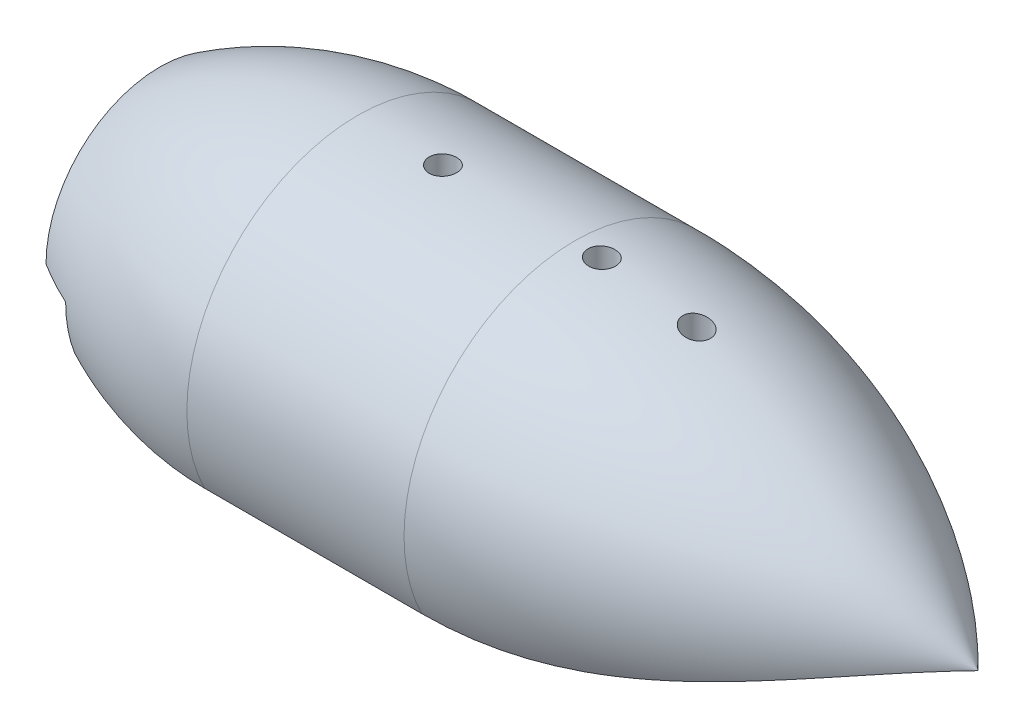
ISO-10303-21;
HEADER;
FILE_DESCRIPTION(('STEP AP214'),'2;1');
FILE_NAME('part.step','',(''),(''),'','','');
FILE_SCHEMA(('AUTOMOTIVE_DESIGN { 1 0 10303 214 1 1 1 1 }'));
ENDSEC;
DATA;
#1=APPLICATION_CONTEXT('core data for automotive mechanical design processes');
#2=APPLICATION_PROTOCOL_DEFINITION('international standard','automotive_design',2000,#1);
#3=PRODUCT_CONTEXT('',#1,'mechanical');
#4=PRODUCT('Part','Part','',(#3));
#5=PRODUCT_RELATED_PRODUCT_CATEGORY('part','',(#4));
#6=PRODUCT_DEFINITION_FORMATION('','',#4);
#7=PRODUCT_DEFINITION_CONTEXT('part definition',#1,'design');
#8=PRODUCT_DEFINITION('design','',#6,#7);
#9=PRODUCT_DEFINITION_SHAPE('','',#8);
#10=(LENGTH_UNIT() NAMED_UNIT(*) SI_UNIT(.MILLI.,.METRE.));
#11=(NAMED_UNIT(*) PLANE_ANGLE_UNIT() SI_UNIT($,.RADIAN.));
#12=(NAMED_UNIT(*) SI_UNIT($,.STERADIAN.) SOLID_ANGLE_UNIT());
#13=UNCERTAINTY_MEASURE_WITH_UNIT(LENGTH_MEASURE(1.E-05),#10,'distance_accuracy_value','');
#14=(GEOMETRIC_REPRESENTATION_CONTEXT(3) GLOBAL_UNCERTAINTY_ASSIGNED_CONTEXT((#13)) GLOBAL_UNIT_ASSIGNED_CONTEXT((#10,
#11,#12)) REPRESENTATION_CONTEXT('',''));
#15=CARTESIAN_POINT('',(0.,0.,0.));
#16=DIRECTION('',(0.,0.,1.));
#17=DIRECTION('',(1.,0.,0.));
#18=AXIS2_PLACEMENT_3D('',#15,#16,#17);
#19=CARTESIAN_POINT('',(24.13,0.,0.));
#20=DIRECTION('',(-1.,0.,0.));
#21=DIRECTION('',(0.,0.,1.));
#22=AXIS2_PLACEMENT_3D('',#19,#20,#21);
#23=CYLINDRICAL_SURFACE('',#22,7.9375);
#24=CARTESIAN_POINT('',(3.302,0.,0.));
#25=DIRECTION('',(1.,0.,0.));
#26=DIRECTION('',(0.,0.,1.));
#27=AXIS2_PLACEMENT_3D('',#24,#25,#26);
#28=CIRCLE('',#27,7.9375);
#29=CARTESIAN_POINT('',(3.302,0.,-7.9375));
#30=VERTEX_POINT('',#29);
#31=CARTESIAN_POINT('',(3.302,0.,7.9375));
#32=VERTEX_POINT('',#31);
#33=EDGE_CURVE('E1108',#30,#32,#28,.T.);
#34=ORIENTED_EDGE('',*,*,#33,.F.);
#35=DIRECTION('',(-1.,0.,0.));
#36=VECTOR('',#35,1.);
#37=CARTESIAN_POINT('',(24.13,0.,-7.9375));
#38=LINE('',#37,#36);
#39=CARTESIAN_POINT('',(10.9132781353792,0.,-7.9375));
#40=VERTEX_POINT('',#39);
#41=EDGE_CURVE('E815',#30,#40,#38,.F.);
#42=ORIENTED_EDGE('',*,*,#41,.T.);
#43=CARTESIAN_POINT('',(10.9132781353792,0.,0.));
#44=DIRECTION('',(1.,0.,0.));
#45=DIRECTION('',(0.,0.,-1.));
#46=AXIS2_PLACEMENT_3D('',#43,#44,#45);
#47=CIRCLE('',#46,7.9375);
#48=CARTESIAN_POINT('',(10.9132781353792,-1.00201309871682,-7.874));
#49=VERTEX_POINT('',#48);
#50=EDGE_CURVE('E504',#40,#49,#47,.F.);
#51=ORIENTED_EDGE('',*,*,#50,.T.);
#52=DIRECTION('',(-1.,0.,0.));
#53=VECTOR('',#52,1.);
#54=CARTESIAN_POINT('',(24.13,-1.00201309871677,-7.874));
#55=LINE('',#54,#53);
#56=CARTESIAN_POINT('',(18.9229985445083,-1.00201309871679,-7.874));
#57=VERTEX_POINT('',#56);
#58=EDGE_CURVE('E835',#49,#57,#55,.F.);
#59=ORIENTED_EDGE('',*,*,#58,.T.);
#60=CARTESIAN_POINT('',(18.9229985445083,0.,0.));
#61=DIRECTION('',(1.,0.,0.));
#62=DIRECTION('',(0.,0.,-1.));
#63=AXIS2_PLACEMENT_3D('',#60,#61,#62);
#64=CIRCLE('',#63,7.9375);
#65=CARTESIAN_POINT('',(18.9229985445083,1.00201309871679,-7.874));
#66=VERTEX_POINT('',#65);
#67=EDGE_CURVE('E901',#66,#57,#64,.F.);
#68=ORIENTED_EDGE('',*,*,#67,.F.);
#69=DIRECTION('',(-1.,0.,0.));
#70=VECTOR('',#69,1.);
#71=CARTESIAN_POINT('',(24.13,1.00201309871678,-7.874));
#72=LINE('',#71,#70);
#73=CARTESIAN_POINT('',(16.5099985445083,1.00201309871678,-7.874));
#74=VERTEX_POINT('',#73);
#75=EDGE_CURVE('E831',#66,#74,#72,.T.);
#76=ORIENTED_EDGE('',*,*,#75,.T.);
#77=CARTESIAN_POINT('',(16.5099985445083,1.00201309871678,-7.874));
#78=CARTESIAN_POINT('',(16.4805623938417,1.00187366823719,-7.87401307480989));
#79=CARTESIAN_POINT('',(16.451390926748,1.00522820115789,-7.87359153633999));
#80=CARTESIAN_POINT('',(16.3948993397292,1.0173830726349,-7.87203223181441));
#81=CARTESIAN_POINT('',(16.3675518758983,1.02605419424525,-7.87091144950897));
#82=CARTESIAN_POINT('',(16.30293734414,1.05212911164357,-7.867474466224));
#83=CARTESIAN_POINT('',(16.2666031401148,1.07169678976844,-7.86484921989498));
#84=CARTESIAN_POINT('',(16.1967752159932,1.11585203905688,-7.8587081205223));
#85=CARTESIAN_POINT('',(16.1633221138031,1.14049861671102,-7.85518166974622));
#86=CARTESIAN_POINT('',(16.074983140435,1.21191107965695,-7.84456834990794));
#87=CARTESIAN_POINT('',(16.0225546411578,1.26154945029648,-7.83677777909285));
#88=CARTESIAN_POINT('',(15.9219246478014,1.36471984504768,-7.8194776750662));
#89=CARTESIAN_POINT('',(15.8737356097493,1.41826254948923,-7.80996331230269));
#90=CARTESIAN_POINT('',(15.7800189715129,1.52759368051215,-7.78931731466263));
#91=CARTESIAN_POINT('',(15.7344992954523,1.58338803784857,-7.7781811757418));
#92=CARTESIAN_POINT('',(15.6454872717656,1.69610975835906,-7.75438201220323));
#93=CARTESIAN_POINT('',(15.6019923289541,1.7530355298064,-7.74172102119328));
#94=CARTESIAN_POINT('',(15.4874008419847,1.906551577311,-7.70575882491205));
#95=CARTESIAN_POINT('',(15.4176308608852,2.00381087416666,-7.68107329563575));
#96=CARTESIAN_POINT('',(15.2810463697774,2.19922926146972,-7.62742364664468));
#97=CARTESIAN_POINT('',(15.2142326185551,2.2973885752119,-7.59845843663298));
#98=CARTESIAN_POINT('',(15.0173110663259,2.59254800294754,-7.50501065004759));
#99=CARTESIAN_POINT('',(14.8908863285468,2.7900031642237,-7.43402801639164));
#100=CARTESIAN_POINT('',(14.6474919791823,3.18304104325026,-7.27441743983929));
#101=CARTESIAN_POINT('',(14.5305060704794,3.37862645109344,-7.18582086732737));
#102=CARTESIAN_POINT('',(14.3071545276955,3.76650188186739,-6.99031281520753));
#103=CARTESIAN_POINT('',(14.2007789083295,3.95879485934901,-6.88341881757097));
#104=CARTESIAN_POINT('',(14.035605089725,4.27266997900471,-6.69099032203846));
#105=CARTESIAN_POINT('',(13.9730995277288,4.39565070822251,-6.61090182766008));
#106=CARTESIAN_POINT('',(13.8545239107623,4.63900831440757,-6.44247173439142));
#107=CARTESIAN_POINT('',(13.7984541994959,4.75938505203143,-6.35412969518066));
#108=CARTESIAN_POINT('',(13.6419011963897,5.11478183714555,-6.07722221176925));
#109=CARTESIAN_POINT('',(13.5524138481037,5.34529622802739,-5.87603248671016));
#110=CARTESIAN_POINT('',(13.4372691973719,5.71454077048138,-5.5128221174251));
#111=CARTESIAN_POINT('',(13.4002971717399,5.85850664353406,-5.35970766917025));
#112=CARTESIAN_POINT('',(13.3619395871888,6.06664060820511,-5.11967704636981));
#113=CARTESIAN_POINT('',(13.3519997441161,6.13492009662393,-5.03766363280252));
#114=CARTESIAN_POINT('',(13.3385280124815,6.26842329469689,-4.87055002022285));
#115=CARTESIAN_POINT('',(13.3350025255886,6.33364388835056,-4.7854468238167));
#116=CARTESIAN_POINT('',(13.3349985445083,6.39713258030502,-4.699));
#117=B_SPLINE_CURVE_WITH_KNOTS('',3,(#77,#78,#79,#80,#81,#82,#83,#84,#85,#86,#87,#88,#89,#90,
#91,#92,#93,#94,#95,#96,#97,#98,#99,#100,#101,#102,#103,#104,#105,#106,#107,#108,#109,#110,#111,
#112,#113,#114,#115,#116),.UNSPECIFIED.,.F.,.F.,(4,2,2,2,2,2,2,2,2,2,2,2,2,2,2,2,2,2,2,4),(0.,
0.087697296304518,0.173343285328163,0.296691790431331,0.421563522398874,0.638834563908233,
0.856724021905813,1.07523057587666,1.29344888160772,1.65994206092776,2.0265287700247,
2.76055177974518,3.49327902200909,4.22531006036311,4.70351002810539,5.18173552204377,
6.13348655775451,6.77194976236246,7.0932255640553,7.41482183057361),.UNSPECIFIED.);
#118=CARTESIAN_POINT('',(13.3349985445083,6.39713258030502,-4.699));
#119=VERTEX_POINT('',#118);
#120=EDGE_CURVE('E528',#74,#119,#117,.T.);
#121=ORIENTED_EDGE('',*,*,#120,.T.);
#122=CARTESIAN_POINT('',(13.3349985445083,0.,0.));
#123=DIRECTION('',(1.,0.,0.));
#124=DIRECTION('',(0.,0.,-1.));
#125=AXIS2_PLACEMENT_3D('',#122,#123,#124);
#126=CIRCLE('',#125,7.9375);
#127=CARTESIAN_POINT('',(13.3349985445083,7.9375,0.));
#128=VERTEX_POINT('',#127);
#129=EDGE_CURVE('E493',#128,#119,#126,.F.);
#130=ORIENTED_EDGE('',*,*,#129,.F.);
#131=CARTESIAN_POINT('',(13.3349985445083,6.39713258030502,4.699));
#132=VERTEX_POINT('',#131);
#133=EDGE_CURVE('E496',#132,#128,#126,.F.);
#134=ORIENTED_EDGE('',*,*,#133,.F.);
#135=CARTESIAN_POINT('',(13.3349985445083,6.39713258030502,4.699));
#136=CARTESIAN_POINT('',(13.3350089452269,6.31655620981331,4.80873725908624));
#137=CARTESIAN_POINT('',(13.3406846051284,6.2331812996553,4.91628571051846));
#138=CARTESIAN_POINT('',(13.3621034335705,6.06169493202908,5.1262062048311));
#139=CARTESIAN_POINT('',(13.3778294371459,5.97359178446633,5.22858675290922));
#140=CARTESIAN_POINT('',(13.4178047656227,5.79452782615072,5.42631768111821));
#141=CARTESIAN_POINT('',(13.4419281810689,5.70362638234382,5.52174802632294));
#142=CARTESIAN_POINT('',(13.4976803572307,5.51833678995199,5.7069281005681));
#143=CARTESIAN_POINT('',(13.5293131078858,5.42394681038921,5.79667477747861));
#144=CARTESIAN_POINT('',(13.6130043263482,5.19410732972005,6.00481628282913));
#145=CARTESIAN_POINT('',(13.6681834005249,5.05725406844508,6.12041420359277));
#146=CARTESIAN_POINT('',(13.7891030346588,4.77901553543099,6.34006031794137));
#147=CARTESIAN_POINT('',(13.8548478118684,4.63762847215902,6.444103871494));
#148=CARTESIAN_POINT('',(13.995848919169,4.34980924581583,6.64182718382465));
#149=CARTESIAN_POINT('',(14.0711993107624,4.20333933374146,6.7353844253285));
#150=CARTESIAN_POINT('',(14.2293454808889,3.90777721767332,6.91105882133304));
#151=CARTESIAN_POINT('',(14.3121369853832,3.75868655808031,6.9931824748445));
#152=CARTESIAN_POINT('',(14.5085530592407,3.41587750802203,7.16815689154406));
#153=CARTESIAN_POINT('',(14.6242564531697,3.2215102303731,7.25743009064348));
#154=CARTESIAN_POINT('',(14.8048385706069,2.92860703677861,7.37823641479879));
#155=CARTESIAN_POINT('',(14.8662972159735,2.83060539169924,7.41636662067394));
#156=CARTESIAN_POINT('',(14.9915123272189,2.63449934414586,7.488272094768));
#157=CARTESIAN_POINT('',(15.0552681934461,2.536394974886,7.52204848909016));
#158=CARTESIAN_POINT('',(15.1844568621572,2.3415578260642,7.58494336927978));
#159=CARTESIAN_POINT('',(15.2498614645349,2.24482238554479,7.61411154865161));
#160=CARTESIAN_POINT('',(15.383514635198,2.05202487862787,7.66832047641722));
#161=CARTESIAN_POINT('',(15.4517657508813,1.95596350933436,7.69335742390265));
#162=CARTESIAN_POINT('',(15.5916333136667,1.7659477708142,7.73917321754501));
#163=CARTESIAN_POINT('',(15.6632326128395,1.67198567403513,7.75997134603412));
#164=CARTESIAN_POINT('',(15.7750033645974,1.53405047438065,7.78799117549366));
#165=CARTESIAN_POINT('',(15.8129588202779,1.48860635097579,7.79679614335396));
#166=CARTESIAN_POINT('',(15.8909141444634,1.39931230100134,7.81331439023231));
#167=CARTESIAN_POINT('',(15.9309129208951,1.35546154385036,7.82102824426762));
#168=CARTESIAN_POINT('',(16.0043140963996,1.2802837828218,7.83363779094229));
#169=CARTESIAN_POINT('',(16.0371049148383,1.2484043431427,7.8387727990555));
#170=CARTESIAN_POINT('',(16.1052402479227,1.18714378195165,7.84828333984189));
#171=CARTESIAN_POINT('',(16.1405897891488,1.15776783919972,7.85265731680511));
#172=CARTESIAN_POINT('',(16.2067638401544,1.10937898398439,7.8596214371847));
#173=CARTESIAN_POINT('',(16.2369210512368,1.08949723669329,7.8623928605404));
#174=CARTESIAN_POINT('',(16.2997068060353,1.05434623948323,7.86718311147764));
#175=CARTESIAN_POINT('',(16.3323146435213,1.03904281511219,7.86920754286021));
#176=CARTESIAN_POINT('',(16.3891309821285,1.01933880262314,7.87178031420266));
#177=CARTESIAN_POINT('',(16.4126371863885,1.01301213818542,7.87259439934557));
#178=CARTESIAN_POINT('',(16.4607126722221,1.0042773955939,7.87371207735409));
#179=CARTESIAN_POINT('',(16.4852924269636,1.0019274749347,7.87400809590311));
#180=CARTESIAN_POINT('',(16.5099985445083,1.00201309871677,7.874));
#181=B_SPLINE_CURVE_WITH_KNOTS('',3,(#135,#136,#137,#138,#139,#140,#141,#142,#143,#144,#145,
#146,#147,#148,#149,#150,#151,#152,#153,#154,#155,#156,#157,#158,#159,#160,#161,#162,#163,#164,
#165,#166,#167,#168,#169,#170,#171,#172,#173,#174,#175,#176,#177,#178,#179,#180),.UNSPECIFIED.,
.F.,.F.,(4,2,2,2,2,2,2,2,2,2,2,2,2,2,2,2,2,2,2,2,2,2,4),(0.,0.40810913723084,0.815523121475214,
1.21707430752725,1.61883932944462,2.18034368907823,2.74207272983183,3.3097994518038,
3.87720214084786,4.60575189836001,4.97107870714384,5.33631083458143,5.69728677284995,
6.05859299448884,6.41821703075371,6.59775998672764,6.77720796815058,6.91518883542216,
7.05344853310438,7.16190292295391,7.26952631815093,7.34227431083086,7.41607728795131),.UNSPECIFIED.);
#182=CARTESIAN_POINT('',(16.5099985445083,1.00201309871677,7.874));
#183=VERTEX_POINT('',#182);
#184=EDGE_CURVE('E521',#132,#183,#181,.T.);
#185=ORIENTED_EDGE('',*,*,#184,.T.);
#186=DIRECTION('',(-1.,0.,0.));
#187=VECTOR('',#186,1.);
#188=CARTESIAN_POINT('',(24.13,1.00201309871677,7.874));
#189=LINE('',#188,#187);
#190=CARTESIAN_POINT('',(18.9229985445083,1.00201309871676,7.874));
#191=VERTEX_POINT('',#190);
#192=EDGE_CURVE('E841',#183,#191,#189,.F.);
#193=ORIENTED_EDGE('',*,*,#192,.T.);
#194=CARTESIAN_POINT('',(18.9229985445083,-1.00201309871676,7.874));
#195=VERTEX_POINT('',#194);
#196=EDGE_CURVE('E404',#195,#191,#64,.F.);
#197=ORIENTED_EDGE('',*,*,#196,.F.);
#198=DIRECTION('',(-1.,0.,0.));
#199=VECTOR('',#198,1.);
#200=CARTESIAN_POINT('',(24.13,-1.00201309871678,7.874));
#201=LINE('',#200,#199);
#202=CARTESIAN_POINT('',(10.9132781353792,-1.00201309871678,7.874));
#203=VERTEX_POINT('',#202);
#204=EDGE_CURVE('E838',#195,#203,#201,.T.);
#205=ORIENTED_EDGE('',*,*,#204,.T.);
#206=CARTESIAN_POINT('',(10.9132781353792,0.,0.));
#207=DIRECTION('',(1.,0.,0.));
#208=DIRECTION('',(0.,0.,-1.));
#209=AXIS2_PLACEMENT_3D('',#206,#207,#208);
#210=CIRCLE('',#209,7.9375);
#211=CARTESIAN_POINT('',(10.9132781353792,0.,7.9375));
#212=VERTEX_POINT('',#211);
#213=EDGE_CURVE('E501',#203,#212,#210,.F.);
#214=ORIENTED_EDGE('',*,*,#213,.T.);
#215=DIRECTION('',(-1.,0.,0.));
#216=VECTOR('',#215,1.);
#217=CARTESIAN_POINT('',(24.13,0.,7.9375));
#218=LINE('',#217,#216);
#219=EDGE_CURVE('E820',#212,#32,#218,.T.);
#220=ORIENTED_EDGE('',*,*,#219,.T.);
#221=EDGE_LOOP('',(#34,#42,#51,#59,#68,#76,#121,#130,#134,#185,#193,#197,#205,#214,#220));
#222=FACE_BOUND('',#221,.T.);
#223=ADVANCED_FACE('F44',(#222),#23,.F.);
#224=CARTESIAN_POINT('',(0.,0.,-7.87400000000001));
#225=DIRECTION('',(0.,1.,0.));
#226=DIRECTION('',(0.,0.,1.));
#227=AXIS2_PLACEMENT_3D('',#224,#225,#226);
#228=PLANE('',#227);
#229=DIRECTION('',(0.,0.,1.));
#230=VECTOR('',#229,1.);
#231=CARTESIAN_POINT('',(3.302,0.,7.9375));
#232=LINE('',#231,#230);
#233=CARTESIAN_POINT('',(3.302,0.,9.3345));
#234=VERTEX_POINT('',#233);
#235=EDGE_CURVE('E1112',#32,#234,#232,.T.);
#236=ORIENTED_EDGE('',*,*,#235,.F.);
#237=ORIENTED_EDGE('',*,*,#219,.F.);
#238=DIRECTION('',(0.,0.,-1.));
#239=VECTOR('',#238,1.);
#240=CARTESIAN_POINT('',(10.9132781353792,0.,12.7041856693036));
#241=LINE('',#240,#239);
#242=CARTESIAN_POINT('',(10.9132781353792,0.,9.52918566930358));
#243=VERTEX_POINT('',#242);
#244=EDGE_CURVE('E1090',#243,#212,#241,.T.);
#245=ORIENTED_EDGE('',*,*,#244,.F.);
#246=CARTESIAN_POINT('',(7.73827813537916,0.,9.52918566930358));
#247=DIRECTION('',(0.,1.,0.));
#248=DIRECTION('',(0.,0.,1.));
#249=AXIS2_PLACEMENT_3D('',#246,#247,#248);
#250=CIRCLE('',#249,3.175);
#251=CARTESIAN_POINT('',(7.73827813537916,0.,12.7041856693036));
#252=VERTEX_POINT('',#251);
#253=EDGE_CURVE('E954',#243,#252,#250,.F.);
#254=ORIENTED_EDGE('',*,*,#253,.T.);
#255=DIRECTION('',(1.,0.,0.));
#256=VECTOR('',#255,1.);
#257=CARTESIAN_POINT('',(0.,0.,12.7041856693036));
#258=LINE('',#257,#256);
#259=CARTESIAN_POINT('',(4.572,0.,12.7041856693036));
#260=VERTEX_POINT('',#259);
#261=EDGE_CURVE('E1093',#260,#252,#258,.T.);
#262=ORIENTED_EDGE('',*,*,#261,.F.);
#263=DIRECTION('',(0.,0.,1.));
#264=VECTOR('',#263,1.);
#265=CARTESIAN_POINT('',(4.572,0.,-20.1886908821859));
#266=LINE('',#265,#264);
#267=CARTESIAN_POINT('',(4.572,0.,14.6609188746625));
#268=VERTEX_POINT('',#267);
#269=EDGE_CURVE('E1148',#260,#268,#266,.T.);
#270=ORIENTED_EDGE('',*,*,#269,.T.);
#271=CARTESIAN_POINT('',(21.1848567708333,0.,-21.5708724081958));
#272=DIRECTION('',(0.,1.,0.));
#273=DIRECTION('',(0.,0.,1.));
#274=AXIS2_PLACEMENT_3D('',#271,#272,#273);
#275=CIRCLE('',#274,39.8588724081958);
#276=CARTESIAN_POINT('',(0.,0.,12.192));
#277=VERTEX_POINT('',#276);
#278=EDGE_CURVE('E1098',#277,#268,#275,.T.);
#279=ORIENTED_EDGE('',*,*,#278,.F.);
#280=DIRECTION('',(0.,0.,1.));
#281=VECTOR('',#280,1.);
#282=CARTESIAN_POINT('',(0.,0.,0.));
#283=LINE('',#282,#281);
#284=CARTESIAN_POINT('',(0.,0.,7.9375));
#285=VERTEX_POINT('',#284);
#286=EDGE_CURVE('E497',#285,#277,#283,.T.);
#287=ORIENTED_EDGE('',*,*,#286,.F.);
#288=CARTESIAN_POINT('',(1.397,0.,7.9375));
#289=VERTEX_POINT('',#288);
#290=EDGE_CURVE('E1102',#289,#285,#218,.T.);
#291=ORIENTED_EDGE('',*,*,#290,.F.);
#292=DIRECTION('',(0.,0.,1.));
#293=VECTOR('',#292,1.);
#294=CARTESIAN_POINT('',(1.397,0.,7.9375));
#295=LINE('',#294,#293);
#296=CARTESIAN_POINT('',(1.397,0.,9.3345));
#297=VERTEX_POINT('',#296);
#298=EDGE_CURVE('E1190',#289,#297,#295,.T.);
#299=ORIENTED_EDGE('',*,*,#298,.T.);
#300=DIRECTION('',(-1.,0.,0.));
#301=VECTOR('',#300,1.);
#302=CARTESIAN_POINT('',(3.302,0.,9.3345));
#303=LINE('',#302,#301);
#304=EDGE_CURVE('E1114',#234,#297,#303,.T.);
#305=ORIENTED_EDGE('',*,*,#304,.F.);
#306=EDGE_LOOP('',(#236,#237,#245,#254,#262,#270,#279,#287,#291,#299,#305));
#307=FACE_BOUND('',#306,.T.);
#308=ADVANCED_FACE('F551',(#307),#228,.F.);
#309=DIRECTION('',(0.,0.,1.));
#310=VECTOR('',#309,1.);
#311=CARTESIAN_POINT('',(3.302,0.,-9.3345));
#312=LINE('',#311,#310);
#313=CARTESIAN_POINT('',(3.302,0.,-9.3345));
#314=VERTEX_POINT('',#313);
#315=EDGE_CURVE('E1119',#314,#30,#312,.T.);
#316=ORIENTED_EDGE('',*,*,#315,.F.);
#317=DIRECTION('',(-1.,0.,0.));
#318=VECTOR('',#317,1.);
#319=CARTESIAN_POINT('',(3.302,0.,-9.3345));
#320=LINE('',#319,#318);
#321=CARTESIAN_POINT('',(1.397,0.,-9.3345));
#322=VERTEX_POINT('',#321);
#323=EDGE_CURVE('E1126',#314,#322,#320,.T.);
#324=ORIENTED_EDGE('',*,*,#323,.T.);
#325=DIRECTION('',(0.,0.,1.));
#326=VECTOR('',#325,1.);
#327=CARTESIAN_POINT('',(1.397,0.,-9.3345));
#328=LINE('',#327,#326);
#329=CARTESIAN_POINT('',(1.397,0.,-7.9375));
#330=VERTEX_POINT('',#329);
#331=EDGE_CURVE('E1121',#322,#330,#328,.T.);
#332=ORIENTED_EDGE('',*,*,#331,.T.);
#333=CARTESIAN_POINT('',(0.,0.,-7.9375));
#334=VERTEX_POINT('',#333);
#335=EDGE_CURVE('E808',#334,#330,#38,.F.);
#336=ORIENTED_EDGE('',*,*,#335,.F.);
#337=CARTESIAN_POINT('',(0.,0.,-12.192));
#338=VERTEX_POINT('',#337);
#339=EDGE_CURVE('E500',#338,#334,#283,.T.);
#340=ORIENTED_EDGE('',*,*,#339,.F.);
#341=CARTESIAN_POINT('',(21.1848567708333,0.,21.5708724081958));
#342=DIRECTION('',(0.,1.,0.));
#343=DIRECTION('',(0.,0.,1.));
#344=AXIS2_PLACEMENT_3D('',#341,#342,#343);
#345=CIRCLE('',#344,39.8588724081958);
#346=CARTESIAN_POINT('',(4.572,0.,-14.6609188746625));
#347=VERTEX_POINT('',#346);
#348=EDGE_CURVE('E1100',#347,#338,#345,.T.);
#349=ORIENTED_EDGE('',*,*,#348,.F.);
#350=CARTESIAN_POINT('',(4.572,0.,-12.8228143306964));
#351=VERTEX_POINT('',#350);
#352=EDGE_CURVE('E1151',#347,#351,#266,.T.);
#353=ORIENTED_EDGE('',*,*,#352,.T.);
#354=DIRECTION('',(-1.,0.,0.));
#355=VECTOR('',#354,1.);
#356=CARTESIAN_POINT('',(0.,0.,-12.8228143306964));
#357=LINE('',#356,#355);
#358=CARTESIAN_POINT('',(7.73827813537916,0.,-12.8228143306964));
#359=VERTEX_POINT('',#358);
#360=EDGE_CURVE('E1089',#359,#351,#357,.T.);
#361=ORIENTED_EDGE('',*,*,#360,.F.);
#362=CARTESIAN_POINT('',(7.73827813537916,0.,-9.64781433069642));
#363=DIRECTION('',(0.,1.,0.));
#364=DIRECTION('',(0.,0.,1.));
#365=AXIS2_PLACEMENT_3D('',#362,#363,#364);
#366=CIRCLE('',#365,3.175);
#367=CARTESIAN_POINT('',(10.9132781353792,0.,-9.64781433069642));
#368=VERTEX_POINT('',#367);
#369=EDGE_CURVE('E960',#359,#368,#366,.F.);
#370=ORIENTED_EDGE('',*,*,#369,.T.);
#371=DIRECTION('',(0.,0.,-1.));
#372=VECTOR('',#371,1.);
#373=CARTESIAN_POINT('',(10.9132781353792,0.,-7.874));
#374=LINE('',#373,#372);
#375=EDGE_CURVE('E1084',#40,#368,#374,.T.);
#376=ORIENTED_EDGE('',*,*,#375,.F.);
#377=ORIENTED_EDGE('',*,*,#41,.F.);
#378=EDGE_LOOP('',(#316,#324,#332,#336,#340,#349,#353,#361,#370,#376,#377));
#379=FACE_BOUND('',#378,.T.);
#380=ADVANCED_FACE('F554',(#379),#228,.F.);
#381=CARTESIAN_POINT('',(42.3417985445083,12.954,-11.8035781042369));
#382=DIRECTION('',(-1.,0.,0.));
#383=DIRECTION('',(0.,0.,1.));
#384=AXIS2_PLACEMENT_3D('',#381,#382,#383);
#385=PLANE('',#384);
#386=CARTESIAN_POINT('',(42.3417985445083,-20.6375,0.));
#387=DIRECTION('',(-1.,0.,0.));
#388=DIRECTION('',(0.,0.,1.));
#389=AXIS2_PLACEMENT_3D('',#386,#387,#388);
#390=CIRCLE('',#389,20.6375);
#391=CARTESIAN_POINT('',(42.3417985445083,-0.244539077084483,-3.16757810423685));
#392=VERTEX_POINT('',#391);
#393=CARTESIAN_POINT('',(42.3417985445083,-2.70601499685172,-10.2160781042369));
#394=VERTEX_POINT('',#393);
#395=EDGE_CURVE('E980',#392,#394,#390,.T.);
#396=ORIENTED_EDGE('',*,*,#395,.F.);
#397=DIRECTION('',(0.,-1.,0.));
#398=VECTOR('',#397,1.);
#399=CARTESIAN_POINT('',(42.3417985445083,10.16,-3.16757810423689));
#400=LINE('',#399,#398);
#401=CARTESIAN_POINT('',(42.3417985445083,10.16,-3.16757810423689));
#402=VERTEX_POINT('',#401);
#403=EDGE_CURVE('E852',#402,#392,#400,.T.);
#404=ORIENTED_EDGE('',*,*,#403,.F.);
#405=DIRECTION('',(0.,-1.,0.));
#406=VECTOR('',#405,1.);
#407=CARTESIAN_POINT('',(42.3417985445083,29.9803841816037,-3.1675781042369));
#408=LINE('',#407,#406);
#409=CARTESIAN_POINT('',(42.3417985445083,12.954,-3.1675781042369));
#410=VERTEX_POINT('',#409);
#411=EDGE_CURVE('E978',#410,#402,#408,.T.);
#412=ORIENTED_EDGE('',*,*,#411,.F.);
#413=DIRECTION('',(0.,0.,-1.));
#414=VECTOR('',#413,1.);
#415=CARTESIAN_POINT('',(42.3417985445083,12.954,-11.8035781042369));
#416=LINE('',#415,#414);
#417=CARTESIAN_POINT('',(42.3417985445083,12.954,-10.2160781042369));
#418=VERTEX_POINT('',#417);
#419=EDGE_CURVE('E880',#410,#418,#416,.T.);
#420=ORIENTED_EDGE('',*,*,#419,.T.);
#421=DIRECTION('',(0.,-1.,0.));
#422=VECTOR('',#421,1.);
#423=CARTESIAN_POINT('',(42.3417985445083,-8.10299076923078,-10.2160781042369));
#424=LINE('',#423,#422);
#425=EDGE_CURVE('E429',#418,#394,#424,.T.);
#426=ORIENTED_EDGE('',*,*,#425,.T.);
#427=EDGE_LOOP('',(#396,#404,#412,#420,#426));
#428=FACE_BOUND('',#427,.T.);
#429=ADVANCED_FACE('F803',(#428),#385,.T.);
#430=CARTESIAN_POINT('',(42.3417985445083,-20.6375,0.));
#431=DIRECTION('',(-1.,0.,0.));
#432=DIRECTION('',(0.,0.,1.));
#433=AXIS2_PLACEMENT_3D('',#430,#431,#432);
#434=CIRCLE('',#433,20.6375);
#435=CARTESIAN_POINT('',(42.3417985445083,-2.71448006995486,10.2309218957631));
#436=VERTEX_POINT('',#435);
#437=CARTESIAN_POINT('',(42.3417985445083,-0.246850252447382,3.1824218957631));
#438=VERTEX_POINT('',#437);
#439=EDGE_CURVE('E992',#436,#438,#434,.T.);
#440=ORIENTED_EDGE('',*,*,#439,.F.);
#441=DIRECTION('',(0.,-1.,0.));
#442=VECTOR('',#441,1.);
#443=CARTESIAN_POINT('',(42.3417985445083,12.954,10.2309218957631));
#444=LINE('',#443,#442);
#445=CARTESIAN_POINT('',(42.3417985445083,12.954,10.2309218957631));
#446=VERTEX_POINT('',#445);
#447=EDGE_CURVE('E422',#436,#446,#444,.F.);
#448=ORIENTED_EDGE('',*,*,#447,.T.);
#449=CARTESIAN_POINT('',(42.3417985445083,12.954,3.18242189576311));
#450=VERTEX_POINT('',#449);
#451=EDGE_CURVE('E881',#446,#450,#416,.T.);
#452=ORIENTED_EDGE('',*,*,#451,.T.);
#453=DIRECTION('',(0.,-1.,0.));
#454=VECTOR('',#453,1.);
#455=CARTESIAN_POINT('',(42.3417985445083,29.9803841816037,3.18242189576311));
#456=LINE('',#455,#454);
#457=CARTESIAN_POINT('',(42.3417985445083,10.16,3.1824218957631));
#458=VERTEX_POINT('',#457);
#459=EDGE_CURVE('E1137',#458,#450,#456,.F.);
#460=ORIENTED_EDGE('',*,*,#459,.F.);
#461=DIRECTION('',(0.,-1.,0.));
#462=VECTOR('',#461,1.);
#463=CARTESIAN_POINT('',(42.3417985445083,10.16,3.1824218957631));
#464=LINE('',#463,#462);
#465=EDGE_CURVE('E849',#458,#438,#464,.T.);
#466=ORIENTED_EDGE('',*,*,#465,.T.);
#467=EDGE_LOOP('',(#440,#448,#452,#460,#466));
#468=FACE_BOUND('',#467,.T.);
#469=ADVANCED_FACE('F794',(#468),#385,.T.);
#470=ORIENTED_EDGE('',*,*,#335,.T.);
#471=CARTESIAN_POINT('',(1.397,0.,0.));
#472=DIRECTION('',(1.,0.,0.));
#473=DIRECTION('',(0.,0.,1.));
#474=AXIS2_PLACEMENT_3D('',#471,#472,#473);
#475=CIRCLE('',#474,7.9375);
#476=EDGE_CURVE('E72',#330,#289,#475,.T.);
#477=ORIENTED_EDGE('',*,*,#476,.T.);
#478=ORIENTED_EDGE('',*,*,#290,.T.);
#479=CARTESIAN_POINT('',(0.,0.,0.));
#480=DIRECTION('',(-1.,0.,0.));
#481=DIRECTION('',(0.,0.,1.));
#482=AXIS2_PLACEMENT_3D('',#479,#480,#481);
#483=CIRCLE('',#482,7.9375);
#484=EDGE_CURVE('E811',#285,#334,#483,.T.);
#485=ORIENTED_EDGE('',*,*,#484,.T.);
#486=EDGE_LOOP('',(#470,#477,#478,#485));
#487=FACE_BOUND('',#486,.T.);
#488=ADVANCED_FACE('F534',(#487),#23,.F.);
#489=CARTESIAN_POINT('',(87.63,0.,0.));
#490=DIRECTION('',(-1.,0.,0.));
#491=DIRECTION('',(0.,0.,1.));
#492=AXIS2_PLACEMENT_3D('',#489,#490,#491);
#493=CYLINDRICAL_SURFACE('',#492,18.288);
#494=CARTESIAN_POINT('',(28.8671172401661,18.288,0.));
#495=CARTESIAN_POINT('',(28.8675370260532,18.2879992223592,-0.082606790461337));
#496=CARTESIAN_POINT('',(28.8749213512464,18.2874343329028,-0.165234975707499));
#497=CARTESIAN_POINT('',(28.9034367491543,18.2852379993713,-0.328135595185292));
#498=CARTESIAN_POINT('',(28.9245834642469,18.2836053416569,-0.408405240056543));
#499=CARTESIAN_POINT('',(28.9800086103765,18.2794607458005,-0.564206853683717));
#500=CARTESIAN_POINT('',(29.0142796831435,18.2769493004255,-0.639741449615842));
#501=CARTESIAN_POINT('',(29.0949680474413,18.2713314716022,-0.783968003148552));
#502=CARTESIAN_POINT('',(29.1413827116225,18.2682252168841,-0.852661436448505));
#503=CARTESIAN_POINT('',(29.2451607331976,18.2617604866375,-0.9814379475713));
#504=CARTESIAN_POINT('',(29.3025470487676,18.2584014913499,-1.04150249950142));
#505=CARTESIAN_POINT('',(29.4265899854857,18.2518164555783,-1.15115832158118));
#506=CARTESIAN_POINT('',(29.493247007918,18.2485904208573,-1.20074913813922));
#507=CARTESIAN_POINT('',(29.6340473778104,18.2426326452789,-1.28810906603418));
#508=CARTESIAN_POINT('',(29.7082004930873,18.2399015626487,-1.32586248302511));
#509=CARTESIAN_POINT('',(29.8618188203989,18.235250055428,-1.38837598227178));
#510=CARTESIAN_POINT('',(29.9412839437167,18.2333296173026,-1.41313628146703));
#511=CARTESIAN_POINT('',(30.1030854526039,18.2305220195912,-1.44890840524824));
#512=CARTESIAN_POINT('',(30.185415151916,18.2296326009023,-1.4599502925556));
#513=CARTESIAN_POINT('',(30.350763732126,18.2289809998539,-1.46806444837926));
#514=CARTESIAN_POINT('',(30.4337826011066,18.2292187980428,-1.46513695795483));
#515=CARTESIAN_POINT('',(30.5979530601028,18.2307925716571,-1.44542088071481));
#516=CARTESIAN_POINT('',(30.6791084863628,18.2321260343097,-1.42866400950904));
#517=CARTESIAN_POINT('',(30.8374513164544,18.2357364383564,-1.38181329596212));
#518=CARTESIAN_POINT('',(30.9146386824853,18.2380133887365,-1.35171932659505));
#519=CARTESIAN_POINT('',(31.0629613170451,18.2432563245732,-1.27900986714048));
#520=CARTESIAN_POINT('',(31.1340891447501,18.2462231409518,-1.23637926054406));
#521=CARTESIAN_POINT('',(31.2681920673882,18.2525092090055,-1.13981788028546));
#522=CARTESIAN_POINT('',(31.3311670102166,18.255828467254,-1.08588689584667));
#523=CARTESIAN_POINT('',(31.4473617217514,18.2624548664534,-0.968074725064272));
#524=CARTESIAN_POINT('',(31.5005535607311,18.2657619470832,-0.904165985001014));
#525=CARTESIAN_POINT('',(31.5954574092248,18.2719801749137,-0.768310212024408));
#526=CARTESIAN_POINT('',(31.6371694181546,18.2748913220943,-0.696363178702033));
#527=CARTESIAN_POINT('',(31.7079243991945,18.2799874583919,-0.546461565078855));
#528=CARTESIAN_POINT('',(31.7369671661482,18.2821724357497,-0.468506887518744));
#529=CARTESIAN_POINT('',(31.7815446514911,18.2855668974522,-0.308806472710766));
#530=CARTESIAN_POINT('',(31.7970796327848,18.2867764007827,-0.227060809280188));
#531=CARTESIAN_POINT('',(31.8141668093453,18.2880786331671,-0.0623442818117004));
#532=CARTESIAN_POINT('',(31.8157580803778,18.2881744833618,0.0206225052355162));
#533=CARTESIAN_POINT('',(31.8050143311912,18.2872439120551,0.185642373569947));
#534=CARTESIAN_POINT('',(31.7926794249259,18.2862174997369,0.267695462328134));
#535=CARTESIAN_POINT('',(31.7544650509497,18.2831569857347,0.428455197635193));
#536=CARTESIAN_POINT('',(31.728602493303,18.281124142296,0.507165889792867));
#537=CARTESIAN_POINT('',(31.6640841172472,18.276276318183,0.659130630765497));
#538=CARTESIAN_POINT('',(31.625428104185,18.2734613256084,0.73238459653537));
#539=CARTESIAN_POINT('',(31.5363181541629,18.2673543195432,0.87153810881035));
#540=CARTESIAN_POINT('',(31.4858377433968,18.2640612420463,0.937420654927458));
#541=CARTESIAN_POINT('',(31.3745512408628,18.2573697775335,1.05979047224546));
#542=CARTESIAN_POINT('',(31.3137449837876,18.2539713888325,1.11627759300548));
#543=CARTESIAN_POINT('',(31.1833657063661,18.2474413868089,1.21838328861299));
#544=CARTESIAN_POINT('',(31.1137730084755,18.2443103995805,1.26397678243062));
#545=CARTESIAN_POINT('',(30.967895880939,18.2386765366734,1.34282973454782));
#546=CARTESIAN_POINT('',(30.8916115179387,18.23617365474,1.3760893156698));
#547=CARTESIAN_POINT('',(30.7346138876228,18.2320817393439,1.42928490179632));
#548=CARTESIAN_POINT('',(30.6539063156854,18.2304915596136,1.44923762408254));
#549=CARTESIAN_POINT('',(30.4902733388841,18.2284004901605,1.47530789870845));
#550=CARTESIAN_POINT('',(30.4073479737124,18.227899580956,1.48142569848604));
#551=CARTESIAN_POINT('',(30.2418870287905,18.2280436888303,1.47965118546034));
#552=CARTESIAN_POINT('',(30.159351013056,18.2286854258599,1.47179897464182));
#553=CARTESIAN_POINT('',(29.9967739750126,18.2310358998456,1.44238991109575));
#554=CARTESIAN_POINT('',(29.9167329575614,18.232744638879,1.42083303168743));
#555=CARTESIAN_POINT('',(29.7614097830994,18.2370366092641,1.36463492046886));
#556=CARTESIAN_POINT('',(29.6861276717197,18.2396198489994,1.32999356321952));
#557=CARTESIAN_POINT('',(29.5424410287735,18.2453709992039,1.24861435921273));
#558=CARTESIAN_POINT('',(29.4740363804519,18.2485388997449,1.20187671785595));
#559=CARTESIAN_POINT('',(29.3458402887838,18.255114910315,1.09747851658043));
#560=CARTESIAN_POINT('',(29.2860731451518,18.2585236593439,1.03978815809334));
#561=CARTESIAN_POINT('',(29.1770469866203,18.2651931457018,0.915176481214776));
#562=CARTESIAN_POINT('',(29.127790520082,18.2684538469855,0.848252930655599));
#563=CARTESIAN_POINT('',(29.0411239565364,18.2744675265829,0.706955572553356));
#564=CARTESIAN_POINT('',(29.0037346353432,18.2772196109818,0.632568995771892));
#565=CARTESIAN_POINT('',(28.9420246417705,18.2818979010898,0.478602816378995));
#566=CARTESIAN_POINT('',(28.917688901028,18.2838250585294,0.399029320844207));
#567=CARTESIAN_POINT('',(28.8889516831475,18.2861429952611,0.26582011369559));
#568=CARTESIAN_POINT('',(28.8805390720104,18.2868364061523,0.213020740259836));
#569=CARTESIAN_POINT('',(28.8694861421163,18.2877651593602,0.106817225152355));
#570=CARTESIAN_POINT('',(28.8668458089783,18.2880005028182,0.0534130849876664));
#571=CARTESIAN_POINT('',(28.8671172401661,18.288,0.));
#572=B_SPLINE_CURVE_WITH_KNOTS('',3,(#494,#495,#496,#497,#498,#499,#500,#501,#502,#503,#504,
#505,#506,#507,#508,#509,#510,#511,#512,#513,#514,#515,#516,#517,#518,#519,#520,#521,#522,#523,
#524,#525,#526,#527,#528,#529,#530,#531,#532,#533,#534,#535,#536,#537,#538,#539,#540,#541,#542,
#543,#544,#545,#546,#547,#548,#549,#550,#551,#552,#553,#554,#555,#556,#557,#558,#559,#560,#561,
#562,#563,#564,#565,#566,#567,#568,#569,#570,#571),.UNSPECIFIED.,.T.,.F.,(4,2,2,2,2,2,2,2,2,2,2,
2,2,2,2,2,2,2,2,2,2,2,2,2,2,2,2,2,2,2,2,2,2,2,2,2,2,2,4),(0.,0.247628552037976,
0.495539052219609,0.743310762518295,0.991028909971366,1.23927119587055,1.4875242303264,
1.73610502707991,1.98468167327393,2.23271261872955,2.48073928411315,2.72819871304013,
2.9756604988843,3.22342190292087,3.47118792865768,3.71965067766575,3.9681134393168,
4.21658022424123,4.46504217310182,4.71280761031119,4.96057102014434,5.20802545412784,
5.45548365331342,5.70350127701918,5.95152287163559,6.20011011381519,6.44869488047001,
6.69696676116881,6.94523420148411,7.19279012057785,7.44034652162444,7.68790529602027,
7.93545986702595,8.18369785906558,8.43199596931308,8.68072640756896,8.92916910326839,
9.08928472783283,9.24939995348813),.UNSPECIFIED.);
#573=CARTESIAN_POINT('',(28.8671172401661,18.288,0.));
#574=VERTEX_POINT('',#573);
#575=EDGE_CURVE('E759',#574,#574,#572,.T.);
#576=ORIENTED_EDGE('',*,*,#575,.T.);
#577=EDGE_LOOP('',(#576));
#578=FACE_BOUND('',#577,.T.);
#579=CARTESIAN_POINT('',(44.45,0.,0.));
#580=DIRECTION('',(-1.,0.,0.));
#581=DIRECTION('',(0.,0.,1.));
#582=AXIS2_PLACEMENT_3D('',#579,#580,#581);
#583=CIRCLE('',#582,18.288);
#584=CARTESIAN_POINT('',(44.4499999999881,-8.10299076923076,16.3948920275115));
#585=VERTEX_POINT('',#584);
#586=CARTESIAN_POINT('',(44.4500000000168,-8.10299076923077,-16.3948920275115));
#587=VERTEX_POINT('',#586);
#588=EDGE_CURVE('E419',#585,#587,#583,.T.);
#589=ORIENTED_EDGE('',*,*,#588,.T.);
#590=DIRECTION('',(-1.,0.,0.));
#591=VECTOR('',#590,1.);
#592=CARTESIAN_POINT('',(87.63,-8.10299076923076,-16.3948920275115));
#593=LINE('',#592,#591);
#594=CARTESIAN_POINT('',(21.1848567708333,-8.10299076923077,-16.3948920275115));
#595=VERTEX_POINT('',#594);
#596=EDGE_CURVE('E403',#587,#595,#593,.T.);
#597=ORIENTED_EDGE('',*,*,#596,.T.);
#598=CARTESIAN_POINT('',(21.1848567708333,0.,0.));
#599=DIRECTION('',(-1.,0.,0.));
#600=DIRECTION('',(0.,0.,1.));
#601=AXIS2_PLACEMENT_3D('',#598,#599,#600);
#602=CIRCLE('',#601,18.288);
#603=CARTESIAN_POINT('',(21.1848567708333,-8.10299076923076,16.3948920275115));
#604=VERTEX_POINT('',#603);
#605=EDGE_CURVE('E411',#604,#595,#602,.T.);
#606=ORIENTED_EDGE('',*,*,#605,.F.);
#607=DIRECTION('',(-1.,0.,0.));
#608=VECTOR('',#607,1.);
#609=CARTESIAN_POINT('',(87.63,-8.10299076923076,16.3948920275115));
#610=LINE('',#609,#608);
#611=EDGE_CURVE('E392',#585,#604,#610,.T.);
#612=ORIENTED_EDGE('',*,*,#611,.F.);
#613=EDGE_LOOP('',(#589,#597,#606,#612));
#614=FACE_BOUND('',#613,.T.);
#615=ADVANCED_FACE('F46',(#578,#614),#493,.T.);
#616=CARTESIAN_POINT('',(21.1848567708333,0.,0.));
#617=DIRECTION('',(-1.,0.,0.));
#618=DIRECTION('',(0.,0.,1.));
#619=AXIS2_PLACEMENT_3D('',#616,#617,#618);
#620=DEGENERATE_TOROIDAL_SURFACE('',#619,21.5708724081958,39.8588724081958,.F.);
#621=ORIENTED_EDGE('',*,*,#605,.T.);
#622=CARTESIAN_POINT('',(21.1850567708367,-8.10299076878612,-16.3948920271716));
#623=CARTESIAN_POINT('',(20.6671886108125,-8.10303417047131,-16.3948759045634));
#624=CARTESIAN_POINT('',(20.1493251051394,-8.09405320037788,-16.3880573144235));
#625=CARTESIAN_POINT('',(19.1145920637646,-8.05833935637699,-16.3606864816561));
#626=CARTESIAN_POINT('',(18.5977224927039,-8.03160712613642,-16.3401347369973));
#627=CARTESIAN_POINT('',(17.5661612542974,-7.96070384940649,-16.2851815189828));
#628=CARTESIAN_POINT('',(17.0514686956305,-7.91654081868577,-16.250786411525));
#629=CARTESIAN_POINT('',(16.0249522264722,-7.81135314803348,-16.1678964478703));
#630=CARTESIAN_POINT('',(15.5131283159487,-7.75032850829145,-16.1194015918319));
#631=CARTESIAN_POINT('',(14.5048709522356,-7.61376353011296,-16.0092535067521));
#632=CARTESIAN_POINT('',(14.0083526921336,-7.53858593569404,-15.9479255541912));
#633=CARTESIAN_POINT('',(13.0196861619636,-7.37376714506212,-15.811112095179));
#634=CARTESIAN_POINT('',(12.5275379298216,-7.2841258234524,-15.7356264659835));
#635=CARTESIAN_POINT('',(11.5483562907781,-7.09144187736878,-15.5700625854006));
#636=CARTESIAN_POINT('',(11.0613227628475,-6.98839957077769,-15.4799846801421));
#637=CARTESIAN_POINT('',(10.0930765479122,-6.77013445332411,-15.2847634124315));
#638=CARTESIAN_POINT('',(9.61186371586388,-6.65491194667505,-15.1796204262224));
#639=CARTESIAN_POINT('',(8.33719469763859,-6.33316764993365,-14.8784566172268));
#640=CARTESIAN_POINT('',(7.5493842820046,-6.11697749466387,-14.6685711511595));
#641=CARTESIAN_POINT('',(5.99447100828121,-5.66139207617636,-14.2031177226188));
#642=CARTESIAN_POINT('',(5.22736493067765,-5.42200044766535,-13.9475569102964));
#643=CARTESIAN_POINT('',(3.70112246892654,-4.92278888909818,-13.3827878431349));
#644=CARTESIAN_POINT('',(2.94243741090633,-4.66266040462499,-13.0726257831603));
#645=CARTESIAN_POINT('',(1.82400923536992,-4.2670145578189,-12.5681856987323));
#646=CARTESIAN_POINT('',(1.45438282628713,-4.13419226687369,-12.3934610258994));
#647=CARTESIAN_POINT('',(0.72193076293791,-3.86790924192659,-12.0307042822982));
#648=CARTESIAN_POINT('',(0.35910543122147,-3.73444847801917,-11.8426715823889));
#649=CARTESIAN_POINT('',(-0.000200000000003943,-3.60125509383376,-11.6478652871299));
#650=B_SPLINE_CURVE_WITH_KNOTS('',3,(#622,#623,#624,#625,#626,#627,#628,#629,#630,#631,#632,
#633,#634,#635,#636,#637,#638,#639,#640,#641,#642,#643,#644,#645,#646,#647,#648,#649),
.UNSPECIFIED.,.F.,.F.,(4,2,2,2,2,2,2,2,2,2,2,2,2,4),(0.,1.55347422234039,3.10689211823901,
4.65959648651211,6.21230083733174,7.72959787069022,9.24690805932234,10.764182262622,
12.2814185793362,14.8098492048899,17.3378843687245,19.9154975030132,21.2049032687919,
22.4943700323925),.UNSPECIFIED.);
#651=CARTESIAN_POINT('',(4.572,-5.20757219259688,-13.7048799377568));
#652=VERTEX_POINT('',#651);
#653=EDGE_CURVE('E717',#595,#652,#650,.T.);
#654=ORIENTED_EDGE('',*,*,#653,.T.);
#655=CARTESIAN_POINT('',(4.572,0.,0.));
#656=DIRECTION('',(1.,0.,0.));
#657=DIRECTION('',(0.,1.,0.));
#658=AXIS2_PLACEMENT_3D('',#655,#656,#657);
#659=CIRCLE('',#658,14.6609188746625);
#660=EDGE_CURVE('E1154',#652,#347,#659,.T.);
#661=ORIENTED_EDGE('',*,*,#660,.T.);
#662=ORIENTED_EDGE('',*,*,#348,.T.);
#663=CARTESIAN_POINT('',(0.,0.,0.));
#664=DIRECTION('',(-1.,0.,0.));
#665=DIRECTION('',(0.,0.,1.));
#666=AXIS2_PLACEMENT_3D('',#663,#664,#665);
#667=CIRCLE('',#666,12.192);
#668=EDGE_CURVE('E418',#277,#338,#667,.T.);
#669=ORIENTED_EDGE('',*,*,#668,.F.);
#670=ORIENTED_EDGE('',*,*,#278,.T.);
#671=CARTESIAN_POINT('',(4.572,-5.20757219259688,13.7048799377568));
#672=VERTEX_POINT('',#671);
#673=EDGE_CURVE('E413',#268,#672,#659,.T.);
#674=ORIENTED_EDGE('',*,*,#673,.T.);
#675=CARTESIAN_POINT('',(-0.00020000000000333,-3.60125509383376,11.6478652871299));
#676=CARTESIAN_POINT('',(0.453051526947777,-3.76928702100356,11.8936211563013));
#677=CARTESIAN_POINT('',(0.911956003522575,-3.93774283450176,12.1286012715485));
#678=CARTESIAN_POINT('',(1.84046397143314,-4.27314456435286,12.5774725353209));
#679=CARTESIAN_POINT('',(2.31006668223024,-4.44009058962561,12.7913652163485));
#680=CARTESIAN_POINT('',(3.25944406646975,-4.77014497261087,13.1985656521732));
#681=CARTESIAN_POINT('',(3.73921903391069,-4.93325321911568,13.3918728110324));
#682=CARTESIAN_POINT('',(4.70834274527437,-5.25341667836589,13.758474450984));
#683=CARTESIAN_POINT('',(5.19769157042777,-5.41047183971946,13.9317687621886));
#684=CARTESIAN_POINT('',(6.17329840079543,-5.71269179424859,14.2549731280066));
#685=CARTESIAN_POINT('',(6.6593408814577,-5.85805312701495,14.4053502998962));
#686=CARTESIAN_POINT('',(7.6393358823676,-6.13916933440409,14.6882463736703));
#687=CARTESIAN_POINT('',(8.13328838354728,-6.27492423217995,14.8207653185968));
#688=CARTESIAN_POINT('',(9.12834018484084,-6.53507999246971,15.0685244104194));
#689=CARTESIAN_POINT('',(9.62943779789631,-6.65948348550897,15.1837685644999));
#690=CARTESIAN_POINT('',(10.6381419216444,-6.89538671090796,15.3975987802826));
#691=CARTESIAN_POINT('',(11.1457481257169,-7.00688704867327,15.4961856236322));
#692=CARTESIAN_POINT('',(12.4247685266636,-7.26828544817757,15.7230380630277));
#693=CARTESIAN_POINT('',(13.199883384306,-7.40911808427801,15.8411296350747));
#694=CARTESIAN_POINT('',(14.7602756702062,-7.65411607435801,16.0425488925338));
#695=CARTESIAN_POINT('',(15.5455514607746,-7.7582872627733,16.1258821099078));
#696=CARTESIAN_POINT('',(16.7359646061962,-7.88553855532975,16.226421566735));
#697=CARTESIAN_POINT('',(17.1385645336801,-7.92332771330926,16.2560113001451));
#698=CARTESIAN_POINT('',(17.9451680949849,-7.98833056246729,16.3066440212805));
#699=CARTESIAN_POINT('',(18.3491717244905,-8.01554428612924,16.3276870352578));
#700=CARTESIAN_POINT('',(19.1582501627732,-8.05917841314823,16.3613271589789));
#701=CARTESIAN_POINT('',(19.563325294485,-8.07559506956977,16.3739213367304));
#702=CARTESIAN_POINT('',(20.3739514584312,-8.09750978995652,16.3907011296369));
#703=CARTESIAN_POINT('',(20.7795024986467,-8.10300766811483,16.3948866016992));
#704=CARTESIAN_POINT('',(21.1850567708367,-8.10299076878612,16.3948920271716));
#705=B_SPLINE_CURVE_WITH_KNOTS('',3,(#675,#676,#677,#678,#679,#680,#681,#682,#683,#684,#685,
#686,#687,#688,#689,#690,#691,#692,#693,#694,#695,#696,#697,#698,#699,#700,#701,#702,#703,#704),
.UNSPECIFIED.,.F.,.F.,(4,2,2,2,2,2,2,2,2,2,2,2,2,2,4),(0.,1.626665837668,3.25321337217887,
4.87980798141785,6.50641639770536,8.09336673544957,9.680313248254,11.2668910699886,
12.8533944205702,15.2415285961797,17.6292825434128,18.8454417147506,20.0615971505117,
21.2781744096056,22.4947723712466),.UNSPECIFIED.);
#706=EDGE_CURVE('E395',#672,#604,#705,.T.);
#707=ORIENTED_EDGE('',*,*,#706,.T.);
#708=EDGE_LOOP('',(#621,#654,#661,#662,#669,#670,#674,#707));
#709=FACE_BOUND('',#708,.T.);
#710=ADVANCED_FACE('F409',(#709),#620,.F.);
#711=CARTESIAN_POINT('',(0.,0.,0.));
#712=DIRECTION('',(1.,0.,0.));
#713=DIRECTION('',(0.,0.,-1.));
#714=AXIS2_PLACEMENT_3D('',#711,#712,#713);
#715=PLANE('',#714);
#716=ORIENTED_EDGE('',*,*,#668,.T.);
#717=ORIENTED_EDGE('',*,*,#339,.T.);
#718=ORIENTED_EDGE('',*,*,#484,.F.);
#719=ORIENTED_EDGE('',*,*,#286,.T.);
#720=EDGE_LOOP('',(#716,#717,#718,#719));
#721=FACE_BOUND('',#720,.T.);
#722=ADVANCED_FACE('F737',(#721),#715,.F.);
#723=CARTESIAN_POINT('',(44.45,0.,0.));
#724=DIRECTION('',(-1.,0.,0.));
#725=DIRECTION('',(0.,0.,1.));
#726=AXIS2_PLACEMENT_3D('',#723,#724,#725);
#727=DEGENERATE_TOROIDAL_SURFACE('',#726,41.8524678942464,60.1404678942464,.F.);
#728=CARTESIAN_POINT('',(87.6302,-1.77798033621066E-06,0.00856657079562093));
#729=CARTESIAN_POINT('',(87.6278861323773,-2.7687325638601E-06,0.0109533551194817));
#730=CARTESIAN_POINT('',(87.6255720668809,-4.17345732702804E-06,0.0133399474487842));
#731=CARTESIAN_POINT('',(87.6140007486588,-1.32659593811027E-05,0.0252719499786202));
#732=CARTESIAN_POINT('',(87.6047405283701,-2.71603699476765E-05,0.034814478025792));
#733=CARTESIAN_POINT('',(87.5584235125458,-0.000129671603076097,0.0825118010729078));
#734=CARTESIAN_POINT('',(87.5213192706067,-0.000317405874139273,0.120620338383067));
#735=CARTESIAN_POINT('',(87.3355395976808,-0.00178062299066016,0.310919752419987));
#736=CARTESIAN_POINT('',(87.1861074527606,-0.00462973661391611,0.462361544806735));
#737=CARTESIAN_POINT('',(86.7352166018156,-0.0180617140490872,0.914379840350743));
#738=CARTESIAN_POINT('',(86.4313615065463,-0.0335319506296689,1.21244192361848));
#739=CARTESIAN_POINT('',(85.8174479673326,-0.0766415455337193,1.8013072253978));
#740=CARTESIAN_POINT('',(85.5073880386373,-0.104283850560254,2.09210866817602));
#741=CARTESIAN_POINT('',(84.5626869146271,-0.20476098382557,2.95788367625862));
#742=CARTESIAN_POINT('',(83.9188146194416,-0.294960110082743,3.52091037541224));
#743=CARTESIAN_POINT('',(82.6081751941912,-0.51422013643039,4.61192780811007));
#744=CARTESIAN_POINT('',(81.9413988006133,-0.643296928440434,5.13990410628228));
#745=CARTESIAN_POINT('',(80.5854184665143,-0.933413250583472,6.15927334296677));
#746=CARTESIAN_POINT('',(79.8961788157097,-1.09450597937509,6.65060349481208));
#747=CARTESIAN_POINT('',(78.4976645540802,-1.44153436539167,7.59434753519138));
#748=CARTESIAN_POINT('',(77.788389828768,-1.62747016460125,8.04676120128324));
#749=CARTESIAN_POINT('',(76.4586590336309,-1.98825633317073,8.84731423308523));
#750=CARTESIAN_POINT('',(75.8408004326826,-2.16059981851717,9.20092515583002));
#751=CARTESIAN_POINT('',(74.5921156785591,-2.51444541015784,9.87966539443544));
#752=CARTESIAN_POINT('',(73.9612881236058,-2.69594850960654,10.2047916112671));
#753=CARTESIAN_POINT('',(72.687144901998,-3.06437797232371,10.8269365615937));
#754=CARTESIAN_POINT('',(72.0438240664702,-3.25130659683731,11.1239433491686));
#755=CARTESIAN_POINT('',(70.7455845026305,-3.62690516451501,11.690231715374));
#756=CARTESIAN_POINT('',(70.0906654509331,-3.81557515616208,11.9595125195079));
#757=CARTESIAN_POINT('',(68.7685644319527,-4.19160247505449,12.4715664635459));
#758=CARTESIAN_POINT('',(68.1013604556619,-4.3789564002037,12.7142852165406));
#759=CARTESIAN_POINT('',(66.7566259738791,-4.74871740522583,13.1734540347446));
#760=CARTESIAN_POINT('',(66.0790954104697,-4.93112445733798,13.3899039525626));
#761=CARTESIAN_POINT('',(64.7144905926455,-5.28791698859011,13.7974656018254));
#762=CARTESIAN_POINT('',(64.0274177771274,-5.46230366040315,13.9885811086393));
#763=CARTESIAN_POINT('',(62.6443469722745,-5.80025144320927,14.3465344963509));
#764=CARTESIAN_POINT('',(61.9483489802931,-5.96381255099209,14.5133723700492));
#765=CARTESIAN_POINT('',(60.5098911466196,-6.28608090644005,14.8323081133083));
#766=CARTESIAN_POINT('',(59.7669722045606,-6.44403335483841,14.9831006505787));
#767=CARTESIAN_POINT('',(58.2730211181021,-6.74222507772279,15.2600510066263));
#768=CARTESIAN_POINT('',(57.5219888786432,-6.88246414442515,15.3862085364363));
#769=CARTESIAN_POINT('',(56.0127256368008,-7.14280949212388,15.6150501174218));
#770=CARTESIAN_POINT('',(55.2544932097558,-7.26291169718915,15.7177294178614));
#771=CARTESIAN_POINT('',(53.7321466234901,-7.48085354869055,15.9006071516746));
#772=CARTESIAN_POINT('',(52.9680325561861,-7.57869354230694,15.9808059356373));
#773=CARTESIAN_POINT('',(51.4371856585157,-7.75017737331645,16.1194122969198));
#774=CARTESIAN_POINT('',(50.6704650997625,-7.82388452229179,16.1778769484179));
#775=CARTESIAN_POINT('',(49.1336809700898,-7.94617349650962,16.2739883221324));
#776=CARTESIAN_POINT('',(48.3636172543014,-7.99475422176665,16.3116341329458));
#777=CARTESIAN_POINT('',(46.8220281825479,-8.06591511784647,16.3665413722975));
#778=CARTESIAN_POINT('',(46.0505039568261,-8.08851061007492,16.3838148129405));
#779=CARTESIAN_POINT('',(44.5070336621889,-8.10735136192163,16.3982299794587));
#780=CARTESIAN_POINT('',(43.7350876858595,-8.10360104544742,16.395375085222));
#781=CARTESIAN_POINT('',(42.7711261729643,-8.08250733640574,16.3792115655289));
#782=CARTESIAN_POINT('',(42.5786102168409,-8.07747587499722,16.3753549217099));
#783=CARTESIAN_POINT('',(42.1936756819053,-8.06578528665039,16.3663818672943));
#784=CARTESIAN_POINT('',(42.0012570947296,-8.05912633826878,16.361265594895));
#785=CARTESIAN_POINT('',(41.6166362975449,-8.04419153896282,16.3497729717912));
#786=CARTESIAN_POINT('',(41.42443402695,-8.03591665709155,16.3433973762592));
#787=CARTESIAN_POINT('',(41.040130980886,-8.01775598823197,16.3293783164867));
#788=CARTESIAN_POINT('',(40.8480302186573,-8.00787002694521,16.3217347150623));
#789=CARTESIAN_POINT('',(40.6560011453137,-7.99718368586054,16.3134548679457));
#790=B_SPLINE_CURVE_WITH_KNOTS('',3,(#728,#729,#730,#731,#732,#733,#734,#735,#736,#737,#738,
#739,#740,#741,#742,#743,#744,#745,#746,#747,#748,#749,#750,#751,#752,#753,#754,#755,#756,#757,
#758,#759,#760,#761,#762,#763,#764,#765,#766,#767,#768,#769,#770,#771,#772,#773,#774,#775,#776,
#777,#778,#779,#780,#781,#782,#783,#784,#785,#786,#787,#788,#789),.UNSPECIFIED.,.F.,.F.,(4,2,2,
2,2,2,2,2,2,2,2,2,2,2,2,2,2,2,2,2,2,2,2,2,2,2,2,2,2,2,4),(0.,0.00997278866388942,
0.0498639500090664,0.209429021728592,0.847716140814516,2.12515000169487,3.40289328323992,
5.98083775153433,8.55983743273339,11.1431588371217,13.7264950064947,15.9231327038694,
18.1200090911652,20.3178146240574,22.5156815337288,24.7179676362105,26.9202660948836,
29.1222359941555,31.3242065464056,33.6466155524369,35.9690517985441,38.2919575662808,
40.6148271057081,42.9315529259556,45.2483801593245,47.5638406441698,49.8789123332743,
50.4567683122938,51.0345609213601,51.6120080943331,52.1895177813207),.UNSPECIFIED.);
#791=CARTESIAN_POINT('',(87.63,-1.86464672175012E-06,0.00877287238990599));
#792=VERTEX_POINT('',#791);
#793=EDGE_CURVE('E398',#792,#585,#790,.T.);
#794=ORIENTED_EDGE('',*,*,#793,.F.);
#795=CARTESIAN_POINT('',(87.63,0.,0.));
#796=DIRECTION('',(-1.,0.,0.));
#797=DIRECTION('',(0.,0.,1.));
#798=AXIS2_PLACEMENT_3D('',#795,#796,#797);
#799=CIRCLE('',#798,0.00877287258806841);
#800=CARTESIAN_POINT('',(87.63,-1.86464672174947E-06,-0.00877287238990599));
#801=VERTEX_POINT('',#800);
#802=EDGE_CURVE('E424',#792,#801,#799,.T.);
#803=ORIENTED_EDGE('',*,*,#802,.T.);
#804=CARTESIAN_POINT('',(40.6560011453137,-7.99718368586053,-16.3134548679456));
#805=CARTESIAN_POINT('',(41.0178100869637,-8.01732028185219,-16.3290537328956));
#806=CARTESIAN_POINT('',(41.3798648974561,-8.03461139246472,-16.3423962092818));
#807=CARTESIAN_POINT('',(42.1043391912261,-8.06345003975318,-16.3645967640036));
#808=CARTESIAN_POINT('',(42.4667586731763,-8.07499759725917,-16.3734548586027));
#809=CARTESIAN_POINT('',(43.5543319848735,-8.10094513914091,-16.3933444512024));
#810=CARTESIAN_POINT('',(44.2798461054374,-8.10665253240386,-16.3976932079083));
#811=CARTESIAN_POINT('',(45.7302083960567,-8.09479011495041,-16.3886201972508));
#812=CARTESIAN_POINT('',(46.4550567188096,-8.07723128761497,-16.3752068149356));
#813=CARTESIAN_POINT('',(47.9032819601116,-8.01913000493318,-16.3304773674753));
#814=CARTESIAN_POINT('',(48.6266588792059,-7.97858755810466,-16.2991613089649));
#815=CARTESIAN_POINT('',(50.0691239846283,-7.87526322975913,-16.2183846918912));
#816=CARTESIAN_POINT('',(50.7882182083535,-7.81253271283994,-16.1689660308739));
#817=CARTESIAN_POINT('',(52.2227012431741,-7.66577671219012,-16.0514681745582));
#818=CARTESIAN_POINT('',(52.9380900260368,-7.58175106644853,-15.9833888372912));
#819=CARTESIAN_POINT('',(54.3641897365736,-7.39367779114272,-15.8279013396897));
#820=CARTESIAN_POINT('',(55.0749001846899,-7.28962814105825,-15.7404912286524));
#821=CARTESIAN_POINT('',(56.4906018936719,-7.06309660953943,-15.5455555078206));
#822=CARTESIAN_POINT('',(57.1955930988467,-6.9406145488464,-15.4380297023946));
#823=CARTESIAN_POINT('',(58.646181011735,-6.67027772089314,-15.1940271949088));
#824=CARTESIAN_POINT('',(59.3913175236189,-6.52127015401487,-15.0560891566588));
#825=CARTESIAN_POINT('',(60.8730409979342,-6.20696445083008,-14.7551136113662));
#826=CARTESIAN_POINT('',(61.6096278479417,-6.04166610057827,-14.5920757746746));
#827=CARTESIAN_POINT('',(63.0733632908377,-5.69766687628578,-14.2396775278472));
#828=CARTESIAN_POINT('',(63.8005113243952,-5.5189652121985,-14.0503155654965));
#829=CARTESIAN_POINT('',(65.2444631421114,-5.15135061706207,-13.644068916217));
#830=CARTESIAN_POINT('',(65.9612669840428,-4.96243774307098,-13.4271843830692));
#831=CARTESIAN_POINT('',(67.3812974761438,-4.5785060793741,-12.9655287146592));
#832=CARTESIAN_POINT('',(68.0845621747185,-4.38351038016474,-12.7208554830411));
#833=CARTESIAN_POINT('',(69.4792677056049,-3.99046278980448,-12.2019866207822));
#834=CARTESIAN_POINT('',(70.1707084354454,-3.79241087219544,-11.9277907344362));
#835=CARTESIAN_POINT('',(71.5410328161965,-3.39714972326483,-11.3489883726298));
#836=CARTESIAN_POINT('',(72.2199160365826,-3.1999405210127,-11.0443808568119));
#837=CARTESIAN_POINT('',(73.5643364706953,-2.81051020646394,-10.4040967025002));
#838=CARTESIAN_POINT('',(74.229874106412,-2.61828893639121,-10.0684210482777));
#839=CARTESIAN_POINT('',(75.4658927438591,-2.26624754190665,-9.40880122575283));
#840=CARTESIAN_POINT('',(76.0380036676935,-2.10534870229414,-9.08848542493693));
#841=CARTESIAN_POINT('',(77.1708170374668,-1.79382089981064,-8.42359403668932));
#842=CARTESIAN_POINT('',(77.7315197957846,-1.64319165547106,-8.07901911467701));
#843=CARTESIAN_POINT('',(78.8405687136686,-1.35549218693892,-7.36602042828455));
#844=CARTESIAN_POINT('',(79.3889231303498,-1.21841268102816,-6.99761327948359));
#845=CARTESIAN_POINT('',(80.4730408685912,-0.960992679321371,-6.23719328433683));
#846=CARTESIAN_POINT('',(81.0088047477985,-0.840651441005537,-5.84518148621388));
#847=CARTESIAN_POINT('',(82.0740330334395,-0.61863987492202,-5.03300753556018));
#848=CARTESIAN_POINT('',(82.6033237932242,-0.517233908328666,-4.61254460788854));
#849=CARTESIAN_POINT('',(83.6475551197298,-0.338654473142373,-3.74933562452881));
#850=CARTESIAN_POINT('',(84.162497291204,-0.26147828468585,-3.30659207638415));
#851=CARTESIAN_POINT('',(85.1788927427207,-0.134765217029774,-2.39892224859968));
#852=CARTESIAN_POINT('',(85.6803008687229,-0.0853120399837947,-1.93393334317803));
#853=CARTESIAN_POINT('',(86.4204940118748,-0.034850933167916,-1.22224367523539));
#854=CARTESIAN_POINT('',(86.6653031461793,-0.0219834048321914,-0.982579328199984));
#855=CARTESIAN_POINT('',(87.1508381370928,-0.00460960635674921,-0.498820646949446));
#856=CARTESIAN_POINT('',(87.3915637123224,-0.000103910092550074,-0.254726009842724));
#857=CARTESIAN_POINT('',(87.6302,-1.77798033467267E-06,-0.00856657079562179));
#858=B_SPLINE_CURVE_WITH_KNOTS('',3,(#804,#805,#806,#807,#808,#809,#810,#811,#812,#813,#814,
#815,#816,#817,#818,#819,#820,#821,#822,#823,#824,#825,#826,#827,#828,#829,#830,#831,#832,#833,
#834,#835,#836,#837,#838,#839,#840,#841,#842,#843,#844,#845,#846,#847,#848,#849,#850,#851,#852,
#853,#854,#855,#856,#857),.UNSPECIFIED.,.F.,.F.,(4,2,2,2,2,2,2,2,2,2,2,2,2,2,2,2,2,2,2,2,2,2,2,
2,2,2,4),(0.,1.08807538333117,2.17614682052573,4.35215318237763,6.52713267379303,
8.70211135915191,10.8720876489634,13.0420804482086,15.2122923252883,17.3825253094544,
19.6988084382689,22.0151219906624,24.3315721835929,26.6480094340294,28.9565248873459,
31.2650603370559,33.5736747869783,35.8822161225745,37.9070382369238,39.9318048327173,
41.955174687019,43.978454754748,46.0281582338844,48.077631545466,50.1332598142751,
51.1616303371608,52.1900714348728),.UNSPECIFIED.);
#859=EDGE_CURVE('E724',#587,#801,#858,.T.);
#860=ORIENTED_EDGE('',*,*,#859,.F.);
#861=ORIENTED_EDGE('',*,*,#588,.F.);
#862=EDGE_LOOP('',(#794,#803,#860,#861));
#863=FACE_BOUND('',#862,.T.);
#864=CARTESIAN_POINT('',(46.3377180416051,18.2278612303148,-1.05499689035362));
#865=CARTESIAN_POINT('',(46.278150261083,18.233046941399,-0.997770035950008));
#866=CARTESIAN_POINT('',(46.2233548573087,18.2380149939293,-0.935472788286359));
#867=CARTESIAN_POINT('',(46.1249185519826,18.2471763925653,-0.802485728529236));
#868=CARTESIAN_POINT('',(46.0812903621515,18.2513688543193,-0.731786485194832));
#869=CARTESIAN_POINT('',(46.0065047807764,18.2586773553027,-0.584036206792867));
#870=CARTESIAN_POINT('',(45.975344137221,18.2617936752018,-0.506986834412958));
#871=CARTESIAN_POINT('',(45.9264006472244,18.2667228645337,-0.34873210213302));
#872=CARTESIAN_POINT('',(45.9086143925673,18.2685360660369,-0.267527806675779));
#873=CARTESIAN_POINT('',(45.8869650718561,18.270721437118,-0.103541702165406));
#874=CARTESIAN_POINT('',(45.8830555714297,18.2710984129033,-0.0207660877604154));
#875=CARTESIAN_POINT('',(45.8891457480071,18.2703951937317,0.144267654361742));
#876=CARTESIAN_POINT('',(45.8991457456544,18.2693149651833,0.226525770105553));
#877=CARTESIAN_POINT('',(45.9327253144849,18.2657792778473,0.388008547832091));
#878=CARTESIAN_POINT('',(45.9562762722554,18.2633267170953,0.467239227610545));
#879=CARTESIAN_POINT('',(46.0162517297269,18.2572249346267,0.620617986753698));
#880=CARTESIAN_POINT('',(46.0526763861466,18.2535756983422,0.694766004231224));
#881=CARTESIAN_POINT('',(46.1374749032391,18.2453260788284,0.836107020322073));
#882=CARTESIAN_POINT('',(46.1858820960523,18.240723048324,0.903279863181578));
#883=CARTESIAN_POINT('',(46.2932180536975,18.2308875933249,1.02856168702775));
#884=CARTESIAN_POINT('',(46.3521470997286,18.2256551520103,1.08667042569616));
#885=CARTESIAN_POINT('',(46.4791725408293,18.2148777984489,1.19246178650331));
#886=CARTESIAN_POINT('',(46.5473109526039,18.2093315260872,1.24009382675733));
#887=CARTESIAN_POINT('',(46.6906212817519,18.1982928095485,1.32324426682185));
#888=CARTESIAN_POINT('',(46.7657933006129,18.1928003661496,1.35876249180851));
#889=CARTESIAN_POINT('',(46.9212137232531,18.1821689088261,1.41673652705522));
#890=CARTESIAN_POINT('',(47.0014720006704,18.177030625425,1.43916601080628));
#891=CARTESIAN_POINT('',(47.1646548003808,18.1673723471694,1.47019940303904));
#892=CARTESIAN_POINT('',(47.2475792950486,18.1628523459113,1.47880345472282));
#893=CARTESIAN_POINT('',(47.4135828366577,18.1546114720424,1.48191880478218));
#894=CARTESIAN_POINT('',(47.496661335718,18.1508891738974,1.47645547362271));
#895=CARTESIAN_POINT('',(47.660749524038,18.1443163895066,1.45162640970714));
#896=CARTESIAN_POINT('',(47.7417592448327,18.1414658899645,1.43226088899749));
#897=CARTESIAN_POINT('',(47.8991768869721,18.1366358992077,1.38023733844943));
#898=CARTESIAN_POINT('',(47.9755965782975,18.134654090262,1.34761513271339));
#899=CARTESIAN_POINT('',(48.121889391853,18.1314633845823,1.27000003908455));
#900=CARTESIAN_POINT('',(48.1917625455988,18.1302544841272,1.22500721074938));
#901=CARTESIAN_POINT('',(48.3229122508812,18.1284625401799,1.12397229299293));
#902=CARTESIAN_POINT('',(48.3841963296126,18.1278789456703,1.06793998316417));
#903=CARTESIAN_POINT('',(48.4965007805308,18.1271525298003,0.94638975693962));
#904=CARTESIAN_POINT('',(48.5475211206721,18.127009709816,0.880871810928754));
#905=CARTESIAN_POINT('',(48.6378778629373,18.1269740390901,0.742166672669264));
#906=CARTESIAN_POINT('',(48.6772073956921,18.1270813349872,0.668975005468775));
#907=CARTESIAN_POINT('',(48.7430269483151,18.1273750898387,0.5170299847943));
#908=CARTESIAN_POINT('',(48.7695169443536,18.12756154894,0.438276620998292));
#909=CARTESIAN_POINT('',(48.8089153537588,18.1278865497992,0.277403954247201));
#910=CARTESIAN_POINT('',(48.821817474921,18.1280250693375,0.19528311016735));
#911=CARTESIAN_POINT('',(48.8336520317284,18.1281881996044,0.0300407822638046));
#912=CARTESIAN_POINT('',(48.8325844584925,18.1282128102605,-0.0530807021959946));
#913=CARTESIAN_POINT('',(48.8165099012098,18.1281526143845,-0.217964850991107));
#914=CARTESIAN_POINT('',(48.8015028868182,18.1280678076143,-0.299727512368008));
#915=CARTESIAN_POINT('',(48.757975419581,18.1278629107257,-0.459572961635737));
#916=CARTESIAN_POINT('',(48.7294549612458,18.1277428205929,-0.537655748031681));
#917=CARTESIAN_POINT('',(48.6597092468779,18.1276009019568,-0.687926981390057));
#918=CARTESIAN_POINT('',(48.618483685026,18.127579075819,-0.760115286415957));
#919=CARTESIAN_POINT('',(48.5244983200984,18.127808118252,-0.896545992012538));
#920=CARTESIAN_POINT('',(48.4717385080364,18.1280589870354,-0.960788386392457));
#921=CARTESIAN_POINT('',(48.3561942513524,18.1290239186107,-1.07949182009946));
#922=CARTESIAN_POINT('',(48.2934115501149,18.1297379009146,-1.13395455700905));
#923=CARTESIAN_POINT('',(48.1596021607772,18.1318076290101,-1.23156512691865));
#924=CARTESIAN_POINT('',(48.0885755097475,18.1331633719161,-1.27471301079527));
#925=CARTESIAN_POINT('',(47.9403509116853,18.1366543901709,-1.34844711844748));
#926=CARTESIAN_POINT('',(47.8631569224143,18.1387891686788,-1.37904132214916));
#927=CARTESIAN_POINT('',(47.7047611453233,18.1439130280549,-1.42684627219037));
#928=CARTESIAN_POINT('',(47.6235595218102,18.1469020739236,-1.44405756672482));
#929=CARTESIAN_POINT('',(47.4594664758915,18.1537275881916,-1.46462439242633));
#930=CARTESIAN_POINT('',(47.3765752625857,18.1575639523,-1.46798162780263));
#931=CARTESIAN_POINT('',(47.211418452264,18.1659899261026,-1.46076662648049));
#932=CARTESIAN_POINT('',(47.1291530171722,18.1705797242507,-1.45019090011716));
#933=CARTESIAN_POINT('',(46.9674004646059,18.1803402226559,-1.41538523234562));
#934=CARTESIAN_POINT('',(46.8879204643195,18.185512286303,-1.39112268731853));
#935=CARTESIAN_POINT('',(46.7342417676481,18.196165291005,-1.32962949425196));
#936=CARTESIAN_POINT('',(46.6600371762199,18.2016458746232,-1.29241360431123));
#937=CARTESIAN_POINT('',(46.5442036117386,18.2106404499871,-1.22155987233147));
#938=CARTESIAN_POINT('',(46.5004101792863,18.2141572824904,-1.19139650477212));
#939=CARTESIAN_POINT('',(46.4163256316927,18.2210998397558,-1.12652037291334));
#940=CARTESIAN_POINT('',(46.3760345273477,18.2245255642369,-1.09180759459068));
#941=CARTESIAN_POINT('',(46.3377180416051,18.2278612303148,-1.05499689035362));
#942=B_SPLINE_CURVE_WITH_KNOTS('',3,(#864,#865,#866,#867,#868,#869,#870,#871,#872,#873,#874,
#875,#876,#877,#878,#879,#880,#881,#882,#883,#884,#885,#886,#887,#888,#889,#890,#891,#892,#893,
#894,#895,#896,#897,#898,#899,#900,#901,#902,#903,#904,#905,#906,#907,#908,#909,#910,#911,#912,
#913,#914,#915,#916,#917,#918,#919,#920,#921,#922,#923,#924,#925,#926,#927,#928,#929,#930,#931,
#932,#933,#934,#935,#936,#937,#938,#939,#940,#941),.UNSPECIFIED.,.T.,.F.,(4,2,2,2,2,2,2,2,2,2,2,
2,2,2,2,2,2,2,2,2,2,2,2,2,2,2,2,2,2,2,2,2,2,2,2,2,2,2,4),(0.,0.248103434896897,
0.496488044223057,0.744807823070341,0.993064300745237,1.24048927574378,1.48791995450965,
1.73483008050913,1.98174321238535,2.22935106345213,2.47696553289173,2.72575045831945,
2.97453897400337,3.22382618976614,3.47311082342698,3.72194618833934,3.97077775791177,
4.21894132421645,4.46710369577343,4.71504720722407,4.96299149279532,5.2110811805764,
5.45917132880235,5.70737631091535,5.95558145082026,6.20378713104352,6.45199291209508,
6.70020466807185,6.94841661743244,7.19658543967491,7.44475314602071,7.69276285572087,
7.9407624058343,8.18873144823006,8.43676260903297,8.68538711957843,8.93372928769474,
9.09331929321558,9.25290979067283),.UNSPECIFIED.);
#943=CARTESIAN_POINT('',(46.3377180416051,18.2278612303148,-1.05499689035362));
#944=VERTEX_POINT('',#943);
#945=EDGE_CURVE('E751',#944,#944,#942,.T.);
#946=ORIENTED_EDGE('',*,*,#945,.F.);
#947=EDGE_LOOP('',(#946));
#948=FACE_BOUND('',#947,.T.);
#949=CARTESIAN_POINT('',(56.5133876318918,17.032134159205,-1.06983029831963));
#950=CARTESIAN_POINT('',(56.4540100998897,17.0477947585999,-1.01443637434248));
#951=CARTESIAN_POINT('',(56.3990509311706,17.0624947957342,-0.953964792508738));
#952=CARTESIAN_POINT('',(56.2996361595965,17.0893375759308,-0.824358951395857));
#953=CARTESIAN_POINT('',(56.2551890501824,17.1014782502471,-0.755217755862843));
#954=CARTESIAN_POINT('',(56.178219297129,17.1226379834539,-0.61004038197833));
#955=CARTESIAN_POINT('',(56.1457087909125,17.1316538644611,-0.53399728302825));
#956=CARTESIAN_POINT('',(56.093812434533,17.1460892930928,-0.377247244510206));
#957=CARTESIAN_POINT('',(56.0744227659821,17.1515098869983,-0.296541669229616));
#958=CARTESIAN_POINT('',(56.0497480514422,17.1583905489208,-0.134764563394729));
#959=CARTESIAN_POINT('',(56.0441454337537,17.159939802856,-0.0537452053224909));
#960=CARTESIAN_POINT('',(56.0463165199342,17.1592568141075,0.10809500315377));
#961=CARTESIAN_POINT('',(56.0540892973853,17.1570248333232,0.188915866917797));
#962=CARTESIAN_POINT('',(56.0825286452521,17.1489524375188,0.346883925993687));
#963=CARTESIAN_POINT('',(56.1030125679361,17.1431631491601,0.424066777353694));
#964=CARTESIAN_POINT('',(56.1560203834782,17.1283038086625,0.573838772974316));
#965=CARTESIAN_POINT('',(56.1885448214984,17.1192336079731,0.646427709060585));
#966=CARTESIAN_POINT('',(56.2651420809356,17.0980814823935,0.786107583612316));
#967=CARTESIAN_POINT('',(56.3093719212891,17.0859587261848,0.853106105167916));
#968=CARTESIAN_POINT('',(56.4078124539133,17.0593025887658,0.978767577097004));
#969=CARTESIAN_POINT('',(56.46202466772,17.0447688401,1.03742925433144));
#970=CARTESIAN_POINT('',(56.580807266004,17.0133761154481,1.14678773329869));
#971=CARTESIAN_POINT('',(56.6456569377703,16.9964569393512,1.19716387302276));
#972=CARTESIAN_POINT('',(56.7825582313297,16.961340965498,1.2863598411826));
#973=CARTESIAN_POINT('',(56.8546110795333,16.9431439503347,1.32517769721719));
#974=CARTESIAN_POINT('',(57.0063007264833,16.9055566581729,1.39134024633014));
#975=CARTESIAN_POINT('',(57.0861023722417,16.8861469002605,1.41829643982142));
#976=CARTESIAN_POINT('',(57.2491328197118,16.8473388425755,1.45825391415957));
#977=CARTESIAN_POINT('',(57.3323619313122,16.8279405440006,1.4712539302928));
#978=CARTESIAN_POINT('',(57.500999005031,16.7895339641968,1.48297228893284));
#979=CARTESIAN_POINT('',(57.5864211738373,16.7705334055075,1.48151315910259));
#980=CARTESIAN_POINT('',(57.7559878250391,16.7337295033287,1.46381728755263));
#981=CARTESIAN_POINT('',(57.840132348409,16.7159261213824,1.44758102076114));
#982=CARTESIAN_POINT('',(58.00392007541,16.6821257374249,1.40086285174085));
#983=CARTESIAN_POINT('',(58.0835964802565,16.6661141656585,1.37050807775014));
#984=CARTESIAN_POINT('',(58.23681995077,16.6360640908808,1.29633135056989));
#985=CARTESIAN_POINT('',(58.3103676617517,16.6220253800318,1.25251081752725));
#986=CARTESIAN_POINT('',(58.447651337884,16.5964171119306,1.15356327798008));
#987=CARTESIAN_POINT('',(58.511552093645,16.5848043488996,1.09867609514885));
#988=CARTESIAN_POINT('',(58.6292452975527,16.563844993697,0.978596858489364));
#989=CARTESIAN_POINT('',(58.6830387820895,16.5544981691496,0.913405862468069));
#990=CARTESIAN_POINT('',(58.7779249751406,16.5382881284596,0.775869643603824));
#991=CARTESIAN_POINT('',(58.8192326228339,16.5313824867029,0.703677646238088));
#992=CARTESIAN_POINT('',(58.8891724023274,16.5198376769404,0.553227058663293));
#993=CARTESIAN_POINT('',(58.9178053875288,16.515198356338,0.474968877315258));
#994=CARTESIAN_POINT('',(58.9612508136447,16.5082215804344,0.315568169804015));
#995=CARTESIAN_POINT('',(58.9762166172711,16.5058585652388,0.234468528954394));
#996=CARTESIAN_POINT('',(58.9924244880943,16.5033348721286,0.0708762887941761));
#997=CARTESIAN_POINT('',(58.9936670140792,16.5031741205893,-0.0116162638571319));
#998=CARTESIAN_POINT('',(58.9824171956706,16.5050485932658,-0.175254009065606));
#999=CARTESIAN_POINT('',(58.9699874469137,16.5070738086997,-0.25640362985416));
#1000=CARTESIAN_POINT('',(58.9318732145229,16.5133095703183,-0.415438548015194));
#1001=CARTESIAN_POINT('',(58.9061888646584,16.5175200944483,-0.493323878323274));
#1002=CARTESIAN_POINT('',(58.8423167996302,16.5281353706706,-0.643711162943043));
#1003=CARTESIAN_POINT('',(58.8041172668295,16.5345421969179,-0.716207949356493));
#1004=CARTESIAN_POINT('',(58.7163788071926,16.5495356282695,-0.85372546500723));
#1005=CARTESIAN_POINT('',(58.666839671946,16.558122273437,-0.918746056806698));
#1006=CARTESIAN_POINT('',(58.5575403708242,16.5774889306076,-1.03995493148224));
#1007=CARTESIAN_POINT('',(58.4977144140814,16.588283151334,-1.09608159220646));
#1008=CARTESIAN_POINT('',(58.3698513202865,16.6119184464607,-1.19749978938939));
#1009=CARTESIAN_POINT('',(58.3018137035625,16.6247596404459,-1.24279069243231));
#1010=CARTESIAN_POINT('',(58.1585308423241,16.6524902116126,-1.32194248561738));
#1011=CARTESIAN_POINT('',(58.0832005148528,16.6674049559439,-1.35564039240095));
#1012=CARTESIAN_POINT('',(57.9282910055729,16.6988650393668,-1.40995711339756));
#1013=CARTESIAN_POINT('',(57.8487115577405,16.7154104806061,-1.43057510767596));
#1014=CARTESIAN_POINT('',(57.6859516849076,16.750091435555,-1.45857929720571));
#1015=CARTESIAN_POINT('',(57.6027314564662,16.7682513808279,-1.46570381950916));
#1016=CARTESIAN_POINT('',(57.4364413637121,16.8054019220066,-1.46585126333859));
#1017=CARTESIAN_POINT('',(57.3533715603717,16.8243927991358,-1.45886937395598));
#1018=CARTESIAN_POINT('',(57.1881370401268,16.8629894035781,-1.43079415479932));
#1019=CARTESIAN_POINT('',(57.1060173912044,16.8826000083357,-1.4094425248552));
#1020=CARTESIAN_POINT('',(56.94662524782,16.9214136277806,-1.35296171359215));
#1021=CARTESIAN_POINT('',(56.8693479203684,16.9406170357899,-1.31784653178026));
#1022=CARTESIAN_POINT('',(56.7447969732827,16.9720912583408,-1.24773436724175));
#1023=CARTESIAN_POINT('',(56.6956725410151,16.9846590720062,-1.21610420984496));
#1024=CARTESIAN_POINT('',(56.6013942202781,17.0090294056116,-1.14714097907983));
#1025=CARTESIAN_POINT('',(56.5562402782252,17.0208319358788,-1.10980798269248));
#1026=CARTESIAN_POINT('',(56.5133876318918,17.032134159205,-1.06983029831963));
#1027=B_SPLINE_CURVE_WITH_KNOTS('',3,(#949,#950,#951,#952,#953,#954,#955,#956,#957,#958,#959,
#960,#961,#962,#963,#964,#965,#966,#967,#968,#969,#970,#971,#972,#973,#974,#975,#976,#977,#978,
#979,#980,#981,#982,#983,#984,#985,#986,#987,#988,#989,#990,#991,#992,#993,#994,#995,#996,#997,
#998,#999,#1000,#1001,#1002,#1003,#1004,#1005,#1006,#1007,#1008,#1009,#1010,#1011,#1012,#1013,
#1014,#1015,#1016,#1017,#1018,#1019,#1020,#1021,#1022,#1023,#1024,#1025,#1026),.UNSPECIFIED.,
.T.,.F.,(4,2,2,2,2,2,2,2,2,2,2,2,2,2,2,2,2,2,2,2,2,2,2,2,2,2,2,2,2,2,2,2,2,2,2,2,2,2,4),(0.,
0.247895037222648,0.49598968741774,0.744335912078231,0.992609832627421,1.23510911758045,
1.47759160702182,1.71666803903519,1.95575529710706,2.19822837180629,2.44073843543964,
2.69112682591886,2.94155792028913,3.19967161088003,3.45780868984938,3.71911804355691,
3.98041899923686,4.23941134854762,4.49837639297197,4.75223823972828,5.00607404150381,
5.25525211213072,5.50441340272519,5.75074315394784,5.99706467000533,6.2422631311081,
6.48745911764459,6.73288730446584,6.97832000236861,7.22538512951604,7.47246469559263,
7.72288811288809,7.97332722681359,8.22857516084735,8.48391016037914,8.74396200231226,
9.0037500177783,9.18265778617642,9.36156313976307),.UNSPECIFIED.);
#1028=CARTESIAN_POINT('',(56.5133876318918,17.032134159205,-1.06983029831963));
#1029=VERTEX_POINT('',#1028);
#1030=EDGE_CURVE('E745',#1029,#1029,#1027,.T.);
#1031=ORIENTED_EDGE('',*,*,#1030,.F.);
#1032=EDGE_LOOP('',(#1031));
#1033=FACE_BOUND('',#1032,.T.);
#1034=ADVANCED_FACE('F733',(#863,#948,#1033),#727,.F.);
#1035=CARTESIAN_POINT('',(87.63,0.,0.));
#1036=DIRECTION('',(1.,0.,0.));
#1037=DIRECTION('',(0.,0.,-1.));
#1038=AXIS2_PLACEMENT_3D('',#1035,#1036,#1037);
#1039=PLANE('',#1038);
#1040=CARTESIAN_POINT('',(87.63,-20.6375,0.));
#1041=DIRECTION('',(1.,0.,0.));
#1042=DIRECTION('',(0.,0.,-1.));
#1043=AXIS2_PLACEMENT_3D('',#1040,#1041,#1042);
#1044=CIRCLE('',#1043,20.6375);
#1045=EDGE_CURVE('E728',#801,#792,#1044,.T.);
#1046=ORIENTED_EDGE('',*,*,#1045,.F.);
#1047=ORIENTED_EDGE('',*,*,#802,.F.);
#1048=EDGE_LOOP('',(#1046,#1047));
#1049=FACE_BOUND('',#1048,.T.);
#1050=ADVANCED_FACE('F736',(#1049),#1039,.T.);
#1051=CARTESIAN_POINT('',(18.9229985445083,12.954,-11.8035781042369));
#1052=DIRECTION('',(1.,0.,0.));
#1053=DIRECTION('',(0.,0.,-1.));
#1054=AXIS2_PLACEMENT_3D('',#1051,#1052,#1053);
#1055=PLANE('',#1054);
#1056=CARTESIAN_POINT('',(18.9229985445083,-20.6375,0.));
#1057=DIRECTION('',(1.,0.,0.));
#1058=DIRECTION('',(0.,0.,-1.));
#1059=AXIS2_PLACEMENT_3D('',#1056,#1057,#1058);
#1060=CIRCLE('',#1059,20.6375);
#1061=CARTESIAN_POINT('',(18.9229985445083,-2.70601499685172,-10.2160781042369));
#1062=VERTEX_POINT('',#1061);
#1063=CARTESIAN_POINT('',(18.9229985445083,-1.56116570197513,-7.874));
#1064=VERTEX_POINT('',#1063);
#1065=EDGE_CURVE('E929',#1062,#1064,#1060,.T.);
#1066=ORIENTED_EDGE('',*,*,#1065,.F.);
#1067=DIRECTION('',(0.,-1.,0.));
#1068=VECTOR('',#1067,1.);
#1069=CARTESIAN_POINT('',(18.9229985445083,12.954,-10.2160781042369));
#1070=LINE('',#1069,#1068);
#1071=CARTESIAN_POINT('',(18.9229985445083,12.954,-10.2160781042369));
#1072=VERTEX_POINT('',#1071);
#1073=EDGE_CURVE('E467',#1062,#1072,#1070,.F.);
#1074=ORIENTED_EDGE('',*,*,#1073,.T.);
#1075=DIRECTION('',(0.,0.,1.));
#1076=VECTOR('',#1075,1.);
#1077=CARTESIAN_POINT('',(18.9229985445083,12.954,-11.8035781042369));
#1078=LINE('',#1077,#1076);
#1079=CARTESIAN_POINT('',(18.9229985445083,12.954,10.2309218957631));
#1080=VERTEX_POINT('',#1079);
#1081=EDGE_CURVE('E864',#1072,#1080,#1078,.T.);
#1082=ORIENTED_EDGE('',*,*,#1081,.T.);
#1083=DIRECTION('',(0.,-1.,0.));
#1084=VECTOR('',#1083,1.);
#1085=CARTESIAN_POINT('',(18.9229985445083,-8.10299076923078,10.2309218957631));
#1086=LINE('',#1085,#1084);
#1087=CARTESIAN_POINT('',(18.9229985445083,-2.71448006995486,10.2309218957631));
#1088=VERTEX_POINT('',#1087);
#1089=EDGE_CURVE('E464',#1080,#1088,#1086,.T.);
#1090=ORIENTED_EDGE('',*,*,#1089,.T.);
#1091=CARTESIAN_POINT('',(18.9229985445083,-1.56116570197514,7.87400000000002));
#1092=VERTEX_POINT('',#1091);
#1093=EDGE_CURVE('E931',#1092,#1088,#1060,.T.);
#1094=ORIENTED_EDGE('',*,*,#1093,.F.);
#1095=DIRECTION('',(0.,-1.,0.));
#1096=VECTOR('',#1095,1.);
#1097=CARTESIAN_POINT('',(18.9229985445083,12.954,7.874));
#1098=LINE('',#1097,#1096);
#1099=EDGE_CURVE('E484',#195,#1092,#1098,.T.);
#1100=ORIENTED_EDGE('',*,*,#1099,.F.);
#1101=ORIENTED_EDGE('',*,*,#196,.T.);
#1102=DIRECTION('',(0.,-1.,0.));
#1103=VECTOR('',#1102,1.);
#1104=CARTESIAN_POINT('',(18.9229985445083,7.9375,7.874));
#1105=LINE('',#1104,#1103);
#1106=CARTESIAN_POINT('',(18.9229985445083,7.9375,7.874));
#1107=VERTEX_POINT('',#1106);
#1108=EDGE_CURVE('E814',#1107,#191,#1105,.T.);
#1109=ORIENTED_EDGE('',*,*,#1108,.F.);
#1110=DIRECTION('',(0.,0.,1.));
#1111=VECTOR('',#1110,1.);
#1112=CARTESIAN_POINT('',(18.9229985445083,7.9375,-11.8035781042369));
#1113=LINE('',#1112,#1111);
#1114=CARTESIAN_POINT('',(18.9229985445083,7.9375,-7.874));
#1115=VERTEX_POINT('',#1114);
#1116=EDGE_CURVE('E488',#1115,#1107,#1113,.T.);
#1117=ORIENTED_EDGE('',*,*,#1116,.F.);
#1118=DIRECTION('',(0.,1.,0.));
#1119=VECTOR('',#1118,1.);
#1120=CARTESIAN_POINT('',(18.9229985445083,12.954,-7.874));
#1121=LINE('',#1120,#1119);
#1122=EDGE_CURVE('E485',#66,#1115,#1121,.T.);
#1123=ORIENTED_EDGE('',*,*,#1122,.F.);
#1124=ORIENTED_EDGE('',*,*,#67,.T.);
#1125=DIRECTION('',(0.,1.,0.));
#1126=VECTOR('',#1125,1.);
#1127=CARTESIAN_POINT('',(18.9229985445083,7.9375,-7.874));
#1128=LINE('',#1127,#1126);
#1129=EDGE_CURVE('E818',#1064,#57,#1128,.T.);
#1130=ORIENTED_EDGE('',*,*,#1129,.F.);
#1131=EDGE_LOOP('',(#1066,#1074,#1082,#1090,#1094,#1100,#1101,#1109,#1117,#1123,#1124,#1130));
#1132=FACE_BOUND('',#1131,.T.);
#1133=ADVANCED_FACE('F1029',(#1132),#1055,.T.);
#1134=CARTESIAN_POINT('',(26.2127985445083,12.954,-3.29457810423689));
#1135=DIRECTION('',(0.,0.,1.));
#1136=DIRECTION('',(1.,0.,0.));
#1137=AXIS2_PLACEMENT_3D('',#1134,#1135,#1136);
#1138=PLANE('',#1137);
#1139=DIRECTION('',(1.,0.,0.));
#1140=VECTOR('',#1139,1.);
#1141=CARTESIAN_POINT('',(-133.137734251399,-0.26467100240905,-3.29457810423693));
#1142=LINE('',#1141,#1140);
#1143=CARTESIAN_POINT('',(34.4677985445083,-0.264671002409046,-3.29457810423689));
#1144=VERTEX_POINT('',#1143);
#1145=CARTESIAN_POINT('',(26.2127985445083,-0.26467100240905,-3.29457810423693));
#1146=VERTEX_POINT('',#1145);
#1147=EDGE_CURVE('E1057',#1144,#1146,#1142,.F.);
#1148=ORIENTED_EDGE('',*,*,#1147,.F.);
#1149=DIRECTION('',(0.,-1.,0.));
#1150=VECTOR('',#1149,1.);
#1151=CARTESIAN_POINT('',(34.4677985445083,12.954,-3.29457810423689));
#1152=LINE('',#1151,#1150);
#1153=CARTESIAN_POINT('',(34.4677985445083,12.954,-3.29457810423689));
#1154=VERTEX_POINT('',#1153);
#1155=EDGE_CURVE('E889',#1154,#1144,#1152,.T.);
#1156=ORIENTED_EDGE('',*,*,#1155,.F.);
#1157=DIRECTION('',(-1.,0.,0.));
#1158=VECTOR('',#1157,1.);
#1159=CARTESIAN_POINT('',(26.2127985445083,12.954,-3.29457810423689));
#1160=LINE('',#1159,#1158);
#1161=CARTESIAN_POINT('',(26.2127985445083,12.954,-3.29457810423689));
#1162=VERTEX_POINT('',#1161);
#1163=EDGE_CURVE('E855',#1154,#1162,#1160,.T.);
#1164=ORIENTED_EDGE('',*,*,#1163,.T.);
#1165=DIRECTION('',(0.,-1.,0.));
#1166=VECTOR('',#1165,1.);
#1167=CARTESIAN_POINT('',(26.2127985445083,12.954,-3.29457810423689));
#1168=LINE('',#1167,#1166);
#1169=EDGE_CURVE('E898',#1162,#1146,#1168,.T.);
#1170=ORIENTED_EDGE('',*,*,#1169,.T.);
#1171=EDGE_LOOP('',(#1148,#1156,#1164,#1170));
#1172=FACE_BOUND('',#1171,.T.);
#1173=ADVANCED_FACE('F1056',(#1172),#1138,.T.);
#1174=CARTESIAN_POINT('',(26.2127985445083,12.954,-3.29457810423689));
#1175=DIRECTION('',(-1.,0.,0.));
#1176=DIRECTION('',(0.,0.,1.));
#1177=AXIS2_PLACEMENT_3D('',#1174,#1175,#1176);
#1178=PLANE('',#1177);
#1179=CARTESIAN_POINT('',(26.2127985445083,-20.6375,0.));
#1180=DIRECTION('',(-1.,0.,0.));
#1181=DIRECTION('',(0.,0.,1.));
#1182=AXIS2_PLACEMENT_3D('',#1179,#1180,#1181);
#1183=CIRCLE('',#1182,20.6375);
#1184=CARTESIAN_POINT('',(26.2127985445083,-2.70601499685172,-10.2160781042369));
#1185=VERTEX_POINT('',#1184);
#1186=EDGE_CURVE('E1050',#1146,#1185,#1183,.T.);
#1187=ORIENTED_EDGE('',*,*,#1186,.F.);
#1188=ORIENTED_EDGE('',*,*,#1169,.F.);
#1189=DIRECTION('',(0.,0.,-1.));
#1190=VECTOR('',#1189,1.);
#1191=CARTESIAN_POINT('',(26.2127985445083,12.954,-3.29457810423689));
#1192=LINE('',#1191,#1190);
#1193=CARTESIAN_POINT('',(26.2127985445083,12.954,-10.2160781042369));
#1194=VERTEX_POINT('',#1193);
#1195=EDGE_CURVE('E858',#1162,#1194,#1192,.T.);
#1196=ORIENTED_EDGE('',*,*,#1195,.T.);
#1197=DIRECTION('',(0.,-1.,0.));
#1198=VECTOR('',#1197,1.);
#1199=CARTESIAN_POINT('',(26.2127985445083,-8.10299076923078,-10.2160781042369));
#1200=LINE('',#1199,#1198);
#1201=EDGE_CURVE('E456',#1194,#1185,#1200,.T.);
#1202=ORIENTED_EDGE('',*,*,#1201,.T.);
#1203=EDGE_LOOP('',(#1187,#1188,#1196,#1202));
#1204=FACE_BOUND('',#1203,.T.);
#1205=ADVANCED_FACE('F1048',(#1204),#1178,.T.);
#1206=CARTESIAN_POINT('',(18.9229985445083,12.954,-11.8035781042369));
#1207=DIRECTION('',(0.,0.,1.));
#1208=DIRECTION('',(1.,0.,0.));
#1209=AXIS2_PLACEMENT_3D('',#1206,#1207,#1208);
#1210=PLANE('',#1209);
#1211=DIRECTION('',(1.,0.,0.));
#1212=VECTOR('',#1211,1.);
#1213=CARTESIAN_POINT('',(-133.137734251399,-3.70876850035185,-11.8035781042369));
#1214=LINE('',#1213,#1212);
#1215=CARTESIAN_POINT('',(24.6252985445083,-3.70876850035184,-11.8035781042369));
#1216=VERTEX_POINT('',#1215);
#1217=CARTESIAN_POINT('',(20.5104985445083,-3.70876850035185,-11.8035781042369));
#1218=VERTEX_POINT('',#1217);
#1219=EDGE_CURVE('E934',#1216,#1218,#1214,.F.);
#1220=ORIENTED_EDGE('',*,*,#1219,.F.);
#1221=DIRECTION('',(0.,-1.,0.));
#1222=VECTOR('',#1221,1.);
#1223=CARTESIAN_POINT('',(24.6252985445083,12.954,-11.8035781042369));
#1224=LINE('',#1223,#1222);
#1225=CARTESIAN_POINT('',(24.6252985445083,12.954,-11.8035781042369));
#1226=VERTEX_POINT('',#1225);
#1227=EDGE_CURVE('E462',#1216,#1226,#1224,.F.);
#1228=ORIENTED_EDGE('',*,*,#1227,.T.);
#1229=DIRECTION('',(-1.,0.,0.));
#1230=VECTOR('',#1229,1.);
#1231=CARTESIAN_POINT('',(18.9229985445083,12.954,-11.8035781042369));
#1232=LINE('',#1231,#1230);
#1233=CARTESIAN_POINT('',(20.5104985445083,12.954,-11.8035781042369));
#1234=VERTEX_POINT('',#1233);
#1235=EDGE_CURVE('E861',#1226,#1234,#1232,.T.);
#1236=ORIENTED_EDGE('',*,*,#1235,.T.);
#1237=DIRECTION('',(0.,-1.,0.));
#1238=VECTOR('',#1237,1.);
#1239=CARTESIAN_POINT('',(20.5104985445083,-8.10299076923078,-11.8035781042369));
#1240=LINE('',#1239,#1238);
#1241=EDGE_CURVE('E459',#1234,#1218,#1240,.T.);
#1242=ORIENTED_EDGE('',*,*,#1241,.T.);
#1243=EDGE_LOOP('',(#1220,#1228,#1236,#1242));
#1244=FACE_BOUND('',#1243,.T.);
#1245=ADVANCED_FACE('F1039',(#1244),#1210,.T.);
#1246=CARTESIAN_POINT('',(18.9229985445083,12.954,11.8184218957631));
#1247=DIRECTION('',(0.,0.,-1.));
#1248=DIRECTION('',(-1.,0.,0.));
#1249=AXIS2_PLACEMENT_3D('',#1246,#1247,#1248);
#1250=PLANE('',#1249);
#1251=DIRECTION('',(1.,0.,0.));
#1252=VECTOR('',#1251,1.);
#1253=CARTESIAN_POINT('',(-133.137734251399,-3.71912802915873,11.8184218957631));
#1254=LINE('',#1253,#1252);
#1255=CARTESIAN_POINT('',(20.5104985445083,-3.71912802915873,11.8184218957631));
#1256=VERTEX_POINT('',#1255);
#1257=CARTESIAN_POINT('',(24.6252985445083,-3.71912802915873,11.8184218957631));
#1258=VERTEX_POINT('',#1257);
#1259=EDGE_CURVE('E415',#1256,#1258,#1254,.T.);
#1260=ORIENTED_EDGE('',*,*,#1259,.F.);
#1261=DIRECTION('',(0.,-1.,0.));
#1262=VECTOR('',#1261,1.);
#1263=CARTESIAN_POINT('',(20.5104985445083,12.954,11.8184218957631));
#1264=LINE('',#1263,#1262);
#1265=CARTESIAN_POINT('',(20.5104985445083,12.954,11.8184218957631));
#1266=VERTEX_POINT('',#1265);
#1267=EDGE_CURVE('E477',#1256,#1266,#1264,.F.);
#1268=ORIENTED_EDGE('',*,*,#1267,.T.);
#1269=DIRECTION('',(1.,0.,0.));
#1270=VECTOR('',#1269,1.);
#1271=CARTESIAN_POINT('',(18.9229985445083,12.954,11.8184218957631));
#1272=LINE('',#1271,#1270);
#1273=CARTESIAN_POINT('',(24.6252985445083,12.954,11.8184218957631));
#1274=VERTEX_POINT('',#1273);
#1275=EDGE_CURVE('E867',#1266,#1274,#1272,.T.);
#1276=ORIENTED_EDGE('',*,*,#1275,.T.);
#1277=DIRECTION('',(0.,-1.,0.));
#1278=VECTOR('',#1277,1.);
#1279=CARTESIAN_POINT('',(24.6252985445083,-8.10299076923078,11.8184218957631));
#1280=LINE('',#1279,#1278);
#1281=EDGE_CURVE('E479',#1274,#1258,#1280,.T.);
#1282=ORIENTED_EDGE('',*,*,#1281,.T.);
#1283=EDGE_LOOP('',(#1260,#1268,#1276,#1282));
#1284=FACE_BOUND('',#1283,.T.);
#1285=ADVANCED_FACE('F1019',(#1284),#1250,.T.);
#1286=CARTESIAN_POINT('',(26.2127985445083,12.954,11.8184218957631));
#1287=DIRECTION('',(-1.,0.,0.));
#1288=DIRECTION('',(0.,0.,1.));
#1289=AXIS2_PLACEMENT_3D('',#1286,#1287,#1288);
#1290=PLANE('',#1289);
#1291=CARTESIAN_POINT('',(26.2127985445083,-20.6375,0.));
#1292=DIRECTION('',(-1.,0.,0.));
#1293=DIRECTION('',(0.,0.,1.));
#1294=AXIS2_PLACEMENT_3D('',#1291,#1292,#1293);
#1295=CIRCLE('',#1294,20.6375);
#1296=CARTESIAN_POINT('',(26.2127985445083,-2.71448006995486,10.2309218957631));
#1297=VERTEX_POINT('',#1296);
#1298=CARTESIAN_POINT('',(26.2127985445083,-0.267077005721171,3.30942189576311));
#1299=VERTEX_POINT('',#1298);
#1300=EDGE_CURVE('E1008',#1297,#1299,#1295,.T.);
#1301=ORIENTED_EDGE('',*,*,#1300,.F.);
#1302=DIRECTION('',(0.,-1.,0.));
#1303=VECTOR('',#1302,1.);
#1304=CARTESIAN_POINT('',(26.2127985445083,12.954,10.2309218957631));
#1305=LINE('',#1304,#1303);
#1306=CARTESIAN_POINT('',(26.2127985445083,12.954,10.2309218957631));
#1307=VERTEX_POINT('',#1306);
#1308=EDGE_CURVE('E482',#1297,#1307,#1305,.F.);
#1309=ORIENTED_EDGE('',*,*,#1308,.T.);
#1310=DIRECTION('',(0.,0.,-1.));
#1311=VECTOR('',#1310,1.);
#1312=CARTESIAN_POINT('',(26.2127985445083,12.954,11.8184218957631));
#1313=LINE('',#1312,#1311);
#1314=CARTESIAN_POINT('',(26.2127985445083,12.954,3.30942189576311));
#1315=VERTEX_POINT('',#1314);
#1316=EDGE_CURVE('E870',#1307,#1315,#1313,.T.);
#1317=ORIENTED_EDGE('',*,*,#1316,.T.);
#1318=DIRECTION('',(0.,-1.,0.));
#1319=VECTOR('',#1318,1.);
#1320=CARTESIAN_POINT('',(26.2127985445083,12.954,3.30942189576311));
#1321=LINE('',#1320,#1319);
#1322=EDGE_CURVE('E895',#1315,#1299,#1321,.T.);
#1323=ORIENTED_EDGE('',*,*,#1322,.T.);
#1324=EDGE_LOOP('',(#1301,#1309,#1317,#1323));
#1325=FACE_BOUND('',#1324,.T.);
#1326=ADVANCED_FACE('F1257',(#1325),#1290,.T.);
#1327=CARTESIAN_POINT('',(26.2127985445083,12.954,3.30942189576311));
#1328=DIRECTION('',(0.,0.,-1.));
#1329=DIRECTION('',(-1.,0.,0.));
#1330=AXIS2_PLACEMENT_3D('',#1327,#1328,#1329);
#1331=PLANE('',#1330);
#1332=DIRECTION('',(1.,0.,0.));
#1333=VECTOR('',#1332,1.);
#1334=CARTESIAN_POINT('',(-133.137734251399,-0.267077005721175,3.30942189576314));
#1335=LINE('',#1334,#1333);
#1336=CARTESIAN_POINT('',(34.4677985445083,-0.267077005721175,3.30942189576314));
#1337=VERTEX_POINT('',#1336);
#1338=EDGE_CURVE('E1006',#1299,#1337,#1335,.T.);
#1339=ORIENTED_EDGE('',*,*,#1338,.F.);
#1340=ORIENTED_EDGE('',*,*,#1322,.F.);
#1341=DIRECTION('',(1.,0.,0.));
#1342=VECTOR('',#1341,1.);
#1343=CARTESIAN_POINT('',(26.2127985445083,12.954,3.30942189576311));
#1344=LINE('',#1343,#1342);
#1345=CARTESIAN_POINT('',(34.4677985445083,12.954,3.30942189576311));
#1346=VERTEX_POINT('',#1345);
#1347=EDGE_CURVE('E872',#1315,#1346,#1344,.T.);
#1348=ORIENTED_EDGE('',*,*,#1347,.T.);
#1349=DIRECTION('',(0.,-1.,0.));
#1350=VECTOR('',#1349,1.);
#1351=CARTESIAN_POINT('',(34.4677985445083,12.954,3.30942189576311));
#1352=LINE('',#1351,#1350);
#1353=EDGE_CURVE('E892',#1346,#1337,#1352,.T.);
#1354=ORIENTED_EDGE('',*,*,#1353,.T.);
#1355=EDGE_LOOP('',(#1339,#1340,#1348,#1354));
#1356=FACE_BOUND('',#1355,.T.);
#1357=ADVANCED_FACE('F1264',(#1356),#1331,.T.);
#1358=CARTESIAN_POINT('',(34.4677985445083,12.954,11.8184218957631));
#1359=DIRECTION('',(1.,0.,0.));
#1360=DIRECTION('',(0.,0.,-1.));
#1361=AXIS2_PLACEMENT_3D('',#1358,#1359,#1360);
#1362=PLANE('',#1361);
#1363=CARTESIAN_POINT('',(34.4677985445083,-20.6375,0.));
#1364=DIRECTION('',(1.,0.,0.));
#1365=DIRECTION('',(0.,0.,-1.));
#1366=AXIS2_PLACEMENT_3D('',#1363,#1364,#1365);
#1367=CIRCLE('',#1366,20.6375);
#1368=CARTESIAN_POINT('',(34.4677985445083,-2.71448006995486,10.2309218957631));
#1369=VERTEX_POINT('',#1368);
#1370=EDGE_CURVE('E1002',#1337,#1369,#1367,.T.);
#1371=ORIENTED_EDGE('',*,*,#1370,.F.);
#1372=ORIENTED_EDGE('',*,*,#1353,.F.);
#1373=DIRECTION('',(0.,0.,1.));
#1374=VECTOR('',#1373,1.);
#1375=CARTESIAN_POINT('',(34.4677985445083,12.954,11.8184218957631));
#1376=LINE('',#1375,#1374);
#1377=CARTESIAN_POINT('',(34.4677985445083,12.954,10.2309218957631));
#1378=VERTEX_POINT('',#1377);
#1379=EDGE_CURVE('E874',#1346,#1378,#1376,.T.);
#1380=ORIENTED_EDGE('',*,*,#1379,.T.);
#1381=DIRECTION('',(0.,-1.,0.));
#1382=VECTOR('',#1381,1.);
#1383=CARTESIAN_POINT('',(34.4677985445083,-8.10299076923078,10.2309218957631));
#1384=LINE('',#1383,#1382);
#1385=EDGE_CURVE('E474',#1378,#1369,#1384,.T.);
#1386=ORIENTED_EDGE('',*,*,#1385,.T.);
#1387=EDGE_LOOP('',(#1371,#1372,#1380,#1386));
#1388=FACE_BOUND('',#1387,.T.);
#1389=ADVANCED_FACE('F1272',(#1388),#1362,.T.);
#1390=CARTESIAN_POINT('',(34.4677985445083,12.954,11.8184218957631));
#1391=DIRECTION('',(0.,0.,-1.));
#1392=DIRECTION('',(-1.,0.,0.));
#1393=AXIS2_PLACEMENT_3D('',#1390,#1391,#1392);
#1394=PLANE('',#1393);
#1395=DIRECTION('',(1.,0.,0.));
#1396=VECTOR('',#1395,1.);
#1397=CARTESIAN_POINT('',(-133.137734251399,-3.71912802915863,11.818421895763));
#1398=LINE('',#1397,#1396);
#1399=CARTESIAN_POINT('',(36.0552985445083,-3.71912802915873,11.8184218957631));
#1400=VERTEX_POINT('',#1399);
#1401=CARTESIAN_POINT('',(40.7542985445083,-3.71912802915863,11.818421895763));
#1402=VERTEX_POINT('',#1401);
#1403=EDGE_CURVE('E996',#1400,#1402,#1398,.T.);
#1404=ORIENTED_EDGE('',*,*,#1403,.F.);
#1405=DIRECTION('',(0.,-1.,0.));
#1406=VECTOR('',#1405,1.);
#1407=CARTESIAN_POINT('',(36.0552985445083,12.954,11.8184218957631));
#1408=LINE('',#1407,#1406);
#1409=CARTESIAN_POINT('',(36.0552985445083,12.954,11.8184218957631));
#1410=VERTEX_POINT('',#1409);
#1411=EDGE_CURVE('E469',#1400,#1410,#1408,.F.);
#1412=ORIENTED_EDGE('',*,*,#1411,.T.);
#1413=DIRECTION('',(1.,0.,0.));
#1414=VECTOR('',#1413,1.);
#1415=CARTESIAN_POINT('',(34.4677985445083,12.954,11.8184218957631));
#1416=LINE('',#1415,#1414);
#1417=CARTESIAN_POINT('',(40.7542985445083,12.954,11.8184218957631));
#1418=VERTEX_POINT('',#1417);
#1419=EDGE_CURVE('E877',#1410,#1418,#1416,.T.);
#1420=ORIENTED_EDGE('',*,*,#1419,.T.);
#1421=DIRECTION('',(0.,-1.,0.));
#1422=VECTOR('',#1421,1.);
#1423=CARTESIAN_POINT('',(40.7542985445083,-8.10299076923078,11.8184218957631));
#1424=LINE('',#1423,#1422);
#1425=EDGE_CURVE('E471',#1418,#1402,#1424,.T.);
#1426=ORIENTED_EDGE('',*,*,#1425,.T.);
#1427=EDGE_LOOP('',(#1404,#1412,#1420,#1426));
#1428=FACE_BOUND('',#1427,.T.);
#1429=ADVANCED_FACE('F1280',(#1428),#1394,.T.);
#1430=CARTESIAN_POINT('',(34.4677985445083,12.954,-11.8035781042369));
#1431=DIRECTION('',(0.,0.,1.));
#1432=DIRECTION('',(1.,0.,0.));
#1433=AXIS2_PLACEMENT_3D('',#1430,#1431,#1432);
#1434=PLANE('',#1433);
#1435=DIRECTION('',(1.,0.,0.));
#1436=VECTOR('',#1435,1.);
#1437=CARTESIAN_POINT('',(-133.137734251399,-3.70876850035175,-11.8035781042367));
#1438=LINE('',#1437,#1436);
#1439=CARTESIAN_POINT('',(40.7542985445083,-3.70876850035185,-11.8035781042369));
#1440=VERTEX_POINT('',#1439);
#1441=CARTESIAN_POINT('',(36.0552985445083,-3.70876850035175,-11.8035781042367));
#1442=VERTEX_POINT('',#1441);
#1443=EDGE_CURVE('E984',#1440,#1442,#1438,.F.);
#1444=ORIENTED_EDGE('',*,*,#1443,.F.);
#1445=DIRECTION('',(0.,-1.,0.));
#1446=VECTOR('',#1445,1.);
#1447=CARTESIAN_POINT('',(40.7542985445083,12.954,-11.8035781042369));
#1448=LINE('',#1447,#1446);
#1449=CARTESIAN_POINT('',(40.7542985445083,12.954,-11.8035781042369));
#1450=VERTEX_POINT('',#1449);
#1451=EDGE_CURVE('E435',#1440,#1450,#1448,.F.);
#1452=ORIENTED_EDGE('',*,*,#1451,.T.);
#1453=DIRECTION('',(-1.,0.,0.));
#1454=VECTOR('',#1453,1.);
#1455=CARTESIAN_POINT('',(34.4677985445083,12.954,-11.8035781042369));
#1456=LINE('',#1455,#1454);
#1457=CARTESIAN_POINT('',(36.0552985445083,12.954,-11.8035781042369));
#1458=VERTEX_POINT('',#1457);
#1459=EDGE_CURVE('E884',#1450,#1458,#1456,.T.);
#1460=ORIENTED_EDGE('',*,*,#1459,.T.);
#1461=DIRECTION('',(0.,-1.,0.));
#1462=VECTOR('',#1461,1.);
#1463=CARTESIAN_POINT('',(36.0552985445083,-8.10299076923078,-11.8035781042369));
#1464=LINE('',#1463,#1462);
#1465=EDGE_CURVE('E432',#1458,#1442,#1464,.T.);
#1466=ORIENTED_EDGE('',*,*,#1465,.T.);
#1467=EDGE_LOOP('',(#1444,#1452,#1460,#1466));
#1468=FACE_BOUND('',#1467,.T.);
#1469=ADVANCED_FACE('F1071',(#1468),#1434,.T.);
#1470=CARTESIAN_POINT('',(34.4677985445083,12.954,-3.29457810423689));
#1471=DIRECTION('',(1.,0.,0.));
#1472=DIRECTION('',(0.,0.,-1.));
#1473=AXIS2_PLACEMENT_3D('',#1470,#1471,#1472);
#1474=PLANE('',#1473);
#1475=CARTESIAN_POINT('',(34.4677985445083,-20.6375,0.));
#1476=DIRECTION('',(1.,0.,0.));
#1477=DIRECTION('',(0.,0.,-1.));
#1478=AXIS2_PLACEMENT_3D('',#1475,#1476,#1477);
#1479=CIRCLE('',#1478,20.6375);
#1480=CARTESIAN_POINT('',(34.4677985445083,-2.70601499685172,-10.2160781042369));
#1481=VERTEX_POINT('',#1480);
#1482=EDGE_CURVE('E1061',#1481,#1144,#1479,.T.);
#1483=ORIENTED_EDGE('',*,*,#1482,.F.);
#1484=DIRECTION('',(0.,-1.,0.));
#1485=VECTOR('',#1484,1.);
#1486=CARTESIAN_POINT('',(34.4677985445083,12.954,-10.2160781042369));
#1487=LINE('',#1486,#1485);
#1488=CARTESIAN_POINT('',(34.4677985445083,12.954,-10.2160781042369));
#1489=VERTEX_POINT('',#1488);
#1490=EDGE_CURVE('E454',#1481,#1489,#1487,.F.);
#1491=ORIENTED_EDGE('',*,*,#1490,.T.);
#1492=DIRECTION('',(0.,0.,1.));
#1493=VECTOR('',#1492,1.);
#1494=CARTESIAN_POINT('',(34.4677985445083,12.954,-3.29457810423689));
#1495=LINE('',#1494,#1493);
#1496=EDGE_CURVE('E887',#1489,#1154,#1495,.T.);
#1497=ORIENTED_EDGE('',*,*,#1496,.T.);
#1498=ORIENTED_EDGE('',*,*,#1155,.T.);
#1499=EDGE_LOOP('',(#1483,#1491,#1497,#1498));
#1500=FACE_BOUND('',#1499,.T.);
#1501=ADVANCED_FACE('F1060',(#1500),#1474,.T.);
#1502=CARTESIAN_POINT('',(34.4677985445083,12.954,-3.29457810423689));
#1503=DIRECTION('',(0.,1.,0.));
#1504=DIRECTION('',(0.,0.,1.));
#1505=AXIS2_PLACEMENT_3D('',#1502,#1503,#1504);
#1506=PLANE('',#1505);
#1507=CARTESIAN_POINT('',(30.3402985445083,12.954,0.00742189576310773));
#1508=DIRECTION('',(0.,-1.,0.));
#1509=DIRECTION('',(0.,0.,-1.));
#1510=AXIS2_PLACEMENT_3D('',#1507,#1508,#1509);
#1511=CIRCLE('',#1510,1.47319999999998);
#1512=CARTESIAN_POINT('',(30.3402985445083,12.954,-1.46577810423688));
#1513=VERTEX_POINT('',#1512);
#1514=EDGE_CURVE('E1139',#1513,#1513,#1511,.T.);
#1515=ORIENTED_EDGE('',*,*,#1514,.F.);
#1516=EDGE_LOOP('',(#1515));
#1517=FACE_BOUND('',#1516,.T.);
#1518=ORIENTED_EDGE('',*,*,#419,.F.);
#1519=CARTESIAN_POINT('',(38.7920406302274,12.954,0.00742189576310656));
#1520=DIRECTION('',(0.,1.,0.));
#1521=DIRECTION('',(0.,0.,1.));
#1522=AXIS2_PLACEMENT_3D('',#1519,#1520,#1521);
#1523=CIRCLE('',#1522,4.7625);
#1524=EDGE_CURVE('E1134',#410,#450,#1523,.T.);
#1525=ORIENTED_EDGE('',*,*,#1524,.T.);
#1526=ORIENTED_EDGE('',*,*,#451,.F.);
#1527=CARTESIAN_POINT('',(40.7542985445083,12.954,10.2309218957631));
#1528=DIRECTION('',(0.,1.,0.));
#1529=DIRECTION('',(0.,0.,1.));
#1530=AXIS2_PLACEMENT_3D('',#1527,#1528,#1529);
#1531=CIRCLE('',#1530,1.5875);
#1532=EDGE_CURVE('E443',#446,#1418,#1531,.F.);
#1533=ORIENTED_EDGE('',*,*,#1532,.T.);
#1534=ORIENTED_EDGE('',*,*,#1419,.F.);
#1535=CARTESIAN_POINT('',(36.0552985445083,12.954,10.2309218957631));
#1536=DIRECTION('',(0.,1.,0.));
#1537=DIRECTION('',(0.,0.,1.));
#1538=AXIS2_PLACEMENT_3D('',#1535,#1536,#1537);
#1539=CIRCLE('',#1538,1.5875);
#1540=EDGE_CURVE('E441',#1410,#1378,#1539,.F.);
#1541=ORIENTED_EDGE('',*,*,#1540,.T.);
#1542=ORIENTED_EDGE('',*,*,#1379,.F.);
#1543=ORIENTED_EDGE('',*,*,#1347,.F.);
#1544=ORIENTED_EDGE('',*,*,#1316,.F.);
#1545=CARTESIAN_POINT('',(24.6252985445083,12.954,10.2309218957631));
#1546=DIRECTION('',(0.,1.,0.));
#1547=DIRECTION('',(0.,0.,1.));
#1548=AXIS2_PLACEMENT_3D('',#1545,#1546,#1547);
#1549=CIRCLE('',#1548,1.5875);
#1550=EDGE_CURVE('E439',#1307,#1274,#1549,.F.);
#1551=ORIENTED_EDGE('',*,*,#1550,.T.);
#1552=ORIENTED_EDGE('',*,*,#1275,.F.);
#1553=CARTESIAN_POINT('',(20.5104985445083,12.954,10.2309218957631));
#1554=DIRECTION('',(0.,1.,0.));
#1555=DIRECTION('',(0.,0.,1.));
#1556=AXIS2_PLACEMENT_3D('',#1553,#1554,#1555);
#1557=CIRCLE('',#1556,1.5875);
#1558=EDGE_CURVE('E437',#1266,#1080,#1557,.F.);
#1559=ORIENTED_EDGE('',*,*,#1558,.T.);
#1560=ORIENTED_EDGE('',*,*,#1081,.F.);
#1561=CARTESIAN_POINT('',(20.5104985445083,12.954,-10.2160781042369));
#1562=DIRECTION('',(0.,1.,0.));
#1563=DIRECTION('',(0.,0.,1.));
#1564=AXIS2_PLACEMENT_3D('',#1561,#1562,#1563);
#1565=CIRCLE('',#1564,1.5875);
#1566=EDGE_CURVE('E445',#1072,#1234,#1565,.F.);
#1567=ORIENTED_EDGE('',*,*,#1566,.T.);
#1568=ORIENTED_EDGE('',*,*,#1235,.F.);
#1569=CARTESIAN_POINT('',(24.6252985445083,12.954,-10.2160781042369));
#1570=DIRECTION('',(0.,1.,0.));
#1571=DIRECTION('',(0.,0.,1.));
#1572=AXIS2_PLACEMENT_3D('',#1569,#1570,#1571);
#1573=CIRCLE('',#1572,1.5875);
#1574=EDGE_CURVE('E447',#1226,#1194,#1573,.F.);
#1575=ORIENTED_EDGE('',*,*,#1574,.T.);
#1576=ORIENTED_EDGE('',*,*,#1195,.F.);
#1577=ORIENTED_EDGE('',*,*,#1163,.F.);
#1578=ORIENTED_EDGE('',*,*,#1496,.F.);
#1579=CARTESIAN_POINT('',(36.0552985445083,12.954,-10.2160781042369));
#1580=DIRECTION('',(0.,1.,0.));
#1581=DIRECTION('',(0.,0.,1.));
#1582=AXIS2_PLACEMENT_3D('',#1579,#1580,#1581);
#1583=CIRCLE('',#1582,1.5875);
#1584=EDGE_CURVE('E449',#1489,#1458,#1583,.F.);
#1585=ORIENTED_EDGE('',*,*,#1584,.T.);
#1586=ORIENTED_EDGE('',*,*,#1459,.F.);
#1587=CARTESIAN_POINT('',(40.7542985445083,12.954,-10.2160781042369));
#1588=DIRECTION('',(0.,1.,0.));
#1589=DIRECTION('',(0.,0.,1.));
#1590=AXIS2_PLACEMENT_3D('',#1587,#1588,#1589);
#1591=CIRCLE('',#1590,1.5875);
#1592=EDGE_CURVE('E451',#1450,#418,#1591,.F.);
#1593=ORIENTED_EDGE('',*,*,#1592,.T.);
#1594=EDGE_LOOP('',(#1518,#1525,#1526,#1533,#1534,#1541,#1542,#1543,#1544,#1551,#1552,#1559,
#1560,#1567,#1568,#1575,#1576,#1577,#1578,#1585,#1586,#1593));
#1595=FACE_BOUND('',#1594,.T.);
#1596=ADVANCED_FACE('F1024',(#1517,#1595),#1506,.F.);
#1597=CARTESIAN_POINT('',(40.7542985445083,12.954,-10.2160781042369));
#1598=DIRECTION('',(0.,1.,0.));
#1599=DIRECTION('',(0.,0.,1.));
#1600=AXIS2_PLACEMENT_3D('',#1597,#1598,#1599);
#1601=CYLINDRICAL_SURFACE('',#1600,1.5875);
#1602=ORIENTED_EDGE('',*,*,#1451,.F.);
#1603=CARTESIAN_POINT('',(40.7542985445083,-3.70876850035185,-11.8035781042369));
#1604=CARTESIAN_POINT('',(40.7935038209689,-3.70877500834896,-11.8035858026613));
#1605=CARTESIAN_POINT('',(40.8327039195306,-3.70775604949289,-11.8021260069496));
#1606=CARTESIAN_POINT('',(40.9107682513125,-3.70371685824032,-11.7963306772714));
#1607=CARTESIAN_POINT('',(40.949632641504,-3.70069761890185,-11.7919965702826));
#1608=CARTESIAN_POINT('',(41.0265195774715,-3.6927302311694,-11.780544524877));
#1609=CARTESIAN_POINT('',(41.0645456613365,-3.68779318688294,-11.7734426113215));
#1610=CARTESIAN_POINT('',(41.1397034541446,-3.67608339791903,-11.7565666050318));
#1611=CARTESIAN_POINT('',(41.1768350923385,-3.66931050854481,-11.746792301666));
#1612=CARTESIAN_POINT('',(41.2863877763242,-3.64642459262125,-11.7136880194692));
#1613=CARTESIAN_POINT('',(41.3571652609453,-3.62772295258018,-11.6865462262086));
#1614=CARTESIAN_POINT('',(41.4927289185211,-3.58449573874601,-11.623377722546));
#1615=CARTESIAN_POINT('',(41.5575071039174,-3.55996255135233,-11.5873393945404));
#1616=CARTESIAN_POINT('',(41.6845618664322,-3.50426652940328,-11.5048408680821));
#1617=CARTESIAN_POINT('',(41.7463139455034,-3.47275131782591,-11.4578133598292));
#1618=CARTESIAN_POINT('',(41.8611338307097,-3.40566049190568,-11.3566633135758));
#1619=CARTESIAN_POINT('',(41.9141994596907,-3.37008386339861,-11.3025390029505));
#1620=CARTESIAN_POINT('',(42.0196735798,-3.28962032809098,-11.1787209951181));
#1621=CARTESIAN_POINT('',(42.0704002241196,-3.24418438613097,-11.1079504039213));
#1622=CARTESIAN_POINT('',(42.1591756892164,-3.15078311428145,-10.9603290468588));
#1623=CARTESIAN_POINT('',(42.1972106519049,-3.10281508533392,-10.88347174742));
#1624=CARTESIAN_POINT('',(42.2661165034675,-2.99670095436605,-10.7107683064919));
#1625=CARTESIAN_POINT('',(42.2943843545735,-2.93830508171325,-10.6140290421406));
#1626=CARTESIAN_POINT('',(42.3322114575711,-2.82163721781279,-10.4170503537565));
#1627=CARTESIAN_POINT('',(42.3417932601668,-2.763365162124,-10.3168152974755));
#1628=CARTESIAN_POINT('',(42.3417985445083,-2.70601499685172,-10.2160781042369));
#1629=B_SPLINE_CURVE_WITH_KNOTS('',3,(#1603,#1604,#1605,#1606,#1607,#1608,#1609,#1610,#1611,
#1612,#1613,#1614,#1615,#1616,#1617,#1618,#1619,#1620,#1621,#1622,#1623,#1624,#1625,#1626,#1627,
#1628),.UNSPECIFIED.,.F.,.F.,(4,2,2,2,2,2,2,2,2,2,2,2,4),(0.,0.117566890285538,
0.235075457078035,0.351913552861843,0.468760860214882,0.701856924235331,0.935259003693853,
1.18563449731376,1.43607264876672,1.72957193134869,2.02339064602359,2.37123223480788,
2.71865378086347),.UNSPECIFIED.);
#1630=EDGE_CURVE('E675',#1440,#394,#1629,.T.);
#1631=ORIENTED_EDGE('',*,*,#1630,.T.);
#1632=ORIENTED_EDGE('',*,*,#425,.F.);
#1633=ORIENTED_EDGE('',*,*,#1592,.F.);
#1634=EDGE_LOOP('',(#1602,#1631,#1632,#1633));
#1635=FACE_BOUND('',#1634,.T.);
#1636=ADVANCED_FACE('F1075',(#1635),#1601,.F.);
#1637=CARTESIAN_POINT('',(36.0552985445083,12.954,-10.2160781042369));
#1638=DIRECTION('',(0.,1.,0.));
#1639=DIRECTION('',(0.,0.,1.));
#1640=AXIS2_PLACEMENT_3D('',#1637,#1638,#1639);
#1641=CYLINDRICAL_SURFACE('',#1640,1.5875);
#1642=ORIENTED_EDGE('',*,*,#1490,.F.);
#1643=CARTESIAN_POINT('',(34.4677985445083,-2.70601499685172,-10.2160781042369));
#1644=CARTESIAN_POINT('',(34.4678091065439,-2.73950796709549,-10.2748698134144));
#1645=CARTESIAN_POINT('',(34.4710661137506,-2.7732675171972,-10.3334476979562));
#1646=CARTESIAN_POINT('',(34.4839977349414,-2.84105341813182,-10.4497569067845));
#1647=CARTESIAN_POINT('',(34.4936741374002,-2.8750798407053,-10.5074879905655));
#1648=CARTESIAN_POINT('',(34.5323131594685,-2.97738672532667,-10.6791617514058));
#1649=CARTESIAN_POINT('',(34.5708845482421,-3.04563910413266,-10.7911367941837));
#1650=CARTESIAN_POINT('',(34.6664442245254,-3.17054465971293,-10.9920045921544));
#1651=CARTESIAN_POINT('',(34.7205643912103,-3.22758832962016,-11.0820392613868));
#1652=CARTESIAN_POINT('',(34.8472356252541,-3.33654989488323,-11.251381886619));
#1653=CARTESIAN_POINT('',(34.9197284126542,-3.38848329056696,-11.3307225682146));
#1654=CARTESIAN_POINT('',(35.0615589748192,-3.47201270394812,-11.4567300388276));
#1655=CARTESIAN_POINT('',(35.1270186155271,-3.50542342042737,-11.5065766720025));
#1656=CARTESIAN_POINT('',(35.2669753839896,-3.56617385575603,-11.5965154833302));
#1657=CARTESIAN_POINT('',(35.3414730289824,-3.59351322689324,-11.6366071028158));
#1658=CARTESIAN_POINT('',(35.4986653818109,-3.6406037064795,-11.7052845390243));
#1659=CARTESIAN_POINT('',(35.5814229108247,-3.66029004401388,-11.7337722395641));
#1660=CARTESIAN_POINT('',(35.7520361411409,-3.69011210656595,-11.7768059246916));
#1661=CARTESIAN_POINT('',(35.8398763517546,-3.70027537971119,-11.7913921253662));
#1662=CARTESIAN_POINT('',(35.9495246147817,-3.7064093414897,-11.8001938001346));
#1663=CARTESIAN_POINT('',(35.9706633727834,-3.70729388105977,-11.8014628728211));
#1664=CARTESIAN_POINT('',(36.012964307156,-3.70847238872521,-11.8031535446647));
#1665=CARTESIAN_POINT('',(36.0341264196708,-3.70876710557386,-11.8035762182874));
#1666=CARTESIAN_POINT('',(36.0552985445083,-3.70876850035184,-11.8035781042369));
#1667=B_SPLINE_CURVE_WITH_KNOTS('',3,(#1643,#1644,#1645,#1646,#1647,#1648,#1649,#1650,#1651,
#1652,#1653,#1654,#1655,#1656,#1657,#1658,#1659,#1660,#1661,#1662,#1663,#1664,#1665,#1666),
.UNSPECIFIED.,.F.,.F.,(4,2,2,2,2,2,2,2,2,2,2,4),(0.,0.202805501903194,0.405667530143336,
0.812914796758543,1.16978931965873,1.52554566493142,1.79091282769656,2.05629518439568,
2.32387707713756,2.5906825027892,2.65425337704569,2.71774349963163),.UNSPECIFIED.);
#1668=EDGE_CURVE('E684',#1481,#1442,#1667,.T.);
#1669=ORIENTED_EDGE('',*,*,#1668,.T.);
#1670=ORIENTED_EDGE('',*,*,#1465,.F.);
#1671=ORIENTED_EDGE('',*,*,#1584,.F.);
#1672=EDGE_LOOP('',(#1642,#1669,#1670,#1671));
#1673=FACE_BOUND('',#1672,.T.);
#1674=ADVANCED_FACE('F1067',(#1673),#1641,.F.);
#1675=CARTESIAN_POINT('',(24.6252985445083,12.954,-10.2160781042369));
#1676=DIRECTION('',(0.,1.,0.));
#1677=DIRECTION('',(0.,0.,1.));
#1678=AXIS2_PLACEMENT_3D('',#1675,#1676,#1677);
#1679=CYLINDRICAL_SURFACE('',#1678,1.5875);
#1680=ORIENTED_EDGE('',*,*,#1227,.F.);
#1681=CARTESIAN_POINT('',(24.6252985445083,-3.70876850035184,-11.8035781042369));
#1682=CARTESIAN_POINT('',(24.6645038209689,-3.70877500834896,-11.8035858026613));
#1683=CARTESIAN_POINT('',(24.7037039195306,-3.70775604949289,-11.8021260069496));
#1684=CARTESIAN_POINT('',(24.7817682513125,-3.70371685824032,-11.7963306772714));
#1685=CARTESIAN_POINT('',(24.820632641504,-3.70069761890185,-11.7919965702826));
#1686=CARTESIAN_POINT('',(24.8975195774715,-3.6927302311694,-11.780544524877));
#1687=CARTESIAN_POINT('',(24.9355456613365,-3.68779318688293,-11.7734426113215));
#1688=CARTESIAN_POINT('',(25.0107034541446,-3.67608339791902,-11.7565666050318));
#1689=CARTESIAN_POINT('',(25.0478350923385,-3.6693105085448,-11.7467923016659));
#1690=CARTESIAN_POINT('',(25.1573877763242,-3.64642459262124,-11.7136880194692));
#1691=CARTESIAN_POINT('',(25.2281652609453,-3.62772295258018,-11.6865462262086));
#1692=CARTESIAN_POINT('',(25.3637289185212,-3.584495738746,-11.623377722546));
#1693=CARTESIAN_POINT('',(25.4285071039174,-3.55996255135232,-11.5873393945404));
#1694=CARTESIAN_POINT('',(25.5555618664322,-3.50426652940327,-11.5048408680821));
#1695=CARTESIAN_POINT('',(25.6173139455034,-3.4727513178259,-11.4578133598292));
#1696=CARTESIAN_POINT('',(25.7321338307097,-3.40566049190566,-11.3566633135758));
#1697=CARTESIAN_POINT('',(25.7851994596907,-3.3700838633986,-11.3025390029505));
#1698=CARTESIAN_POINT('',(25.8906735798,-3.28962032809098,-11.1787209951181));
#1699=CARTESIAN_POINT('',(25.9414002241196,-3.24418438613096,-11.1079504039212));
#1700=CARTESIAN_POINT('',(26.0301756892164,-3.15078311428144,-10.9603290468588));
#1701=CARTESIAN_POINT('',(26.0682106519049,-3.10281508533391,-10.88347174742));
#1702=CARTESIAN_POINT('',(26.1371165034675,-2.99670095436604,-10.7107683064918));
#1703=CARTESIAN_POINT('',(26.1653843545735,-2.93830508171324,-10.6140290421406));
#1704=CARTESIAN_POINT('',(26.2032114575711,-2.82163721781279,-10.4170503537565));
#1705=CARTESIAN_POINT('',(26.2127932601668,-2.76336516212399,-10.3168152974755));
#1706=CARTESIAN_POINT('',(26.2127985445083,-2.70601499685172,-10.2160781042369));
#1707=B_SPLINE_CURVE_WITH_KNOTS('',3,(#1681,#1682,#1683,#1684,#1685,#1686,#1687,#1688,#1689,
#1690,#1691,#1692,#1693,#1694,#1695,#1696,#1697,#1698,#1699,#1700,#1701,#1702,#1703,#1704,#1705,
#1706),.UNSPECIFIED.,.F.,.F.,(4,2,2,2,2,2,2,2,2,2,2,2,4),(0.,0.117566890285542,
0.235075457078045,0.351913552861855,0.468760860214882,0.701856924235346,0.935259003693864,
1.18563449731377,1.43607264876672,1.72957193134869,2.02339064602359,2.37123223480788,
2.71865378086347),.UNSPECIFIED.);
#1708=EDGE_CURVE('E692',#1216,#1185,#1707,.T.);
#1709=ORIENTED_EDGE('',*,*,#1708,.T.);
#1710=ORIENTED_EDGE('',*,*,#1201,.F.);
#1711=ORIENTED_EDGE('',*,*,#1574,.F.);
#1712=EDGE_LOOP('',(#1680,#1709,#1710,#1711));
#1713=FACE_BOUND('',#1712,.T.);
#1714=ADVANCED_FACE('F1044',(#1713),#1679,.F.);
#1715=CARTESIAN_POINT('',(20.5104985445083,12.954,-10.2160781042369));
#1716=DIRECTION('',(0.,1.,0.));
#1717=DIRECTION('',(0.,0.,1.));
#1718=AXIS2_PLACEMENT_3D('',#1715,#1716,#1717);
#1719=CYLINDRICAL_SURFACE('',#1718,1.5875);
#1720=ORIENTED_EDGE('',*,*,#1073,.F.);
#1721=CARTESIAN_POINT('',(18.9229985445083,-2.70601499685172,-10.2160781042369));
#1722=CARTESIAN_POINT('',(18.9230091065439,-2.73950796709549,-10.2748698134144));
#1723=CARTESIAN_POINT('',(18.9262661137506,-2.7732675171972,-10.3334476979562));
#1724=CARTESIAN_POINT('',(18.9391977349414,-2.84105341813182,-10.4497569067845));
#1725=CARTESIAN_POINT('',(18.9488741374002,-2.8750798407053,-10.5074879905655));
#1726=CARTESIAN_POINT('',(18.9875131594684,-2.97738672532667,-10.6791617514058));
#1727=CARTESIAN_POINT('',(19.0260845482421,-3.04563910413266,-10.7911367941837));
#1728=CARTESIAN_POINT('',(19.1216442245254,-3.17054465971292,-10.9920045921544));
#1729=CARTESIAN_POINT('',(19.1757643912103,-3.22758832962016,-11.0820392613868));
#1730=CARTESIAN_POINT('',(19.3024356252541,-3.33654989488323,-11.251381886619));
#1731=CARTESIAN_POINT('',(19.3749284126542,-3.38848329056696,-11.3307225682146));
#1732=CARTESIAN_POINT('',(19.5167589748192,-3.47201270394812,-11.4567300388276));
#1733=CARTESIAN_POINT('',(19.5822186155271,-3.50542342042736,-11.5065766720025));
#1734=CARTESIAN_POINT('',(19.7221753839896,-3.56617385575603,-11.5965154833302));
#1735=CARTESIAN_POINT('',(19.7966730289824,-3.59351322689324,-11.6366071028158));
#1736=CARTESIAN_POINT('',(19.9538653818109,-3.6406037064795,-11.7052845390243));
#1737=CARTESIAN_POINT('',(20.0366229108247,-3.66029004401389,-11.7337722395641));
#1738=CARTESIAN_POINT('',(20.2072361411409,-3.69011210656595,-11.7768059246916));
#1739=CARTESIAN_POINT('',(20.2950763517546,-3.70027537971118,-11.7913921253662));
#1740=CARTESIAN_POINT('',(20.4047246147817,-3.7064093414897,-11.8001938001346));
#1741=CARTESIAN_POINT('',(20.4258633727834,-3.70729388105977,-11.8014628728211));
#1742=CARTESIAN_POINT('',(20.468164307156,-3.70847238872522,-11.8031535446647));
#1743=CARTESIAN_POINT('',(20.4893264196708,-3.70876710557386,-11.8035762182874));
#1744=CARTESIAN_POINT('',(20.5104985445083,-3.70876850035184,-11.8035781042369));
#1745=B_SPLINE_CURVE_WITH_KNOTS('',3,(#1721,#1722,#1723,#1724,#1725,#1726,#1727,#1728,#1729,
#1730,#1731,#1732,#1733,#1734,#1735,#1736,#1737,#1738,#1739,#1740,#1741,#1742,#1743,#1744),
.UNSPECIFIED.,.F.,.F.,(4,2,2,2,2,2,2,2,2,2,2,4),(0.,0.202805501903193,0.405667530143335,
0.812914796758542,1.16978931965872,1.52554566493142,1.79091282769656,2.05629518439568,
2.32387707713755,2.59068250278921,2.65425337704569,2.71774349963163),.UNSPECIFIED.);
#1746=EDGE_CURVE('E701',#1062,#1218,#1745,.T.);
#1747=ORIENTED_EDGE('',*,*,#1746,.T.);
#1748=ORIENTED_EDGE('',*,*,#1241,.F.);
#1749=ORIENTED_EDGE('',*,*,#1566,.F.);
#1750=EDGE_LOOP('',(#1720,#1747,#1748,#1749));
#1751=FACE_BOUND('',#1750,.T.);
#1752=ADVANCED_FACE('F1036',(#1751),#1719,.F.);
#1753=CARTESIAN_POINT('',(40.7542985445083,12.954,10.2309218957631));
#1754=DIRECTION('',(0.,1.,0.));
#1755=DIRECTION('',(0.,0.,1.));
#1756=AXIS2_PLACEMENT_3D('',#1753,#1754,#1755);
#1757=CYLINDRICAL_SURFACE('',#1756,1.5875);
#1758=ORIENTED_EDGE('',*,*,#447,.F.);
#1759=CARTESIAN_POINT('',(42.3417985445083,-2.71448006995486,10.2309218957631));
#1760=CARTESIAN_POINT('',(42.3417879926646,-2.74801951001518,10.2896819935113));
#1761=CARTESIAN_POINT('',(42.3385344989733,-2.78182536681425,10.3482281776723));
#1762=CARTESIAN_POINT('',(42.3256168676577,-2.8497037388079,10.4644748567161));
#1763=CARTESIAN_POINT('',(42.3159509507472,-2.88377632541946,10.5221751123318));
#1764=CARTESIAN_POINT('',(42.2773530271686,-2.98622442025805,10.6937630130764));
#1765=CARTESIAN_POINT('',(42.2388219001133,-3.05457198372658,10.8056859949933));
#1766=CARTESIAN_POINT('',(42.1433129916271,-3.17971748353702,11.0065685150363));
#1767=CARTESIAN_POINT('',(42.0891819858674,-3.23690295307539,11.0966601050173));
#1768=CARTESIAN_POINT('',(41.962463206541,-3.34613816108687,11.2661128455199));
#1769=CARTESIAN_POINT('',(41.889933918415,-3.39820346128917,11.3455067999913));
#1770=CARTESIAN_POINT('',(41.7480716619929,-3.48190995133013,11.4715452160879));
#1771=CARTESIAN_POINT('',(41.6826332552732,-3.51537493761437,11.5213797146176));
#1772=CARTESIAN_POINT('',(41.5427166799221,-3.57622880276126,11.6113037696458));
#1773=CARTESIAN_POINT('',(41.4682380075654,-3.60361734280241,11.6513927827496));
#1774=CARTESIAN_POINT('',(41.3110758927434,-3.65079802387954,11.7200737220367));
#1775=CARTESIAN_POINT('',(41.2283293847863,-3.67052511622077,11.7485672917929));
#1776=CARTESIAN_POINT('',(41.0577309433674,-3.70041348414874,11.7916163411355));
#1777=CARTESIAN_POINT('',(40.9698945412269,-3.710602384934,11.8062120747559));
#1778=CARTESIAN_POINT('',(40.8602189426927,-3.71675790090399,11.81502820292));
#1779=CARTESIAN_POINT('',(40.8390510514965,-3.71764654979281,11.8163007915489));
#1780=CARTESIAN_POINT('',(40.7966915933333,-3.71883053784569,11.8179961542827));
#1781=CARTESIAN_POINT('',(40.7755000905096,-3.71912662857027,11.8184200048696));
#1782=CARTESIAN_POINT('',(40.7542985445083,-3.71912802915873,11.8184218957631));
#1783=B_SPLINE_CURVE_WITH_KNOTS('',3,(#1759,#1760,#1761,#1762,#1763,#1764,#1765,#1766,#1767,
#1768,#1769,#1770,#1771,#1772,#1773,#1774,#1775,#1776,#1777,#1778,#1779,#1780,#1781,#1782),
.UNSPECIFIED.,.F.,.F.,(4,2,2,2,2,2,2,2,2,2,2,4),(0.,0.202792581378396,0.405641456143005,
0.812875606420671,1.17009435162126,1.52619147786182,1.7915533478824,2.05693001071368,
2.32451298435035,2.59131854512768,2.65497762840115,2.71855591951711),.UNSPECIFIED.);
#1784=EDGE_CURVE('E652',#436,#1402,#1783,.T.);
#1785=ORIENTED_EDGE('',*,*,#1784,.T.);
#1786=ORIENTED_EDGE('',*,*,#1425,.F.);
#1787=ORIENTED_EDGE('',*,*,#1532,.F.);
#1788=EDGE_LOOP('',(#1758,#1785,#1786,#1787));
#1789=FACE_BOUND('',#1788,.T.);
#1790=ADVANCED_FACE('F1323',(#1789),#1757,.F.);
#1791=CARTESIAN_POINT('',(36.0552985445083,12.954,10.2309218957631));
#1792=DIRECTION('',(0.,1.,0.));
#1793=DIRECTION('',(0.,0.,1.));
#1794=AXIS2_PLACEMENT_3D('',#1791,#1792,#1793);
#1795=CYLINDRICAL_SURFACE('',#1794,1.5875);
#1796=ORIENTED_EDGE('',*,*,#1411,.F.);
#1797=CARTESIAN_POINT('',(36.0552985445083,-3.71912802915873,11.8184218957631));
#1798=CARTESIAN_POINT('',(36.0161082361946,-3.71913455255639,11.8184296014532));
#1799=CARTESIAN_POINT('',(35.9769231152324,-3.71811445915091,11.8169709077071));
#1800=CARTESIAN_POINT('',(35.8988888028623,-3.71407081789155,11.8111800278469));
#1801=CARTESIAN_POINT('',(35.8600394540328,-3.71104826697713,11.806849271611));
#1802=CARTESIAN_POINT('',(35.7831830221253,-3.70307226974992,11.7954062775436));
#1803=CARTESIAN_POINT('',(35.7451723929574,-3.69812996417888,11.7883100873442));
#1804=CARTESIAN_POINT('',(35.6700454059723,-3.6864078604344,11.7714479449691));
#1805=CARTESIAN_POINT('',(35.6329291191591,-3.67962791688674,11.7616817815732));
#1806=CARTESIAN_POINT('',(35.5234225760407,-3.65671861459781,11.7286057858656));
#1807=CARTESIAN_POINT('',(35.4526755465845,-3.63799834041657,11.7014879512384));
#1808=CARTESIAN_POINT('',(35.3171697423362,-3.59472944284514,11.6383776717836));
#1809=CARTESIAN_POINT('',(35.2524189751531,-3.57017317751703,11.6023735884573));
#1810=CARTESIAN_POINT('',(35.1254060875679,-3.5144220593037,11.519950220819));
#1811=CARTESIAN_POINT('',(35.0636692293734,-3.48287382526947,11.4729631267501));
#1812=CARTESIAN_POINT('',(34.948873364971,-3.41571352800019,11.3719023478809));
#1813=CARTESIAN_POINT('',(34.8958165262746,-3.38010045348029,11.3178268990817));
#1814=CARTESIAN_POINT('',(34.7903270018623,-3.29953597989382,11.1940938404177));
#1815=CARTESIAN_POINT('',(34.7395797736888,-3.25403327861,11.1233572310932));
#1816=CARTESIAN_POINT('',(34.6507578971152,-3.16049302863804,10.9758056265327));
#1817=CARTESIAN_POINT('',(34.6126971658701,-3.11245276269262,10.8989840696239));
#1818=CARTESIAN_POINT('',(34.5436686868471,-3.00608658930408,10.7262131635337));
#1819=CARTESIAN_POINT('',(34.5153306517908,-2.94750729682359,10.6293609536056));
#1820=CARTESIAN_POINT('',(34.4774097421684,-2.83047039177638,10.4321449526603));
#1821=CARTESIAN_POINT('',(34.4678041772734,-2.77201271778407,10.3317855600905));
#1822=CARTESIAN_POINT('',(34.4677985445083,-2.71448006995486,10.2309218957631));
#1823=B_SPLINE_CURVE_WITH_KNOTS('',3,(#1797,#1798,#1799,#1800,#1801,#1802,#1803,#1804,#1805,
#1806,#1807,#1808,#1809,#1810,#1811,#1812,#1813,#1814,#1815,#1816,#1817,#1818,#1819,#1820,#1821,
#1822),.UNSPECIFIED.,.F.,.F.,(4,2,2,2,2,2,2,2,2,2,2,2,4),(0.,0.117521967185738,
0.234985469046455,0.351777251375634,0.468578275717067,0.701580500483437,0.934889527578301,
1.18520145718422,1.43557579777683,1.72912672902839,2.02299863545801,2.37144311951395,
2.71946527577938),.UNSPECIFIED.);
#1824=EDGE_CURVE('E644',#1400,#1369,#1823,.T.);
#1825=ORIENTED_EDGE('',*,*,#1824,.T.);
#1826=ORIENTED_EDGE('',*,*,#1385,.F.);
#1827=ORIENTED_EDGE('',*,*,#1540,.F.);
#1828=EDGE_LOOP('',(#1796,#1825,#1826,#1827));
#1829=FACE_BOUND('',#1828,.T.);
#1830=ADVANCED_FACE('F1329',(#1829),#1795,.F.);
#1831=CARTESIAN_POINT('',(24.6252985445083,12.954,10.2309218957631));
#1832=DIRECTION('',(0.,1.,0.));
#1833=DIRECTION('',(0.,0.,1.));
#1834=AXIS2_PLACEMENT_3D('',#1831,#1832,#1833);
#1835=CYLINDRICAL_SURFACE('',#1834,1.5875);
#1836=ORIENTED_EDGE('',*,*,#1308,.F.);
#1837=CARTESIAN_POINT('',(26.2127985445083,-2.71448006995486,10.2309218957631));
#1838=CARTESIAN_POINT('',(26.2127879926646,-2.74801951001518,10.2896819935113));
#1839=CARTESIAN_POINT('',(26.2095344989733,-2.78182536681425,10.3482281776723));
#1840=CARTESIAN_POINT('',(26.1966168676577,-2.84970373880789,10.4644748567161));
#1841=CARTESIAN_POINT('',(26.1869509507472,-2.88377632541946,10.5221751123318));
#1842=CARTESIAN_POINT('',(26.1483530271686,-2.98622442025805,10.6937630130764));
#1843=CARTESIAN_POINT('',(26.1098219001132,-3.05457198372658,10.8056859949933));
#1844=CARTESIAN_POINT('',(26.0143129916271,-3.17971748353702,11.0065685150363));
#1845=CARTESIAN_POINT('',(25.9601819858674,-3.23690295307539,11.0966601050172));
#1846=CARTESIAN_POINT('',(25.833463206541,-3.34613816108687,11.2661128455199));
#1847=CARTESIAN_POINT('',(25.7609339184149,-3.39820346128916,11.3455067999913));
#1848=CARTESIAN_POINT('',(25.6190716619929,-3.48190995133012,11.4715452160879));
#1849=CARTESIAN_POINT('',(25.5536332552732,-3.51537493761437,11.5213797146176));
#1850=CARTESIAN_POINT('',(25.4137166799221,-3.57622880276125,11.6113037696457));
#1851=CARTESIAN_POINT('',(25.3392380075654,-3.60361734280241,11.6513927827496));
#1852=CARTESIAN_POINT('',(25.1820758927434,-3.65079802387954,11.7200737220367));
#1853=CARTESIAN_POINT('',(25.0993293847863,-3.67052511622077,11.7485672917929));
#1854=CARTESIAN_POINT('',(24.9287309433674,-3.70041348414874,11.7916163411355));
#1855=CARTESIAN_POINT('',(24.8408945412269,-3.710602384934,11.8062120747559));
#1856=CARTESIAN_POINT('',(24.7312189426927,-3.71675790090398,11.81502820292));
#1857=CARTESIAN_POINT('',(24.7100510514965,-3.71764654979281,11.8163007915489));
#1858=CARTESIAN_POINT('',(24.6676915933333,-3.71883053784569,11.8179961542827));
#1859=CARTESIAN_POINT('',(24.6465000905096,-3.71912662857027,11.8184200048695));
#1860=CARTESIAN_POINT('',(24.6252985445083,-3.71912802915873,11.8184218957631));
#1861=B_SPLINE_CURVE_WITH_KNOTS('',3,(#1837,#1838,#1839,#1840,#1841,#1842,#1843,#1844,#1845,
#1846,#1847,#1848,#1849,#1850,#1851,#1852,#1853,#1854,#1855,#1856,#1857,#1858,#1859,#1860),
.UNSPECIFIED.,.F.,.F.,(4,2,2,2,2,2,2,2,2,2,2,4),(0.,0.202792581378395,0.405641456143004,
0.812875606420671,1.17009435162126,1.52619147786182,1.7915533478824,2.05693001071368,
2.32451298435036,2.59131854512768,2.65497762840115,2.71855591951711),.UNSPECIFIED.);
#1862=EDGE_CURVE('E414',#1297,#1258,#1861,.T.);
#1863=ORIENTED_EDGE('',*,*,#1862,.T.);
#1864=ORIENTED_EDGE('',*,*,#1281,.F.);
#1865=ORIENTED_EDGE('',*,*,#1550,.F.);
#1866=EDGE_LOOP('',(#1836,#1863,#1864,#1865));
#1867=FACE_BOUND('',#1866,.T.);
#1868=ADVANCED_FACE('F607',(#1867),#1835,.F.);
#1869=CARTESIAN_POINT('',(20.5104985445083,12.954,10.2309218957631));
#1870=DIRECTION('',(0.,1.,0.));
#1871=DIRECTION('',(0.,0.,1.));
#1872=AXIS2_PLACEMENT_3D('',#1869,#1870,#1871);
#1873=CYLINDRICAL_SURFACE('',#1872,1.5875);
#1874=ORIENTED_EDGE('',*,*,#1267,.F.);
#1875=CARTESIAN_POINT('',(20.5104985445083,-3.71912802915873,11.8184218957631));
#1876=CARTESIAN_POINT('',(20.4713082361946,-3.71913455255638,11.8184296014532));
#1877=CARTESIAN_POINT('',(20.4321231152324,-3.71811445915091,11.8169709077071));
#1878=CARTESIAN_POINT('',(20.3540888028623,-3.71407081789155,11.8111800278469));
#1879=CARTESIAN_POINT('',(20.3152394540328,-3.71104826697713,11.806849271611));
#1880=CARTESIAN_POINT('',(20.2383830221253,-3.70307226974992,11.7954062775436));
#1881=CARTESIAN_POINT('',(20.2003723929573,-3.69812996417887,11.7883100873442));
#1882=CARTESIAN_POINT('',(20.1252454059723,-3.68640786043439,11.7714479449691));
#1883=CARTESIAN_POINT('',(20.0881291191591,-3.67962791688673,11.7616817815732));
#1884=CARTESIAN_POINT('',(19.9786225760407,-3.6567186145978,11.7286057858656));
#1885=CARTESIAN_POINT('',(19.9078755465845,-3.63799834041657,11.7014879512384));
#1886=CARTESIAN_POINT('',(19.7723697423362,-3.59472944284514,11.6383776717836));
#1887=CARTESIAN_POINT('',(19.7076189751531,-3.57017317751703,11.6023735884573));
#1888=CARTESIAN_POINT('',(19.5806060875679,-3.5144220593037,11.519950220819));
#1889=CARTESIAN_POINT('',(19.5188692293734,-3.48287382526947,11.4729631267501));
#1890=CARTESIAN_POINT('',(19.404073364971,-3.41571352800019,11.3719023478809));
#1891=CARTESIAN_POINT('',(19.3510165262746,-3.38010045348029,11.3178268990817));
#1892=CARTESIAN_POINT('',(19.2455270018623,-3.29953597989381,11.1940938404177));
#1893=CARTESIAN_POINT('',(19.1947797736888,-3.25403327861,11.1233572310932));
#1894=CARTESIAN_POINT('',(19.1059578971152,-3.16049302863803,10.9758056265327));
#1895=CARTESIAN_POINT('',(19.0678971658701,-3.11245276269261,10.8989840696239));
#1896=CARTESIAN_POINT('',(18.9988686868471,-3.00608658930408,10.7262131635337));
#1897=CARTESIAN_POINT('',(18.9705306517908,-2.94750729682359,10.6293609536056));
#1898=CARTESIAN_POINT('',(18.9326097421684,-2.83047039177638,10.4321449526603));
#1899=CARTESIAN_POINT('',(18.9230041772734,-2.77201271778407,10.3317855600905));
#1900=CARTESIAN_POINT('',(18.9229985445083,-2.71448006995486,10.2309218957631));
#1901=B_SPLINE_CURVE_WITH_KNOTS('',3,(#1875,#1876,#1877,#1878,#1879,#1880,#1881,#1882,#1883,
#1884,#1885,#1886,#1887,#1888,#1889,#1890,#1891,#1892,#1893,#1894,#1895,#1896,#1897,#1898,#1899,
#1900),.UNSPECIFIED.,.F.,.F.,(4,2,2,2,2,2,2,2,2,2,2,2,4),(0.,0.117521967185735,
0.234985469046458,0.351777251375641,0.46857827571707,0.701580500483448,0.934889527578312,
1.18520145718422,1.43557579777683,1.72912672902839,2.02299863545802,2.37144311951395,
2.71946527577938),.UNSPECIFIED.);
#1902=EDGE_CURVE('E612',#1256,#1088,#1901,.T.);
#1903=ORIENTED_EDGE('',*,*,#1902,.T.);
#1904=ORIENTED_EDGE('',*,*,#1089,.F.);
#1905=ORIENTED_EDGE('',*,*,#1558,.F.);
#1906=EDGE_LOOP('',(#1874,#1903,#1904,#1905));
#1907=FACE_BOUND('',#1906,.T.);
#1908=ADVANCED_FACE('F602',(#1907),#1873,.F.);
#1909=CARTESIAN_POINT('',(42.3417985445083,10.16,-3.16757810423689));
#1910=DIRECTION('',(0.,0.,1.));
#1911=DIRECTION('',(1.,0.,0.));
#1912=AXIS2_PLACEMENT_3D('',#1909,#1910,#1911);
#1913=PLANE('',#1912);
#1914=DIRECTION('',(1.,0.,0.));
#1915=VECTOR('',#1914,1.);
#1916=CARTESIAN_POINT('',(-133.137734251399,-0.244539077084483,-3.16757810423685));
#1917=LINE('',#1916,#1915);
#1918=CARTESIAN_POINT('',(62.5347985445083,-0.244539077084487,-3.1675781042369));
#1919=VERTEX_POINT('',#1918);
#1920=EDGE_CURVE('E983',#1919,#392,#1917,.F.);
#1921=ORIENTED_EDGE('',*,*,#1920,.F.);
#1922=DIRECTION('',(0.,-1.,0.));
#1923=VECTOR('',#1922,1.);
#1924=CARTESIAN_POINT('',(62.5347985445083,10.16,-3.1675781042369));
#1925=LINE('',#1924,#1923);
#1926=CARTESIAN_POINT('',(62.5347985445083,10.16,-3.1675781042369));
#1927=VERTEX_POINT('',#1926);
#1928=EDGE_CURVE('E974',#1919,#1927,#1925,.F.);
#1929=ORIENTED_EDGE('',*,*,#1928,.T.);
#1930=DIRECTION('',(-1.,0.,0.));
#1931=VECTOR('',#1930,1.);
#1932=CARTESIAN_POINT('',(42.3417985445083,10.16,-3.16757810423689));
#1933=LINE('',#1932,#1931);
#1934=EDGE_CURVE('E843',#1927,#402,#1933,.T.);
#1935=ORIENTED_EDGE('',*,*,#1934,.T.);
#1936=ORIENTED_EDGE('',*,*,#403,.T.);
#1937=EDGE_LOOP('',(#1921,#1929,#1935,#1936));
#1938=FACE_BOUND('',#1937,.T.);
#1939=ADVANCED_FACE('F598',(#1938),#1913,.T.);
#1940=CARTESIAN_POINT('',(42.3417985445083,10.16,3.1824218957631));
#1941=DIRECTION('',(0.,0.,-1.));
#1942=DIRECTION('',(-1.,0.,0.));
#1943=AXIS2_PLACEMENT_3D('',#1940,#1941,#1942);
#1944=PLANE('',#1943);
#1945=DIRECTION('',(1.,0.,0.));
#1946=VECTOR('',#1945,1.);
#1947=CARTESIAN_POINT('',(-133.137734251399,-0.246850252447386,3.18242189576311));
#1948=LINE('',#1947,#1946);
#1949=CARTESIAN_POINT('',(62.5347985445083,-0.246850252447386,3.18242189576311));
#1950=VERTEX_POINT('',#1949);
#1951=EDGE_CURVE('E989',#438,#1950,#1948,.T.);
#1952=ORIENTED_EDGE('',*,*,#1951,.F.);
#1953=ORIENTED_EDGE('',*,*,#465,.F.);
#1954=DIRECTION('',(1.,0.,0.));
#1955=VECTOR('',#1954,1.);
#1956=CARTESIAN_POINT('',(42.3417985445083,10.16,3.1824218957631));
#1957=LINE('',#1956,#1955);
#1958=CARTESIAN_POINT('',(62.5347985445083,10.16,3.1824218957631));
#1959=VERTEX_POINT('',#1958);
#1960=EDGE_CURVE('E846',#458,#1959,#1957,.T.);
#1961=ORIENTED_EDGE('',*,*,#1960,.T.);
#1962=DIRECTION('',(0.,-1.,0.));
#1963=VECTOR('',#1962,1.);
#1964=CARTESIAN_POINT('',(62.5347985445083,-8.10299076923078,3.1824218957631));
#1965=LINE('',#1964,#1963);
#1966=EDGE_CURVE('E1495',#1959,#1950,#1965,.T.);
#1967=ORIENTED_EDGE('',*,*,#1966,.T.);
#1968=EDGE_LOOP('',(#1952,#1953,#1961,#1967));
#1969=FACE_BOUND('',#1968,.T.);
#1970=ADVANCED_FACE('F594',(#1969),#1944,.T.);
#1971=CARTESIAN_POINT('',(65.7097985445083,10.16,3.1824218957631));
#1972=DIRECTION('',(0.,1.,0.));
#1973=DIRECTION('',(0.,0.,1.));
#1974=AXIS2_PLACEMENT_3D('',#1971,#1972,#1973);
#1975=PLANE('',#1974);
#1976=CARTESIAN_POINT('',(47.3582985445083,10.16,0.00742189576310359));
#1977=DIRECTION('',(0.,-1.,0.));
#1978=DIRECTION('',(0.,0.,-1.));
#1979=AXIS2_PLACEMENT_3D('',#1976,#1977,#1978);
#1980=CIRCLE('',#1979,1.47319999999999);
#1981=CARTESIAN_POINT('',(47.3582985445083,10.16,-1.46577810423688));
#1982=VERTEX_POINT('',#1981);
#1983=EDGE_CURVE('E758',#1982,#1982,#1980,.T.);
#1984=ORIENTED_EDGE('',*,*,#1983,.F.);
#1985=EDGE_LOOP('',(#1984));
#1986=FACE_BOUND('',#1985,.T.);
#1987=CARTESIAN_POINT('',(57.5182985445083,10.16,0.00742189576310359));
#1988=DIRECTION('',(0.,-1.,0.));
#1989=DIRECTION('',(0.,0.,-1.));
#1990=AXIS2_PLACEMENT_3D('',#1987,#1988,#1989);
#1991=CIRCLE('',#1990,1.47319999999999);
#1992=CARTESIAN_POINT('',(57.5182985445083,10.16,-1.46577810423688));
#1993=VERTEX_POINT('',#1992);
#1994=EDGE_CURVE('E757',#1993,#1993,#1991,.T.);
#1995=ORIENTED_EDGE('',*,*,#1994,.F.);
#1996=EDGE_LOOP('',(#1995));
#1997=FACE_BOUND('',#1996,.T.);
#1998=ORIENTED_EDGE('',*,*,#1960,.F.);
#1999=CARTESIAN_POINT('',(38.7920406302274,10.16,0.00742189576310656));
#2000=DIRECTION('',(0.,1.,0.));
#2001=DIRECTION('',(0.,0.,1.));
#2002=AXIS2_PLACEMENT_3D('',#1999,#2000,#2001);
#2003=CIRCLE('',#2002,4.7625);
#2004=EDGE_CURVE('E58',#458,#402,#2003,.T.);
#2005=ORIENTED_EDGE('',*,*,#2004,.T.);
#2006=ORIENTED_EDGE('',*,*,#1934,.F.);
#2007=CARTESIAN_POINT('',(62.5347985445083,10.16,0.00742189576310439));
#2008=DIRECTION('',(0.,1.,0.));
#2009=DIRECTION('',(0.,0.,1.));
#2010=AXIS2_PLACEMENT_3D('',#2007,#2008,#2009);
#2011=CIRCLE('',#2010,3.175);
#2012=CARTESIAN_POINT('',(65.7097985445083,10.16,0.00742189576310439));
#2013=VERTEX_POINT('',#2012);
#2014=EDGE_CURVE('E1496',#1927,#2013,#2011,.F.);
#2015=ORIENTED_EDGE('',*,*,#2014,.T.);
#2016=CARTESIAN_POINT('',(62.5347985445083,10.16,0.00742189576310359));
#2017=DIRECTION('',(0.,1.,0.));
#2018=DIRECTION('',(0.,0.,1.));
#2019=AXIS2_PLACEMENT_3D('',#2016,#2017,#2018);
#2020=CIRCLE('',#2019,3.175);
#2021=EDGE_CURVE('E1497',#2013,#1959,#2020,.F.);
#2022=ORIENTED_EDGE('',*,*,#2021,.T.);
#2023=EDGE_LOOP('',(#1998,#2005,#2006,#2015,#2022));
#2024=FACE_BOUND('',#2023,.T.);
#2025=ADVANCED_FACE('F587',(#1986,#1997,#2024),#1975,.F.);
#2026=CARTESIAN_POINT('',(13.3349985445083,7.9375,-7.874));
#2027=DIRECTION('',(0.,0.,-1.));
#2028=DIRECTION('',(0.,1.,0.));
#2029=AXIS2_PLACEMENT_3D('',#2026,#2027,#2028);
#2030=PLANE('',#2029);
#2031=DIRECTION('',(0.,1.,0.));
#2032=VECTOR('',#2031,1.);
#2033=CARTESIAN_POINT('',(10.9132781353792,-8.10299076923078,-7.874));
#2034=LINE('',#2033,#2032);
#2035=CARTESIAN_POINT('',(10.9132781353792,-1.56116570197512,-7.87399999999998));
#2036=VERTEX_POINT('',#2035);
#2037=EDGE_CURVE('E1085',#2036,#49,#2034,.T.);
#2038=ORIENTED_EDGE('',*,*,#2037,.F.);
#2039=DIRECTION('',(1.,0.,0.));
#2040=VECTOR('',#2039,1.);
#2041=CARTESIAN_POINT('',(-133.137734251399,-1.56116570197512,-7.87399999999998));
#2042=LINE('',#2041,#2040);
#2043=EDGE_CURVE('E926',#2036,#1064,#2042,.T.);
#2044=ORIENTED_EDGE('',*,*,#2043,.T.);
#2045=ORIENTED_EDGE('',*,*,#1129,.T.);
#2046=ORIENTED_EDGE('',*,*,#58,.F.);
#2047=EDGE_LOOP('',(#2038,#2044,#2045,#2046));
#2048=FACE_BOUND('',#2047,.T.);
#2049=ADVANCED_FACE('F584',(#2048),#2030,.F.);
#2050=CARTESIAN_POINT('',(13.3349985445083,7.9375,7.874));
#2051=DIRECTION('',(0.,0.,1.));
#2052=DIRECTION('',(0.,-1.,0.));
#2053=AXIS2_PLACEMENT_3D('',#2050,#2051,#2052);
#2054=PLANE('',#2053);
#2055=ORIENTED_EDGE('',*,*,#1099,.T.);
#2056=DIRECTION('',(1.,0.,0.));
#2057=VECTOR('',#2056,1.);
#2058=CARTESIAN_POINT('',(-133.137734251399,-1.56116570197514,7.87400000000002));
#2059=LINE('',#2058,#2057);
#2060=CARTESIAN_POINT('',(10.9132781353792,-1.56116570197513,7.874));
#2061=VERTEX_POINT('',#2060);
#2062=EDGE_CURVE('E936',#1092,#2061,#2059,.F.);
#2063=ORIENTED_EDGE('',*,*,#2062,.T.);
#2064=DIRECTION('',(0.,1.,0.));
#2065=VECTOR('',#2064,1.);
#2066=CARTESIAN_POINT('',(10.9132781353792,-8.10299076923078,7.874));
#2067=LINE('',#2066,#2065);
#2068=EDGE_CURVE('E949',#2061,#203,#2067,.T.);
#2069=ORIENTED_EDGE('',*,*,#2068,.T.);
#2070=ORIENTED_EDGE('',*,*,#204,.F.);
#2071=EDGE_LOOP('',(#2055,#2063,#2069,#2070));
#2072=FACE_BOUND('',#2071,.T.);
#2073=ADVANCED_FACE('F577',(#2072),#2054,.F.);
#2074=CARTESIAN_POINT('',(13.3349985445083,-2.61271552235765,7.874));
#2075=DIRECTION('',(1.,0.,0.));
#2076=DIRECTION('',(0.,0.,-1.));
#2077=AXIS2_PLACEMENT_3D('',#2074,#2075,#2076);
#2078=PLANE('',#2077);
#2079=DIRECTION('',(0.,0.,1.));
#2080=VECTOR('',#2079,1.);
#2081=CARTESIAN_POINT('',(13.3349985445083,7.9375,7.874));
#2082=LINE('',#2081,#2080);
#2083=CARTESIAN_POINT('',(13.3349985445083,7.9375,4.699));
#2084=VERTEX_POINT('',#2083);
#2085=EDGE_CURVE('E825',#128,#2084,#2082,.T.);
#2086=ORIENTED_EDGE('',*,*,#2085,.T.);
#2087=DIRECTION('',(0.,-1.,0.));
#2088=VECTOR('',#2087,1.);
#2089=CARTESIAN_POINT('',(13.3349985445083,-2.61271552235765,4.699));
#2090=LINE('',#2089,#2088);
#2091=EDGE_CURVE('E507',#2084,#132,#2090,.T.);
#2092=ORIENTED_EDGE('',*,*,#2091,.T.);
#2093=ORIENTED_EDGE('',*,*,#133,.T.);
#2094=EDGE_LOOP('',(#2086,#2092,#2093));
#2095=FACE_BOUND('',#2094,.T.);
#2096=ADVANCED_FACE('F573',(#2095),#2078,.T.);
#2097=ORIENTED_EDGE('',*,*,#129,.T.);
#2098=DIRECTION('',(0.,1.,0.));
#2099=VECTOR('',#2098,1.);
#2100=CARTESIAN_POINT('',(13.3349985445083,-2.61271552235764,-4.699));
#2101=LINE('',#2100,#2099);
#2102=CARTESIAN_POINT('',(13.3349985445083,7.9375,-4.699));
#2103=VERTEX_POINT('',#2102);
#2104=EDGE_CURVE('E516',#119,#2103,#2101,.T.);
#2105=ORIENTED_EDGE('',*,*,#2104,.T.);
#2106=EDGE_CURVE('E826',#2103,#128,#2082,.T.);
#2107=ORIENTED_EDGE('',*,*,#2106,.T.);
#2108=EDGE_LOOP('',(#2097,#2105,#2107));
#2109=FACE_BOUND('',#2108,.T.);
#2110=ADVANCED_FACE('F576',(#2109),#2078,.T.);
#2111=ORIENTED_EDGE('',*,*,#192,.F.);
#2112=DIRECTION('',(0.,-1.,0.));
#2113=VECTOR('',#2112,1.);
#2114=CARTESIAN_POINT('',(16.5099985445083,7.9375,7.874));
#2115=LINE('',#2114,#2113);
#2116=CARTESIAN_POINT('',(16.5099985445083,7.9375,7.874));
#2117=VERTEX_POINT('',#2116);
#2118=EDGE_CURVE('E510',#183,#2117,#2115,.F.);
#2119=ORIENTED_EDGE('',*,*,#2118,.T.);
#2120=DIRECTION('',(1.,0.,0.));
#2121=VECTOR('',#2120,1.);
#2122=CARTESIAN_POINT('',(13.3349985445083,7.9375,7.874));
#2123=LINE('',#2122,#2121);
#2124=EDGE_CURVE('E829',#2117,#1107,#2123,.T.);
#2125=ORIENTED_EDGE('',*,*,#2124,.T.);
#2126=ORIENTED_EDGE('',*,*,#1108,.T.);
#2127=EDGE_LOOP('',(#2111,#2119,#2125,#2126));
#2128=FACE_BOUND('',#2127,.T.);
#2129=ADVANCED_FACE('F582',(#2128),#2054,.F.);
#2130=CARTESIAN_POINT('',(13.3349985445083,7.9375,7.874));
#2131=DIRECTION('',(0.,1.,0.));
#2132=DIRECTION('',(0.,0.,1.));
#2133=AXIS2_PLACEMENT_3D('',#2130,#2131,#2132);
#2134=PLANE('',#2133);
#2135=ORIENTED_EDGE('',*,*,#2124,.F.);
#2136=CARTESIAN_POINT('',(16.5099985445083,7.9375,4.699));
#2137=DIRECTION('',(0.,1.,0.));
#2138=DIRECTION('',(0.,0.,1.));
#2139=AXIS2_PLACEMENT_3D('',#2136,#2137,#2138);
#2140=CIRCLE('',#2139,3.175);
#2141=EDGE_CURVE('E514',#2117,#2084,#2140,.F.);
#2142=ORIENTED_EDGE('',*,*,#2141,.T.);
#2143=ORIENTED_EDGE('',*,*,#2085,.F.);
#2144=ORIENTED_EDGE('',*,*,#2106,.F.);
#2145=CARTESIAN_POINT('',(16.5099985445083,7.9375,-4.699));
#2146=DIRECTION('',(0.,1.,0.));
#2147=DIRECTION('',(0.,0.,1.));
#2148=AXIS2_PLACEMENT_3D('',#2145,#2146,#2147);
#2149=CIRCLE('',#2148,3.175);
#2150=CARTESIAN_POINT('',(16.5099985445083,7.9375,-7.874));
#2151=VERTEX_POINT('',#2150);
#2152=EDGE_CURVE('E512',#2103,#2151,#2149,.F.);
#2153=ORIENTED_EDGE('',*,*,#2152,.T.);
#2154=DIRECTION('',(1.,0.,0.));
#2155=VECTOR('',#2154,1.);
#2156=CARTESIAN_POINT('',(13.3349985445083,7.9375,-7.874));
#2157=LINE('',#2156,#2155);
#2158=EDGE_CURVE('E828',#2151,#1115,#2157,.T.);
#2159=ORIENTED_EDGE('',*,*,#2158,.T.);
#2160=ORIENTED_EDGE('',*,*,#1116,.T.);
#2161=EDGE_LOOP('',(#2135,#2142,#2143,#2144,#2153,#2159,#2160));
#2162=FACE_BOUND('',#2161,.T.);
#2163=ADVANCED_FACE('F579',(#2162),#2134,.F.);
#2164=ORIENTED_EDGE('',*,*,#2158,.F.);
#2165=DIRECTION('',(0.,1.,0.));
#2166=VECTOR('',#2165,1.);
#2167=CARTESIAN_POINT('',(16.5099985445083,7.9375,-7.874));
#2168=LINE('',#2167,#2166);
#2169=EDGE_CURVE('E519',#2151,#74,#2168,.F.);
#2170=ORIENTED_EDGE('',*,*,#2169,.T.);
#2171=ORIENTED_EDGE('',*,*,#75,.F.);
#2172=ORIENTED_EDGE('',*,*,#1122,.T.);
#2173=EDGE_LOOP('',(#2164,#2170,#2171,#2172));
#2174=FACE_BOUND('',#2173,.T.);
#2175=ADVANCED_FACE('F571',(#2174),#2030,.F.);
#2176=CARTESIAN_POINT('',(0.,-8.10299076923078,12.7041856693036));
#2177=DIRECTION('',(0.,0.,1.));
#2178=DIRECTION('',(1.,0.,0.));
#2179=AXIS2_PLACEMENT_3D('',#2176,#2177,#2178);
#2180=PLANE('',#2179);
#2181=DIRECTION('',(0.,1.,0.));
#2182=VECTOR('',#2181,1.);
#2183=CARTESIAN_POINT('',(7.73827813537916,-8.10299076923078,12.7041856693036));
#2184=LINE('',#2183,#2182);
#2185=CARTESIAN_POINT('',(7.73827813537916,-4.3737343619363,12.7041856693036));
#2186=VERTEX_POINT('',#2185);
#2187=EDGE_CURVE('E958',#252,#2186,#2184,.F.);
#2188=ORIENTED_EDGE('',*,*,#2187,.T.);
#2189=DIRECTION('',(1.,0.,0.));
#2190=VECTOR('',#2189,1.);
#2191=CARTESIAN_POINT('',(-133.137734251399,-4.3737343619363,12.7041856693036));
#2192=LINE('',#2191,#2190);
#2193=CARTESIAN_POINT('',(4.57199999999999,-4.3737343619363,12.7041856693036));
#2194=VERTEX_POINT('',#2193);
#2195=EDGE_CURVE('E65',#2186,#2194,#2192,.F.);
#2196=ORIENTED_EDGE('',*,*,#2195,.T.);
#2197=DIRECTION('',(0.,1.,0.));
#2198=VECTOR('',#2197,1.);
#2199=CARTESIAN_POINT('',(4.572,-8.10299076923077,12.7041856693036));
#2200=LINE('',#2199,#2198);
#2201=EDGE_CURVE('E1156',#2194,#260,#2200,.T.);
#2202=ORIENTED_EDGE('',*,*,#2201,.T.);
#2203=ORIENTED_EDGE('',*,*,#261,.T.);
#2204=EDGE_LOOP('',(#2188,#2196,#2202,#2203));
#2205=FACE_BOUND('',#2204,.T.);
#2206=ADVANCED_FACE('F567',(#2205),#2180,.F.);
#2207=CARTESIAN_POINT('',(10.9132781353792,-8.10299076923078,12.7041856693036));
#2208=DIRECTION('',(1.,0.,0.));
#2209=DIRECTION('',(0.,0.,-1.));
#2210=AXIS2_PLACEMENT_3D('',#2207,#2208,#2209);
#2211=PLANE('',#2210);
#2212=ORIENTED_EDGE('',*,*,#2068,.F.);
#2213=CARTESIAN_POINT('',(10.9132781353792,-20.6375,0.));
#2214=DIRECTION('',(1.,0.,0.));
#2215=DIRECTION('',(0.,0.,-1.));
#2216=AXIS2_PLACEMENT_3D('',#2213,#2214,#2215);
#2217=CIRCLE('',#2216,20.6375);
#2218=CARTESIAN_POINT('',(10.9132781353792,-2.33173515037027,9.52918566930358));
#2219=VERTEX_POINT('',#2218);
#2220=EDGE_CURVE('E941',#2061,#2219,#2217,.T.);
#2221=ORIENTED_EDGE('',*,*,#2220,.T.);
#2222=DIRECTION('',(0.,1.,0.));
#2223=VECTOR('',#2222,1.);
#2224=CARTESIAN_POINT('',(10.9132781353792,0.,9.52918566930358));
#2225=LINE('',#2224,#2223);
#2226=EDGE_CURVE('E946',#2219,#243,#2225,.T.);
#2227=ORIENTED_EDGE('',*,*,#2226,.T.);
#2228=ORIENTED_EDGE('',*,*,#244,.T.);
#2229=ORIENTED_EDGE('',*,*,#213,.F.);
#2230=EDGE_LOOP('',(#2212,#2221,#2227,#2228,#2229));
#2231=FACE_BOUND('',#2230,.T.);
#2232=ADVANCED_FACE('F563',(#2231),#2211,.F.);
#2233=CARTESIAN_POINT('',(10.9132781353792,-8.10299076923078,-7.874));
#2234=DIRECTION('',(1.,0.,0.));
#2235=DIRECTION('',(0.,0.,-1.));
#2236=AXIS2_PLACEMENT_3D('',#2233,#2234,#2235);
#2237=PLANE('',#2236);
#2238=DIRECTION('',(0.,1.,0.));
#2239=VECTOR('',#2238,1.);
#2240=CARTESIAN_POINT('',(10.9132781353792,-8.10299076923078,-9.64781433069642));
#2241=LINE('',#2240,#2239);
#2242=CARTESIAN_POINT('',(10.9132781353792,-2.39397827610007,-9.64781433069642));
#2243=VERTEX_POINT('',#2242);
#2244=EDGE_CURVE('E956',#368,#2243,#2241,.F.);
#2245=ORIENTED_EDGE('',*,*,#2244,.T.);
#2246=CARTESIAN_POINT('',(10.9132781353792,-20.6375,0.));
#2247=DIRECTION('',(1.,0.,0.));
#2248=DIRECTION('',(0.,0.,-1.));
#2249=AXIS2_PLACEMENT_3D('',#2246,#2247,#2248);
#2250=CIRCLE('',#2249,20.6375);
#2251=EDGE_CURVE('E921',#2243,#2036,#2250,.T.);
#2252=ORIENTED_EDGE('',*,*,#2251,.T.);
#2253=ORIENTED_EDGE('',*,*,#2037,.T.);
#2254=ORIENTED_EDGE('',*,*,#50,.F.);
#2255=ORIENTED_EDGE('',*,*,#375,.T.);
#2256=EDGE_LOOP('',(#2245,#2252,#2253,#2254,#2255));
#2257=FACE_BOUND('',#2256,.T.);
#2258=ADVANCED_FACE('F559',(#2257),#2237,.F.);
#2259=CARTESIAN_POINT('',(0.,-8.10299076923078,-12.8228143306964));
#2260=DIRECTION('',(0.,0.,-1.));
#2261=DIRECTION('',(-1.,0.,0.));
#2262=AXIS2_PLACEMENT_3D('',#2259,#2260,#2261);
#2263=PLANE('',#2262);
#2264=DIRECTION('',(0.,-1.,0.));
#2265=VECTOR('',#2264,1.);
#2266=CARTESIAN_POINT('',(4.572,-8.10299076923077,-12.8228143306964));
#2267=LINE('',#2266,#2265);
#2268=CARTESIAN_POINT('',(4.57199999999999,-4.46709991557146,-12.8228143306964));
#2269=VERTEX_POINT('',#2268);
#2270=EDGE_CURVE('E1152',#351,#2269,#2267,.T.);
#2271=ORIENTED_EDGE('',*,*,#2270,.T.);
#2272=DIRECTION('',(1.,0.,0.));
#2273=VECTOR('',#2272,1.);
#2274=CARTESIAN_POINT('',(-133.137734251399,-4.46709991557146,-12.8228143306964));
#2275=LINE('',#2274,#2273);
#2276=CARTESIAN_POINT('',(7.73827813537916,-4.46709991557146,-12.8228143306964));
#2277=VERTEX_POINT('',#2276);
#2278=EDGE_CURVE('E914',#2269,#2277,#2275,.T.);
#2279=ORIENTED_EDGE('',*,*,#2278,.T.);
#2280=DIRECTION('',(0.,1.,0.));
#2281=VECTOR('',#2280,1.);
#2282=CARTESIAN_POINT('',(7.73827813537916,0.,-12.8228143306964));
#2283=LINE('',#2282,#2281);
#2284=EDGE_CURVE('E1164',#2277,#359,#2283,.T.);
#2285=ORIENTED_EDGE('',*,*,#2284,.T.);
#2286=ORIENTED_EDGE('',*,*,#360,.T.);
#2287=EDGE_LOOP('',(#2271,#2279,#2285,#2286));
#2288=FACE_BOUND('',#2287,.T.);
#2289=ADVANCED_FACE('F556',(#2288),#2263,.F.);
#2290=CARTESIAN_POINT('',(4.572,-7.31774888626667,-20.1886908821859));
#2291=DIRECTION('',(1.,0.,0.));
#2292=DIRECTION('',(0.,1.,0.));
#2293=AXIS2_PLACEMENT_3D('',#2290,#2291,#2292);
#2294=PLANE('',#2293);
#2295=ORIENTED_EDGE('',*,*,#660,.F.);
#2296=CARTESIAN_POINT('',(4.57199999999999,-20.6375,0.));
#2297=DIRECTION('',(1.,0.,0.));
#2298=DIRECTION('',(0.,1.,0.));
#2299=AXIS2_PLACEMENT_3D('',#2296,#2297,#2298);
#2300=CIRCLE('',#2299,20.6375);
#2301=EDGE_CURVE('E911',#652,#2269,#2300,.T.);
#2302=ORIENTED_EDGE('',*,*,#2301,.T.);
#2303=ORIENTED_EDGE('',*,*,#2270,.F.);
#2304=ORIENTED_EDGE('',*,*,#352,.F.);
#2305=EDGE_LOOP('',(#2295,#2302,#2303,#2304));
#2306=FACE_BOUND('',#2305,.T.);
#2307=ADVANCED_FACE('F549',(#2306),#2294,.F.);
#2308=ORIENTED_EDGE('',*,*,#2201,.F.);
#2309=CARTESIAN_POINT('',(4.57199999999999,-20.6375,0.));
#2310=DIRECTION('',(1.,0.,0.));
#2311=DIRECTION('',(0.,1.,0.));
#2312=AXIS2_PLACEMENT_3D('',#2309,#2310,#2311);
#2313=CIRCLE('',#2312,20.6375);
#2314=EDGE_CURVE('E619',#2194,#672,#2313,.T.);
#2315=ORIENTED_EDGE('',*,*,#2314,.T.);
#2316=ORIENTED_EDGE('',*,*,#673,.F.);
#2317=ORIENTED_EDGE('',*,*,#269,.F.);
#2318=EDGE_LOOP('',(#2308,#2315,#2316,#2317));
#2319=FACE_BOUND('',#2318,.T.);
#2320=ADVANCED_FACE('F543',(#2319),#2294,.F.);
#2321=CARTESIAN_POINT('',(16.5099985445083,-2.61271552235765,4.699));
#2322=DIRECTION('',(0.,-1.,0.));
#2323=DIRECTION('',(0.,0.,-1.));
#2324=AXIS2_PLACEMENT_3D('',#2321,#2322,#2323);
#2325=CYLINDRICAL_SURFACE('',#2324,3.175);
#2326=ORIENTED_EDGE('',*,*,#2141,.F.);
#2327=ORIENTED_EDGE('',*,*,#2118,.F.);
#2328=ORIENTED_EDGE('',*,*,#184,.F.);
#2329=ORIENTED_EDGE('',*,*,#2091,.F.);
#2330=EDGE_LOOP('',(#2326,#2327,#2328,#2329));
#2331=FACE_BOUND('',#2330,.T.);
#2332=ADVANCED_FACE('F538',(#2331),#2325,.F.);
#2333=CARTESIAN_POINT('',(16.5099985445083,-2.61271552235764,-4.699));
#2334=DIRECTION('',(0.,1.,0.));
#2335=DIRECTION('',(0.,0.,1.));
#2336=AXIS2_PLACEMENT_3D('',#2333,#2334,#2335);
#2337=CYLINDRICAL_SURFACE('',#2336,3.175);
#2338=ORIENTED_EDGE('',*,*,#120,.F.);
#2339=ORIENTED_EDGE('',*,*,#2169,.F.);
#2340=ORIENTED_EDGE('',*,*,#2152,.F.);
#2341=ORIENTED_EDGE('',*,*,#2104,.F.);
#2342=EDGE_LOOP('',(#2338,#2339,#2340,#2341));
#2343=FACE_BOUND('',#2342,.T.);
#2344=ADVANCED_FACE('F542',(#2343),#2337,.F.);
#2345=CARTESIAN_POINT('',(62.5347985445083,10.16,0.00742189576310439));
#2346=DIRECTION('',(0.,1.,0.));
#2347=DIRECTION('',(0.,0.,1.));
#2348=AXIS2_PLACEMENT_3D('',#2345,#2346,#2347);
#2349=CYLINDRICAL_SURFACE('',#2348,3.175);
#2350=ORIENTED_EDGE('',*,*,#1928,.F.);
#2351=CARTESIAN_POINT('',(62.5347985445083,-0.244539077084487,-3.1675781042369));
#2352=CARTESIAN_POINT('',(62.6235410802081,-0.244544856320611,-3.1675872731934));
#2353=CARTESIAN_POINT('',(62.7122788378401,-0.243961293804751,-3.16385759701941));
#2354=CARTESIAN_POINT('',(62.889108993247,-0.241658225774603,-3.14899160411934));
#2355=CARTESIAN_POINT('',(62.9772014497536,-0.239938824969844,-3.1378559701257));
#2356=CARTESIAN_POINT('',(63.1520131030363,-0.23540962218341,-3.10826748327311));
#2357=CARTESIAN_POINT('',(63.2387338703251,-0.232601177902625,-3.08982374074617));
#2358=CARTESIAN_POINT('',(63.4102731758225,-0.225980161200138,-3.04577669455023));
#2359=CARTESIAN_POINT('',(63.4950917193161,-0.222167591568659,-3.02017341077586));
#2360=CARTESIAN_POINT('',(63.7458459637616,-0.209375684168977,-2.93285829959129));
#2361=CARTESIAN_POINT('',(63.9081890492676,-0.199039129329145,-2.86062267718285));
#2362=CARTESIAN_POINT('',(64.218364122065,-0.17592274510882,-2.69027872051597));
#2363=CARTESIAN_POINT('',(64.3661960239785,-0.163142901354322,-2.59217023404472));
#2364=CARTESIAN_POINT('',(64.6444827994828,-0.136463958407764,-2.37197946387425));
#2365=CARTESIAN_POINT('',(64.7748018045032,-0.122557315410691,-2.24972608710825));
#2366=CARTESIAN_POINT('',(65.0131724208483,-0.0952612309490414,-1.9850674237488));
#2367=CARTESIAN_POINT('',(65.1212197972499,-0.0818718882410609,-1.84265831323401));
#2368=CARTESIAN_POINT('',(65.3124956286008,-0.0570422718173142,-1.54084093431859));
#2369=CARTESIAN_POINT('',(65.3955908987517,-0.0456125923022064,-1.38134740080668));
#2370=CARTESIAN_POINT('',(65.5337176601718,-0.0260894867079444,-1.05049668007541));
#2371=CARTESIAN_POINT('',(65.5887674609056,-0.0179938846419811,-0.87914731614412));
#2372=CARTESIAN_POINT('',(65.6558151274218,-0.00804047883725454,-0.587757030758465));
#2373=CARTESIAN_POINT('',(65.6760400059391,-0.00500384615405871,-0.469583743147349));
#2374=CARTESIAN_POINT('',(65.7030335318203,-0.000956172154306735,-0.231817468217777));
#2375=CARTESIAN_POINT('',(65.7098179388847,5.72415099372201E-05,-0.112226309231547));
#2376=CARTESIAN_POINT('',(65.7097985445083,-1.33457391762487E-06,0.00742189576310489));
#2377=B_SPLINE_CURVE_WITH_KNOTS('',3,(#2351,#2352,#2353,#2354,#2355,#2356,#2357,#2358,#2359,
#2360,#2361,#2362,#2363,#2364,#2365,#2366,#2367,#2368,#2369,#2370,#2371,#2372,#2373,#2374,#2375,
#2376),.UNSPECIFIED.,.F.,.F.,(4,2,2,2,2,2,2,2,2,2,2,2,4),(0.,0.266138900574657,
0.532253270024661,0.798036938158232,1.06381986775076,1.59505875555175,2.12630076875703,
2.66145178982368,3.19670447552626,3.73476532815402,4.27247445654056,4.63153319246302,
4.990170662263),.UNSPECIFIED.);
#2378=CARTESIAN_POINT('',(65.7097985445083,-1.33457391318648E-06,0.00742189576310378));
#2379=VERTEX_POINT('',#2378);
#2380=EDGE_CURVE('E668',#1919,#2379,#2377,.T.);
#2381=ORIENTED_EDGE('',*,*,#2380,.T.);
#2382=DIRECTION('',(0.,-1.,0.));
#2383=VECTOR('',#2382,1.);
#2384=CARTESIAN_POINT('',(65.7097985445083,-8.10299076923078,0.00742189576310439));
#2385=LINE('',#2384,#2383);
#2386=EDGE_CURVE('E1146',#2013,#2379,#2385,.T.);
#2387=ORIENTED_EDGE('',*,*,#2386,.F.);
#2388=ORIENTED_EDGE('',*,*,#2014,.F.);
#2389=EDGE_LOOP('',(#2350,#2381,#2387,#2388));
#2390=FACE_BOUND('',#2389,.T.);
#2391=ADVANCED_FACE('F777',(#2390),#2349,.F.);
#2392=CARTESIAN_POINT('',(62.5347985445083,10.16,0.00742189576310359));
#2393=DIRECTION('',(0.,1.,0.));
#2394=DIRECTION('',(0.,0.,1.));
#2395=AXIS2_PLACEMENT_3D('',#2392,#2393,#2394);
#2396=CYLINDRICAL_SURFACE('',#2395,3.175);
#2397=ORIENTED_EDGE('',*,*,#2386,.T.);
#2398=CARTESIAN_POINT('',(65.7097985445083,-1.33457391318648E-06,0.00742189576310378));
#2399=CARTESIAN_POINT('',(65.7098077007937,-2.77321889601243E-05,0.0961707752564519));
#2400=CARTESIAN_POINT('',(65.706077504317,-0.000637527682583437,0.184914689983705));
#2401=CARTESIAN_POINT('',(65.6912094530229,-0.00298286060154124,0.361757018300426));
#2402=CARTESIAN_POINT('',(65.6800722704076,-0.00471829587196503,0.449855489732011));
#2403=CARTESIAN_POINT('',(65.6504795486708,-0.00927106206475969,0.624679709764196));
#2404=CARTESIAN_POINT('',(65.6320330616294,-0.0120870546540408,0.71140701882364));
#2405=CARTESIAN_POINT('',(65.5879793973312,-0.0187179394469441,0.882959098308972));
#2406=CARTESIAN_POINT('',(65.5623722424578,-0.0225328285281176,0.967783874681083));
#2407=CARTESIAN_POINT('',(65.4750434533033,-0.0353297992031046,1.21855719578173));
#2408=CARTESIAN_POINT('',(65.4027961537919,-0.04566717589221,1.3809123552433));
#2409=CARTESIAN_POINT('',(65.2324262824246,-0.0688137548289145,1.69110570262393));
#2410=CARTESIAN_POINT('',(65.1343036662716,-0.0816229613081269,1.83894386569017));
#2411=CARTESIAN_POINT('',(64.9141007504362,-0.108411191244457,2.11721683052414));
#2412=CARTESIAN_POINT('',(64.7918526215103,-0.122397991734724,2.2475182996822));
#2413=CARTESIAN_POINT('',(64.5272119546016,-0.149909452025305,2.48585556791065));
#2414=CARTESIAN_POINT('',(64.3848155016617,-0.163434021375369,2.59388702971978));
#2415=CARTESIAN_POINT('',(64.0830031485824,-0.188570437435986,2.78515206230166));
#2416=CARTESIAN_POINT('',(63.9234993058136,-0.200171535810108,2.86824825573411));
#2417=CARTESIAN_POINT('',(63.5926247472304,-0.220031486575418,3.00637418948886));
#2418=CARTESIAN_POINT('',(63.4212619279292,-0.228292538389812,3.06142240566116));
#2419=CARTESIAN_POINT('',(63.1298773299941,-0.238482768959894,3.12845667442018));
#2420=CARTESIAN_POINT('',(63.0117253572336,-0.241603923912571,3.14867450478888));
#2421=CARTESIAN_POINT('',(62.7739997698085,-0.24579464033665,3.17565901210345));
#2422=CARTESIAN_POINT('',(62.6544279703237,-0.246866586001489,3.18244132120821));
#2423=CARTESIAN_POINT('',(62.5347985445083,-0.246850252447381,3.1824218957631));
#2424=B_SPLINE_CURVE_WITH_KNOTS('',3,(#2398,#2399,#2400,#2401,#2402,#2403,#2404,#2405,#2406,
#2407,#2408,#2409,#2410,#2411,#2412,#2413,#2414,#2415,#2416,#2417,#2418,#2419,#2420,#2421,#2422,
#2423),.UNSPECIFIED.,.F.,.F.,(4,2,2,2,2,2,2,2,2,2,2,2,4),(0.,0.266158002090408,
0.532291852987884,0.798097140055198,1.0639015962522,1.59518698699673,2.12647328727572,
2.66159476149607,3.19682035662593,3.73494273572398,4.27271018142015,4.63170885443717,
4.9902895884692),.UNSPECIFIED.);
#2425=EDGE_CURVE('E660',#2379,#1950,#2424,.T.);
#2426=ORIENTED_EDGE('',*,*,#2425,.T.);
#2427=ORIENTED_EDGE('',*,*,#1966,.F.);
#2428=ORIENTED_EDGE('',*,*,#2021,.F.);
#2429=EDGE_LOOP('',(#2397,#2426,#2427,#2428));
#2430=FACE_BOUND('',#2429,.T.);
#2431=ADVANCED_FACE('F773',(#2430),#2396,.F.);
#2432=CARTESIAN_POINT('',(57.5182985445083,10.16,0.00742189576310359));
#2433=DIRECTION('',(0.,-1.,0.));
#2434=DIRECTION('',(0.,0.,-1.));
#2435=AXIS2_PLACEMENT_3D('',#2432,#2433,#2434);
#2436=CYLINDRICAL_SURFACE('',#2435,1.47319999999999);
#2437=ORIENTED_EDGE('',*,*,#1030,.T.);
#2438=EDGE_LOOP('',(#2437));
#2439=FACE_BOUND('',#2438,.T.);
#2440=ORIENTED_EDGE('',*,*,#1994,.T.);
#2441=EDGE_LOOP('',(#2440));
#2442=FACE_BOUND('',#2441,.T.);
#2443=ADVANCED_FACE('F768',(#2439,#2442),#2436,.F.);
#2444=CARTESIAN_POINT('',(47.3582985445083,10.16,0.00742189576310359));
#2445=DIRECTION('',(0.,-1.,0.));
#2446=DIRECTION('',(0.,0.,-1.));
#2447=AXIS2_PLACEMENT_3D('',#2444,#2445,#2446);
#2448=CYLINDRICAL_SURFACE('',#2447,1.47319999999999);
#2449=ORIENTED_EDGE('',*,*,#945,.T.);
#2450=EDGE_LOOP('',(#2449));
#2451=FACE_BOUND('',#2450,.T.);
#2452=ORIENTED_EDGE('',*,*,#1983,.T.);
#2453=EDGE_LOOP('',(#2452));
#2454=FACE_BOUND('',#2453,.T.);
#2455=ADVANCED_FACE('F764',(#2451,#2454),#2448,.F.);
#2456=CARTESIAN_POINT('',(30.3402985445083,12.954,0.00742189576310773));
#2457=DIRECTION('',(0.,-1.,0.));
#2458=DIRECTION('',(0.,0.,-1.));
#2459=AXIS2_PLACEMENT_3D('',#2456,#2457,#2458);
#2460=CYLINDRICAL_SURFACE('',#2459,1.47319999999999);
#2461=ORIENTED_EDGE('',*,*,#1514,.T.);
#2462=EDGE_LOOP('',(#2461));
#2463=FACE_BOUND('',#2462,.T.);
#2464=ORIENTED_EDGE('',*,*,#575,.F.);
#2465=EDGE_LOOP('',(#2464));
#2466=FACE_BOUND('',#2465,.T.);
#2467=ADVANCED_FACE('F767',(#2463,#2466),#2460,.F.);
#2468=CARTESIAN_POINT('',(7.73827813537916,-8.10299076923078,-9.64781433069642));
#2469=DIRECTION('',(0.,-1.,0.));
#2470=DIRECTION('',(0.,0.,-1.));
#2471=AXIS2_PLACEMENT_3D('',#2468,#2469,#2470);
#2472=CYLINDRICAL_SURFACE('',#2471,3.175);
#2473=ORIENTED_EDGE('',*,*,#2284,.F.);
#2474=CARTESIAN_POINT('',(7.73827813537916,-4.46709991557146,-12.8228143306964));
#2475=CARTESIAN_POINT('',(7.81503890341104,-4.46711798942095,-12.8228311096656));
#2476=CARTESIAN_POINT('',(7.89178662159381,-4.46489303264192,-12.820031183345));
#2477=CARTESIAN_POINT('',(8.04458206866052,-4.45609503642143,-12.8089277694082));
#2478=CARTESIAN_POINT('',(8.12063023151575,-4.4495249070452,-12.8006279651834));
#2479=CARTESIAN_POINT('',(8.27092868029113,-4.43223498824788,-12.778731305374));
#2480=CARTESIAN_POINT('',(8.34518782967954,-4.42154459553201,-12.7651719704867));
#2481=CARTESIAN_POINT('',(8.49190955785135,-4.39626318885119,-12.7329906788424));
#2482=CARTESIAN_POINT('',(8.56437192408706,-4.3816717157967,-12.714368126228));
#2483=CARTESIAN_POINT('',(8.77798681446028,-4.33255870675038,-12.6514085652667));
#2484=CARTESIAN_POINT('',(8.91587299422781,-4.29263744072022,-12.599903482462));
#2485=CARTESIAN_POINT('',(9.1801326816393,-4.20111168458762,-12.4802722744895));
#2486=CARTESIAN_POINT('',(9.30648591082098,-4.14948715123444,-12.412117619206));
#2487=CARTESIAN_POINT('',(9.55708578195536,-4.03218039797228,-12.2548044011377));
#2488=CARTESIAN_POINT('',(9.68007874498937,-3.96564355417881,-12.1642935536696));
#2489=CARTESIAN_POINT('',(9.90947533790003,-3.82509056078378,-11.9692839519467));
#2490=CARTESIAN_POINT('',(10.0158739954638,-3.7510721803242,-11.8647810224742));
#2491=CARTESIAN_POINT('',(10.2319784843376,-3.58221291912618,-11.6210951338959));
#2492=CARTESIAN_POINT('',(10.3377687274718,-3.48624335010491,-11.4792199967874));
#2493=CARTESIAN_POINT('',(10.5237519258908,-3.29075845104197,-11.1816216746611));
#2494=CARTESIAN_POINT('',(10.6039239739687,-3.19124029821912,-11.025887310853));
#2495=CARTESIAN_POINT('',(10.710422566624,-3.03234139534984,-10.7692850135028));
#2496=CARTESIAN_POINT('',(10.7453917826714,-2.97308117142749,-10.6718333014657));
#2497=CARTESIAN_POINT('',(10.8057155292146,-2.85491668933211,-10.4737493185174));
#2498=CARTESIAN_POINT('',(10.8310692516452,-2.79601246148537,-10.3731167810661));
#2499=CARTESIAN_POINT('',(10.8718745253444,-2.6790881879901,-10.1693473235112));
#2500=CARTESIAN_POINT('',(10.8873252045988,-2.62106822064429,-10.0662101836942));
#2501=CARTESIAN_POINT('',(10.9080272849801,-2.50638487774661,-9.85815876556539));
#2502=CARTESIAN_POINT('',(10.913277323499,-2.44972168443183,-9.75324425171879));
#2503=CARTESIAN_POINT('',(10.9132781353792,-2.39397827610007,-9.64781433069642));
#2504=B_SPLINE_CURVE_WITH_KNOTS('',3,(#2474,#2475,#2476,#2477,#2478,#2479,#2480,#2481,#2482,
#2483,#2484,#2485,#2486,#2487,#2488,#2489,#2490,#2491,#2492,#2493,#2494,#2495,#2496,#2497,#2498,
#2499,#2500,#2501,#2502,#2503),.UNSPECIFIED.,.F.,.F.,(4,2,2,2,2,2,2,2,2,2,2,2,2,2,4),(0.,
0.230177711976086,0.460201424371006,0.688613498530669,0.917052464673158,1.37240487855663,
1.82854310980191,2.32647337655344,2.82455255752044,3.42623523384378,4.02840770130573,
4.38591857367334,4.74345948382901,5.10103187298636,5.45865202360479),.UNSPECIFIED.);
#2505=EDGE_CURVE('E709',#2277,#2243,#2504,.T.);
#2506=ORIENTED_EDGE('',*,*,#2505,.T.);
#2507=ORIENTED_EDGE('',*,*,#2244,.F.);
#2508=ORIENTED_EDGE('',*,*,#369,.F.);
#2509=EDGE_LOOP('',(#2473,#2506,#2507,#2508));
#2510=FACE_BOUND('',#2509,.T.);
#2511=ADVANCED_FACE('F1165',(#2510),#2472,.F.);
#2512=CARTESIAN_POINT('',(7.73827813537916,-8.10299076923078,9.52918566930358));
#2513=DIRECTION('',(0.,-1.,0.));
#2514=DIRECTION('',(0.,0.,-1.));
#2515=AXIS2_PLACEMENT_3D('',#2512,#2513,#2514);
#2516=CYLINDRICAL_SURFACE('',#2515,3.175);
#2517=ORIENTED_EDGE('',*,*,#2226,.F.);
#2518=CARTESIAN_POINT('',(10.9132781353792,-2.33173515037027,9.52918566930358));
#2519=CARTESIAN_POINT('',(10.9132765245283,-2.39441315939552,9.64962884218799));
#2520=CARTESIAN_POINT('',(10.9064256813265,-2.45829071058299,9.7694006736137));
#2521=CARTESIAN_POINT('',(10.8794608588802,-2.5877251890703,10.0065022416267));
#2522=CARTESIAN_POINT('',(10.8593488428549,-2.6532818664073,10.1238323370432));
#2523=CARTESIAN_POINT('',(10.8062480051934,-2.78549522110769,10.3551996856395));
#2524=CARTESIAN_POINT('',(10.773235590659,-2.85215369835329,10.4692304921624));
#2525=CARTESIAN_POINT('',(10.6947556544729,-2.98563634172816,10.6927584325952));
#2526=CARTESIAN_POINT('',(10.649289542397,-3.05246048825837,10.8022560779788));
#2527=CARTESIAN_POINT('',(10.5099161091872,-3.23231714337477,11.0910683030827));
#2528=CARTESIAN_POINT('',(10.4044314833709,-3.34478714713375,11.2653108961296));
#2529=CARTESIAN_POINT('',(10.159713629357,-3.56268658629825,11.5929209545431));
#2530=CARTESIAN_POINT('',(10.0205370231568,-3.66812745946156,11.7463227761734));
#2531=CARTESIAN_POINT('',(9.7440724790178,-3.84387281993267,11.9957676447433));
#2532=CARTESIAN_POINT('',(9.61313142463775,-3.91679898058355,12.0970004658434));
#2533=CARTESIAN_POINT('',(9.33268752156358,-4.05065666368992,12.2798966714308));
#2534=CARTESIAN_POINT('',(9.18320524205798,-4.11160128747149,12.3615814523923));
#2535=CARTESIAN_POINT('',(8.89326796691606,-4.20866531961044,12.4902062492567));
#2536=CARTESIAN_POINT('',(8.75515640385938,-4.24719115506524,12.5406055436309));
#2537=CARTESIAN_POINT('',(8.47035399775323,-4.30991272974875,12.6221625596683));
#2538=CARTESIAN_POINT('',(8.3236808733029,-4.33413698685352,12.653358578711));
#2539=CARTESIAN_POINT('',(8.10276552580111,-4.35801216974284,12.6840382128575));
#2540=CARTESIAN_POINT('',(8.03020538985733,-4.36389305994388,12.6915792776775));
#2541=CARTESIAN_POINT('',(7.88453656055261,-4.37175755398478,12.7016553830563));
#2542=CARTESIAN_POINT('',(7.81142792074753,-4.37374153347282,12.7041909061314));
#2543=CARTESIAN_POINT('',(7.73827813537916,-4.3737343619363,12.7041856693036));
#2544=B_SPLINE_CURVE_WITH_KNOTS('',3,(#2518,#2519,#2520,#2521,#2522,#2523,#2524,#2525,#2526,
#2527,#2528,#2529,#2530,#2531,#2532,#2533,#2534,#2535,#2536,#2537,#2538,#2539,#2540,#2541,#2542,
#2543),.UNSPECIFIED.,.F.,.F.,(4,2,2,2,2,2,2,2,2,2,2,2,4),(0.,0.407087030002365,
0.814113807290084,1.22188848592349,1.62961702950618,2.32416553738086,3.01755480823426,
3.55809215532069,4.09803511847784,4.55213122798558,5.00531876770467,5.22463953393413,
5.44393915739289),.UNSPECIFIED.);
#2545=EDGE_CURVE('E15',#2219,#2186,#2544,.T.);
#2546=ORIENTED_EDGE('',*,*,#2545,.T.);
#2547=ORIENTED_EDGE('',*,*,#2187,.F.);
#2548=ORIENTED_EDGE('',*,*,#253,.F.);
#2549=EDGE_LOOP('',(#2517,#2546,#2547,#2548));
#2550=FACE_BOUND('',#2549,.T.);
#2551=ADVANCED_FACE('F951',(#2550),#2516,.F.);
#2552=CARTESIAN_POINT('',(34.4677985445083,14.732,-3.29457810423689));
#2553=DIRECTION('',(0.,1.,0.));
#2554=DIRECTION('',(0.,0.,1.));
#2555=AXIS2_PLACEMENT_3D('',#2552,#2553,#2554);
#2556=PLANE('',#2555);
#2557=CARTESIAN_POINT('',(38.7920406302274,14.732,0.00742189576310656));
#2558=DIRECTION('',(0.,1.,0.));
#2559=DIRECTION('',(0.,0.,1.));
#2560=AXIS2_PLACEMENT_3D('',#2557,#2558,#2559);
#2561=CIRCLE('',#2560,4.7625);
#2562=CARTESIAN_POINT('',(38.7920406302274,14.732,4.76992189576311));
#2563=VERTEX_POINT('',#2562);
#2564=EDGE_CURVE('E1129',#2563,#2563,#2561,.F.);
#2565=ORIENTED_EDGE('',*,*,#2564,.T.);
#2566=EDGE_LOOP('',(#2565));
#2567=FACE_BOUND('',#2566,.T.);
#2568=ADVANCED_FACE('F1170',(#2567),#2556,.F.);
#2569=CARTESIAN_POINT('',(38.7920406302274,29.9803841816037,0.00742189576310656));
#2570=DIRECTION('',(0.,-1.,0.));
#2571=DIRECTION('',(0.,0.,-1.));
#2572=AXIS2_PLACEMENT_3D('',#2569,#2570,#2571);
#2573=CYLINDRICAL_SURFACE('',#2572,4.7625);
#2574=ORIENTED_EDGE('',*,*,#459,.T.);
#2575=ORIENTED_EDGE('',*,*,#1524,.F.);
#2576=ORIENTED_EDGE('',*,*,#411,.T.);
#2577=ORIENTED_EDGE('',*,*,#2004,.F.);
#2578=EDGE_LOOP('',(#2574,#2575,#2576,#2577));
#2579=FACE_BOUND('',#2578,.T.);
#2580=ORIENTED_EDGE('',*,*,#2564,.F.);
#2581=EDGE_LOOP('',(#2580));
#2582=FACE_BOUND('',#2581,.T.);
#2583=ADVANCED_FACE('F1178',(#2579,#2582),#2573,.F.);
#2584=CARTESIAN_POINT('',(3.302,0.,0.));
#2585=DIRECTION('',(-1.,0.,0.));
#2586=DIRECTION('',(0.,0.,1.));
#2587=AXIS2_PLACEMENT_3D('',#2584,#2585,#2586);
#2588=CYLINDRICAL_SURFACE('',#2587,9.3345);
#2589=CARTESIAN_POINT('',(1.397,0.,0.));
#2590=DIRECTION('',(-1.,0.,0.));
#2591=DIRECTION('',(0.,0.,1.));
#2592=AXIS2_PLACEMENT_3D('',#2589,#2590,#2591);
#2593=CIRCLE('',#2592,9.3345);
#2594=EDGE_CURVE('E1189',#297,#322,#2593,.T.);
#2595=ORIENTED_EDGE('',*,*,#2594,.T.);
#2596=ORIENTED_EDGE('',*,*,#323,.F.);
#2597=CARTESIAN_POINT('',(3.302,0.,0.));
#2598=DIRECTION('',(-1.,0.,0.));
#2599=DIRECTION('',(0.,0.,1.));
#2600=AXIS2_PLACEMENT_3D('',#2597,#2598,#2599);
#2601=CIRCLE('',#2600,9.3345);
#2602=EDGE_CURVE('E1117',#234,#314,#2601,.T.);
#2603=ORIENTED_EDGE('',*,*,#2602,.F.);
#2604=ORIENTED_EDGE('',*,*,#304,.T.);
#2605=EDGE_LOOP('',(#2595,#2596,#2603,#2604));
#2606=FACE_BOUND('',#2605,.T.);
#2607=ADVANCED_FACE('F1181',(#2606),#2588,.F.);
#2608=CARTESIAN_POINT('',(3.302,0.,0.));
#2609=DIRECTION('',(-1.,0.,0.));
#2610=DIRECTION('',(0.,0.,1.));
#2611=AXIS2_PLACEMENT_3D('',#2608,#2609,#2610);
#2612=PLANE('',#2611);
#2613=ORIENTED_EDGE('',*,*,#33,.T.);
#2614=ORIENTED_EDGE('',*,*,#235,.T.);
#2615=ORIENTED_EDGE('',*,*,#2602,.T.);
#2616=ORIENTED_EDGE('',*,*,#315,.T.);
#2617=EDGE_LOOP('',(#2613,#2614,#2615,#2616));
#2618=FACE_BOUND('',#2617,.T.);
#2619=ADVANCED_FACE('F1182',(#2618),#2612,.T.);
#2620=CARTESIAN_POINT('',(1.397,0.,0.));
#2621=DIRECTION('',(-1.,0.,0.));
#2622=DIRECTION('',(0.,0.,1.));
#2623=AXIS2_PLACEMENT_3D('',#2620,#2621,#2622);
#2624=PLANE('',#2623);
#2625=ORIENTED_EDGE('',*,*,#476,.F.);
#2626=ORIENTED_EDGE('',*,*,#331,.F.);
#2627=ORIENTED_EDGE('',*,*,#2594,.F.);
#2628=ORIENTED_EDGE('',*,*,#298,.F.);
#2629=EDGE_LOOP('',(#2625,#2626,#2627,#2628));
#2630=FACE_BOUND('',#2629,.T.);
#2631=ADVANCED_FACE('F624',(#2630),#2624,.F.);
#2632=CARTESIAN_POINT('',(-133.137734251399,-20.6375,0.));
#2633=DIRECTION('',(1.,0.,0.));
#2634=DIRECTION('',(0.,0.,-1.));
#2635=AXIS2_PLACEMENT_3D('',#2632,#2633,#2634);
#2636=CYLINDRICAL_SURFACE('',#2635,20.6375);
#2637=ORIENTED_EDGE('',*,*,#1045,.T.);
#2638=ORIENTED_EDGE('',*,*,#793,.T.);
#2639=ORIENTED_EDGE('',*,*,#611,.T.);
#2640=ORIENTED_EDGE('',*,*,#706,.F.);
#2641=ORIENTED_EDGE('',*,*,#2314,.F.);
#2642=ORIENTED_EDGE('',*,*,#2195,.F.);
#2643=ORIENTED_EDGE('',*,*,#2545,.F.);
#2644=ORIENTED_EDGE('',*,*,#2220,.F.);
#2645=ORIENTED_EDGE('',*,*,#2062,.F.);
#2646=ORIENTED_EDGE('',*,*,#1093,.T.);
#2647=ORIENTED_EDGE('',*,*,#1902,.F.);
#2648=ORIENTED_EDGE('',*,*,#1259,.T.);
#2649=ORIENTED_EDGE('',*,*,#1862,.F.);
#2650=ORIENTED_EDGE('',*,*,#1300,.T.);
#2651=ORIENTED_EDGE('',*,*,#1338,.T.);
#2652=ORIENTED_EDGE('',*,*,#1370,.T.);
#2653=ORIENTED_EDGE('',*,*,#1824,.F.);
#2654=ORIENTED_EDGE('',*,*,#1403,.T.);
#2655=ORIENTED_EDGE('',*,*,#1784,.F.);
#2656=ORIENTED_EDGE('',*,*,#439,.T.);
#2657=ORIENTED_EDGE('',*,*,#1951,.T.);
#2658=ORIENTED_EDGE('',*,*,#2425,.F.);
#2659=ORIENTED_EDGE('',*,*,#2380,.F.);
#2660=ORIENTED_EDGE('',*,*,#1920,.T.);
#2661=ORIENTED_EDGE('',*,*,#395,.T.);
#2662=ORIENTED_EDGE('',*,*,#1630,.F.);
#2663=ORIENTED_EDGE('',*,*,#1443,.T.);
#2664=ORIENTED_EDGE('',*,*,#1668,.F.);
#2665=ORIENTED_EDGE('',*,*,#1482,.T.);
#2666=ORIENTED_EDGE('',*,*,#1147,.T.);
#2667=ORIENTED_EDGE('',*,*,#1186,.T.);
#2668=ORIENTED_EDGE('',*,*,#1708,.F.);
#2669=ORIENTED_EDGE('',*,*,#1219,.T.);
#2670=ORIENTED_EDGE('',*,*,#1746,.F.);
#2671=ORIENTED_EDGE('',*,*,#1065,.T.);
#2672=ORIENTED_EDGE('',*,*,#2043,.F.);
#2673=ORIENTED_EDGE('',*,*,#2251,.F.);
#2674=ORIENTED_EDGE('',*,*,#2505,.F.);
#2675=ORIENTED_EDGE('',*,*,#2278,.F.);
#2676=ORIENTED_EDGE('',*,*,#2301,.F.);
#2677=ORIENTED_EDGE('',*,*,#653,.F.);
#2678=ORIENTED_EDGE('',*,*,#596,.F.);
#2679=ORIENTED_EDGE('',*,*,#859,.T.);
#2680=EDGE_LOOP('',(#2637,#2638,#2639,#2640,#2641,#2642,#2643,#2644,#2645,#2646,#2647,#2648,
#2649,#2650,#2651,#2652,#2653,#2654,#2655,#2656,#2657,#2658,#2659,#2660,#2661,#2662,#2663,#2664,
#2665,#2666,#2667,#2668,#2669,#2670,#2671,#2672,#2673,#2674,#2675,#2676,#2677,#2678,#2679));
#2681=FACE_BOUND('',#2680,.T.);
#2682=ADVANCED_FACE('F394',(#2681),#2636,.F.);
#2683=CLOSED_SHELL('',(#223,#308,#380,#429,#469,#488,#615,#710,#722,#1034,#1050,#1133,#1173,
#1205,#1245,#1285,#1326,#1357,#1389,#1429,#1469,#1501,#1596,#1636,#1674,#1714,#1752,#1790,#1830,
#1868,#1908,#1939,#1970,#2025,#2049,#2073,#2096,#2110,#2129,#2163,#2175,#2206,#2232,#2258,#2289,
#2307,#2320,#2332,#2344,#2391,#2431,#2443,#2455,#2467,#2511,#2551,#2568,#2583,#2607,#2619,#2631,#2682));
#2684=MANIFOLD_SOLID_BREP('B2',#2683);
#2685=ADVANCED_BREP_SHAPE_REPRESENTATION('',(#18,#2684),#14);
#2686=SHAPE_DEFINITION_REPRESENTATION(#9,#2685);
ENDSEC;
END-ISO-10303-21;
